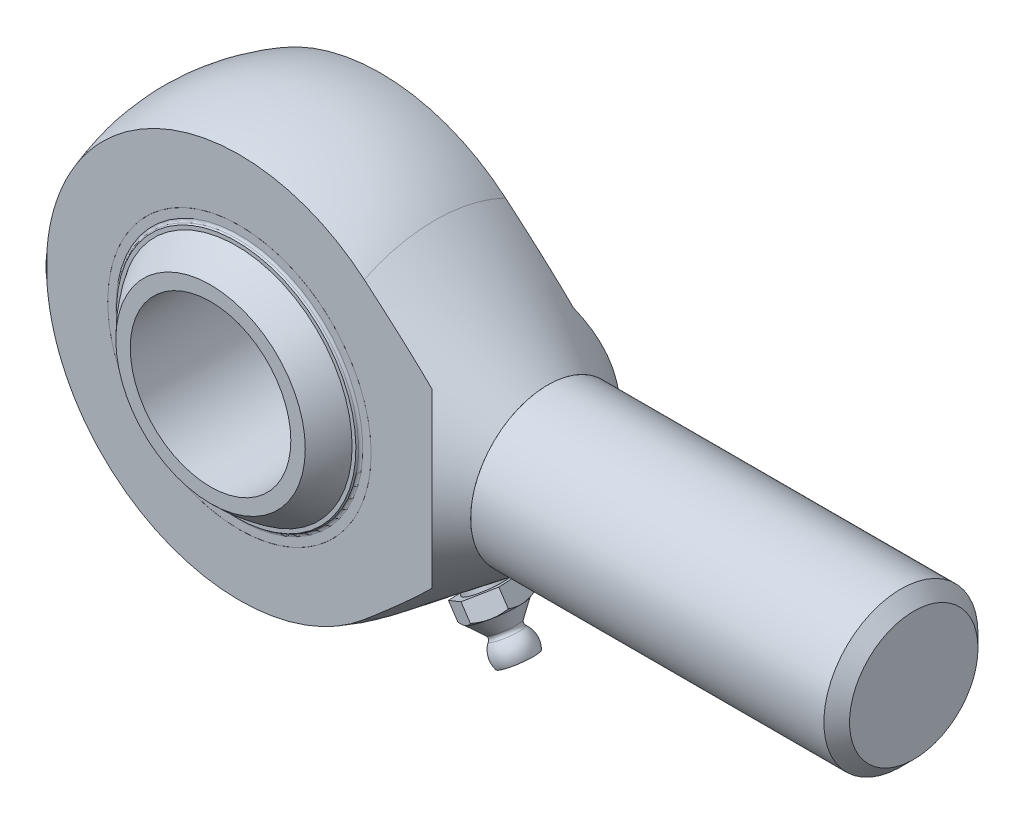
ISO-10303-21;
HEADER;
FILE_DESCRIPTION(('STEP AP214'),'2;1');
FILE_NAME('part.step','',(''),(''),'','','');
FILE_SCHEMA(('AUTOMOTIVE_DESIGN { 1 0 10303 214 1 1 1 1 }'));
ENDSEC;
DATA;
#1=APPLICATION_CONTEXT('core data for automotive mechanical design processes');
#2=APPLICATION_PROTOCOL_DEFINITION('international standard','automotive_design',2000,#1);
#3=PRODUCT_CONTEXT('',#1,'mechanical');
#4=PRODUCT('Part','Part','',(#3));
#5=PRODUCT_RELATED_PRODUCT_CATEGORY('part','',(#4));
#6=PRODUCT_DEFINITION_FORMATION('','',#4);
#7=PRODUCT_DEFINITION_CONTEXT('part definition',#1,'design');
#8=PRODUCT_DEFINITION('design','',#6,#7);
#9=PRODUCT_DEFINITION_SHAPE('','',#8);
#10=(LENGTH_UNIT() NAMED_UNIT(*) SI_UNIT(.MILLI.,.METRE.));
#11=(NAMED_UNIT(*) PLANE_ANGLE_UNIT() SI_UNIT($,.RADIAN.));
#12=(NAMED_UNIT(*) SI_UNIT($,.STERADIAN.) SOLID_ANGLE_UNIT());
#13=UNCERTAINTY_MEASURE_WITH_UNIT(LENGTH_MEASURE(1.E-05),#10,'distance_accuracy_value','');
#14=(GEOMETRIC_REPRESENTATION_CONTEXT(3) GLOBAL_UNCERTAINTY_ASSIGNED_CONTEXT((#13)) GLOBAL_UNIT_ASSIGNED_CONTEXT((#10,
#11,#12)) REPRESENTATION_CONTEXT('',''));
#15=CARTESIAN_POINT('',(0.,0.,0.));
#16=DIRECTION('',(0.,0.,1.));
#17=DIRECTION('',(1.,0.,0.));
#18=AXIS2_PLACEMENT_3D('',#15,#16,#17);
#19=CARTESIAN_POINT('',(-6.95318463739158,-21.3997018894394,2.56366263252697));
#20=DIRECTION('',(0.307030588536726,0.944942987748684,-0.113203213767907));
#21=DIRECTION('',(0.0349817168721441,0.107662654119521,0.993571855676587));
#22=AXIS2_PLACEMENT_3D('',#19,#20,#21);
#23=SPHERICAL_SURFACE('',#22,2.5);
#24=CARTESIAN_POINT('',(-6.18560816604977,-19.0373444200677,2.2806545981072));
#25=VERTEX_POINT('',#24);
#26=VERTEX_LOOP('',#25);
#27=FACE_BOUND('',#26,.T.);
#28=ADVANCED_FACE('P0_F12',(#27),#23,.T.);
#29=CLOSED_SHELL('',(#28));
#30=MANIFOLD_SOLID_BREP('P0_B1',#29);
#31=CARTESIAN_POINT('',(0.,22.5009781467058,2.56366263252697));
#32=DIRECTION('',(0.,-0.993571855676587,-0.113203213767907));
#33=DIRECTION('',(0.,-0.113203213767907,0.993571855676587));
#34=AXIS2_PLACEMENT_3D('',#31,#32,#33);
#35=SPHERICAL_SURFACE('',#34,2.5);
#36=CARTESIAN_POINT('',(0.,20.0170485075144,2.2806545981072));
#37=VERTEX_POINT('',#36);
#38=VERTEX_LOOP('',#37);
#39=FACE_BOUND('',#38,.T.);
#40=ADVANCED_FACE('P1_F12',(#39),#35,.T.);
#41=CLOSED_SHELL('',(#40));
#42=MANIFOLD_SOLID_BREP('P1_B1',#41);
#43=CARTESIAN_POINT('',(6.95318463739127,-21.3997018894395,-2.56366263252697));
#44=DIRECTION('',(-0.307030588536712,0.944942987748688,0.113203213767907));
#45=DIRECTION('',(-0.0349817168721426,0.107662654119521,-0.993571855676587));
#46=AXIS2_PLACEMENT_3D('',#43,#44,#45);
#47=SPHERICAL_SURFACE('',#46,2.5);
#48=CARTESIAN_POINT('',(6.18560816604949,-19.0373444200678,-2.2806545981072));
#49=VERTEX_POINT('',#48);
#50=VERTEX_LOOP('',#49);
#51=FACE_BOUND('',#50,.T.);
#52=ADVANCED_FACE('P2_F12',(#51),#47,.T.);
#53=CLOSED_SHELL('',(#52));
#54=MANIFOLD_SOLID_BREP('P2_B1',#53);
#55=CARTESIAN_POINT('',(0.,0.,0.));
#56=DIRECTION('',(0.,0.,1.));
#57=DIRECTION('',(0.999027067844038,0.044101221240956,0.));
#58=AXIS2_PLACEMENT_3D('',#55,#56,#57);
#59=CYLINDRICAL_SURFACE('',#58,20.51);
#60=CARTESIAN_POINT('',(0.,0.,-11.));
#61=DIRECTION('',(0.,0.,1.));
#62=DIRECTION('',(0.999027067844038,0.044101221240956,0.));
#63=AXIS2_PLACEMENT_3D('',#60,#61,#62);
#64=CIRCLE('',#63,20.51);
#65=CARTESIAN_POINT('',(20.4900451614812,0.904516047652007,-11.));
#66=VERTEX_POINT('',#65);
#67=EDGE_CURVE('P3_E34',#66,#66,#64,.T.);
#68=ORIENTED_EDGE('',*,*,#67,.T.);
#69=EDGE_LOOP('',(#68));
#70=FACE_BOUND('',#69,.T.);
#71=CARTESIAN_POINT('',(0.,0.,-10.5));
#72=DIRECTION('',(0.,0.,1.));
#73=DIRECTION('',(0.999027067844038,0.044101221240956,0.));
#74=AXIS2_PLACEMENT_3D('',#71,#72,#73);
#75=CIRCLE('',#74,20.51);
#76=CARTESIAN_POINT('',(20.4900451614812,0.904516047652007,-10.5));
#77=VERTEX_POINT('',#76);
#78=EDGE_CURVE('P3_E43',#77,#77,#75,.T.);
#79=ORIENTED_EDGE('',*,*,#78,.F.);
#80=EDGE_LOOP('',(#79));
#81=FACE_BOUND('',#80,.T.);
#82=ADVANCED_FACE('P3_F14',(#70,#81),#59,.T.);
#83=CARTESIAN_POINT('',(-0.904516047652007,20.4900451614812,-11.));
#84=DIRECTION('',(0.,0.,-1.));
#85=DIRECTION('',(-0.999027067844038,-0.044101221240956,0.));
#86=AXIS2_PLACEMENT_3D('',#83,#84,#85);
#87=PLANE('',#86);
#88=CARTESIAN_POINT('',(0.,0.,-11.));
#89=DIRECTION('',(0.,0.,-1.));
#90=DIRECTION('',(-0.999027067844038,-0.044101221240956,0.));
#91=AXIS2_PLACEMENT_3D('',#88,#89,#90);
#92=CIRCLE('',#91,19.2186265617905);
#93=CARTESIAN_POINT('',(-19.1999281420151,-0.847564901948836,-11.));
#94=VERTEX_POINT('',#93);
#95=EDGE_CURVE('P3_E21',#94,#94,#92,.F.);
#96=ORIENTED_EDGE('',*,*,#95,.T.);
#97=EDGE_LOOP('',(#96));
#98=FACE_BOUND('',#97,.T.);
#99=ORIENTED_EDGE('',*,*,#67,.F.);
#100=EDGE_LOOP('',(#99));
#101=FACE_BOUND('',#100,.T.);
#102=ADVANCED_FACE('P3_F50',(#98,#101),#87,.T.);
#103=CARTESIAN_POINT('',(0.,0.,0.));
#104=DIRECTION('',(0.,0.,1.));
#105=DIRECTION('',(-0.044101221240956,0.999027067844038,0.));
#106=AXIS2_PLACEMENT_3D('',#103,#104,#105);
#107=SPHERICAL_SURFACE('',#106,21.8965534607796);
#108=CARTESIAN_POINT('',(0.,0.,-11.2432640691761));
#109=DIRECTION('',(0.,0.,1.));
#110=DIRECTION('',(0.999027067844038,0.044101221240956,0.));
#111=AXIS2_PLACEMENT_3D('',#108,#109,#110);
#112=CIRCLE('',#111,18.789573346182);
#113=CARTESIAN_POINT('',(-0.828643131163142,18.7712923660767,-11.2432640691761));
#114=VERTEX_POINT('',#113);
#115=EDGE_CURVE('P3_E10',#114,#114,#112,.F.);
#116=CARTESIAN_POINT('',(0.,0.,-11.5));
#117=DIRECTION('',(0.,0.,1.));
#118=DIRECTION('',(0.999027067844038,0.044101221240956,0.));
#119=AXIS2_PLACEMENT_3D('',#116,#117,#118);
#120=CIRCLE('',#119,18.6335464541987);
#121=CARTESIAN_POINT('',(-0.821762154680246,18.6154172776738,-11.5));
#122=VERTEX_POINT('',#121);
#123=EDGE_CURVE('P3_E37',#122,#122,#120,.T.);
#124=CARTESIAN_POINT('',(-0.828643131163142,18.7712923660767,-11.2432640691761));
#125=CARTESIAN_POINT('',(-0.828572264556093,18.7696870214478,-11.2459495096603));
#126=CARTESIAN_POINT('',(-0.828501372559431,18.7680811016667,-11.2486346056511));
#127=CARTESIAN_POINT('',(-0.828359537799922,18.7648681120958,-11.2540041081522));
#128=CARTESIAN_POINT('',(-0.828288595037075,18.763261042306,-11.2566885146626));
#129=CARTESIAN_POINT('',(-0.828146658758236,18.7600457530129,-11.2620566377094));
#130=CARTESIAN_POINT('',(-0.828075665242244,18.7584375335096,-11.2647403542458));
#131=CARTESIAN_POINT('',(-0.827933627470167,18.7552199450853,-11.2701070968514));
#132=CARTESIAN_POINT('',(-0.827862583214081,18.7536105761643,-11.2727901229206));
#133=CARTESIAN_POINT('',(-0.827720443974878,18.7503906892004,-11.2781554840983));
#134=CARTESIAN_POINT('',(-0.82764934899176,18.7487801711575,-11.2808378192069));
#135=CARTESIAN_POINT('',(-0.827507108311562,18.7455579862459,-11.2862017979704));
#136=CARTESIAN_POINT('',(-0.827435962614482,18.7439463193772,-11.2888834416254));
#137=CARTESIAN_POINT('',(-0.827293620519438,18.7407218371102,-11.2942460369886));
#138=CARTESIAN_POINT('',(-0.827222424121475,18.739109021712,-11.2969269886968));
#139=CARTESIAN_POINT('',(-0.827079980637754,18.7358822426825,-11.3022881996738));
#140=CARTESIAN_POINT('',(-0.827008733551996,18.7342682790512,-11.3049684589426));
#141=CARTESIAN_POINT('',(-0.826866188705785,18.7310392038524,-11.3103282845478));
#142=CARTESIAN_POINT('',(-0.826794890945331,18.7294240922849,-11.3130078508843));
#143=CARTESIAN_POINT('',(-0.826652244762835,18.7261927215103,-11.3183662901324));
#144=CARTESIAN_POINT('',(-0.826580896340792,18.7245764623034,-11.321045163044));
#145=CARTESIAN_POINT('',(-0.826438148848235,18.7213427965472,-11.3264022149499));
#146=CARTESIAN_POINT('',(-0.82636674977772,18.719725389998,-11.3290803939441));
#147=CARTESIAN_POINT('',(-0.826223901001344,18.7164894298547,-11.3344360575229));
#148=CARTESIAN_POINT('',(-0.826152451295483,18.7148708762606,-11.3371135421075));
#149=CARTESIAN_POINT('',(-0.82600950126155,18.711632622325,-11.3424678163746));
#150=CARTESIAN_POINT('',(-0.825938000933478,18.7100129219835,-11.3451446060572));
#151=CARTESIAN_POINT('',(-0.825794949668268,18.7067723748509,-11.3504974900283));
#152=CARTESIAN_POINT('',(-0.82572339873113,18.7051515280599,-11.3531735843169));
#153=CARTESIAN_POINT('',(-0.825580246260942,18.7019086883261,-11.358525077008));
#154=CARTESIAN_POINT('',(-0.825508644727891,18.7002866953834,-11.3612004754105));
#155=CARTESIAN_POINT('',(-0.825365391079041,18.6970415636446,-11.3665505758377));
#156=CARTESIAN_POINT('',(-0.825293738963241,18.6954184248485,-11.3692252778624));
#157=CARTESIAN_POINT('',(-0.825150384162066,18.6921710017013,-11.3745739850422));
#158=CARTESIAN_POINT('',(-0.82507868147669,18.6905467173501,-11.3772479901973));
#159=CARTESIAN_POINT('',(-0.824935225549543,18.6872970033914,-11.3825953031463));
#160=CARTESIAN_POINT('',(-0.824863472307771,18.6856715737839,-11.3852686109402));
#161=CARTESIAN_POINT('',(-0.824719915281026,18.6824195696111,-11.3906145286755));
#162=CARTESIAN_POINT('',(-0.824648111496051,18.680792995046,-11.3932871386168));
#163=CARTESIAN_POINT('',(-0.824504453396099,18.6775387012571,-11.3986316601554));
#164=CARTESIAN_POINT('',(-0.824432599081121,18.6759109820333,-11.4013035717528));
#165=CARTESIAN_POINT('',(-0.824288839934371,18.6726543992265,-11.4066466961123));
#166=CARTESIAN_POINT('',(-0.8242169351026,18.6710255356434,-11.4093179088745));
#167=CARTESIAN_POINT('',(-0.824073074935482,18.6677666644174,-11.4146596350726));
#168=CARTESIAN_POINT('',(-0.824001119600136,18.6661366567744,-11.4173301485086));
#169=CARTESIAN_POINT('',(-0.823857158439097,18.6628754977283,-11.4226704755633));
#170=CARTESIAN_POINT('',(-0.823785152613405,18.6612443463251,-11.425340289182));
#171=CARTESIAN_POINT('',(-0.823641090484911,18.6579809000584,-11.4306792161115));
#172=CARTESIAN_POINT('',(-0.82356903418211,18.6563486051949,-11.4333483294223));
#173=CARTESIAN_POINT('',(-0.823424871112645,18.6530828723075,-11.4386858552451));
#174=CARTESIAN_POINT('',(-0.823352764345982,18.6514494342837,-11.4413542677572));
#175=CARTESIAN_POINT('',(-0.823208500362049,18.6481814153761,-11.446690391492));
#176=CARTESIAN_POINT('',(-0.82313634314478,18.6465468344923,-11.4493581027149));
#177=CARTESIAN_POINT('',(-0.822991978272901,18.6432765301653,-11.4546928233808));
#178=CARTESIAN_POINT('',(-0.822919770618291,18.641640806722,-11.4573598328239));
#179=CARTESIAN_POINT('',(-0.822775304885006,18.6383682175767,-11.4626931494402));
#180=CARTESIAN_POINT('',(-0.82270304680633,18.6367313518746,-11.4653594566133));
#181=CARTESIAN_POINT('',(-0.822558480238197,18.6334564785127,-11.4706913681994));
#182=CARTESIAN_POINT('',(-0.82248617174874,18.6318184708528,-11.4733569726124));
#183=CARTESIAN_POINT('',(-0.822341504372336,18.6285413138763,-11.4786874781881));
#184=CARTESIAN_POINT('',(-0.822269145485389,18.6269021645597,-11.4813523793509));
#185=CARTESIAN_POINT('',(-0.82212437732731,18.6236227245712,-11.4866814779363));
#186=CARTESIAN_POINT('',(-0.822051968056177,18.6219824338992,-11.4893456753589));
#187=CARTESIAN_POINT('',(-0.821907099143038,18.6187007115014,-11.4946733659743));
#188=CARTESIAN_POINT('',(-0.821834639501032,18.6170592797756,-11.4973368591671));
#189=CARTESIAN_POINT('',(-0.821762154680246,18.6154172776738,-11.5));
#190=B_SPLINE_CURVE_WITH_KNOTS('',3,(#124,#125,#126,#127,#128,#129,#130,#131,#132,#133,#134,
#135,#136,#137,#138,#139,#140,#141,#142,#143,#144,#145,#146,#147,#148,#149,#150,#151,#152,#153,
#154,#155,#156,#157,#158,#159,#160,#161,#162,#163,#164,#165,#166,#167,#168,#169,#170,#171,#172,
#173,#174,#175,#176,#177,#178,#179,#180,#181,#182,#183,#184,#185,#186,#187,#188,#189),
.UNSPECIFIED.,.F.,.F.,(4,2,2,2,2,2,2,2,2,2,2,2,2,2,2,2,2,2,2,2,2,2,2,2,2,2,2,2,2,2,2,2,4),(0.,
0.0093884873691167,0.0187769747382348,0.0281654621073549,0.0375539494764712,0.0469424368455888,
0.0563309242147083,0.0657194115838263,0.0751078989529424,0.0844963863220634,0.0938848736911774,
0.103273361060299,0.112661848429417,0.122050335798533,0.131438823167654,0.140827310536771,
0.150215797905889,0.159604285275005,0.168992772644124,0.178381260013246,0.187769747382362,
0.197158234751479,0.206546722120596,0.215935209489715,0.225323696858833,0.23471218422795,
0.244100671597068,0.253489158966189,0.262877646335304,0.272266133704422,0.281654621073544,
0.29104310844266,0.300431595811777),.UNSPECIFIED.);
#191=EDGE_CURVE('P3_BSEAM57',#114,#122,#190,.T.);
#192=ORIENTED_EDGE('',*,*,#115,.T.);
#193=ORIENTED_EDGE('',*,*,#123,.T.);
#194=ORIENTED_EDGE('',*,*,#191,.T.);
#195=ORIENTED_EDGE('',*,*,#191,.F.);
#196=EDGE_LOOP('',(#192,#194,#193,#195));
#197=FACE_BOUND('',#196,.T.);
#198=ADVANCED_FACE('P3_F57',(#197),#107,.T.);
#199=CARTESIAN_POINT('',(-0.795733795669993,18.0257956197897,-11.5));
#200=DIRECTION('',(0.,0.,-1.));
#201=DIRECTION('',(-0.999027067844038,-0.044101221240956,0.));
#202=AXIS2_PLACEMENT_3D('',#199,#200,#201);
#203=PLANE('',#202);
#204=CARTESIAN_POINT('',(0.,0.,-11.5));
#205=DIRECTION('',(0.,0.,1.));
#206=DIRECTION('',(0.999027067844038,0.044101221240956,0.));
#207=AXIS2_PLACEMENT_3D('',#204,#205,#206);
#208=CIRCLE('',#207,18.0433505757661);
#209=CARTESIAN_POINT('',(-0.795733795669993,18.0257956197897,-11.5));
#210=VERTEX_POINT('',#209);
#211=EDGE_CURVE('P3_E40',#210,#210,#208,.T.);
#212=ORIENTED_EDGE('',*,*,#211,.T.);
#213=EDGE_LOOP('',(#212));
#214=FACE_BOUND('',#213,.T.);
#215=ORIENTED_EDGE('',*,*,#123,.F.);
#216=EDGE_LOOP('',(#215));
#217=FACE_BOUND('',#216,.T.);
#218=ADVANCED_FACE('P3_F77',(#214,#217),#203,.T.);
#219=CARTESIAN_POINT('',(0.,0.,0.));
#220=DIRECTION('',(0.,0.,1.));
#221=DIRECTION('',(-0.044101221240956,0.999027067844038,0.));
#222=AXIS2_PLACEMENT_3D('',#219,#220,#221);
#223=SPHERICAL_SURFACE('',#222,21.3965534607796);
#224=CARTESIAN_POINT('',(0.,0.,-10.7488189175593));
#225=DIRECTION('',(0.,0.,1.));
#226=DIRECTION('',(0.999027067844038,0.044101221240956,0.));
#227=AXIS2_PLACEMENT_3D('',#224,#225,#226);
#228=CIRCLE('',#227,18.5006862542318);
#229=CARTESIAN_POINT('',(-0.815902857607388,18.4826863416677,-10.7488189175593));
#230=VERTEX_POINT('',#229);
#231=EDGE_CURVE('P3_E29',#230,#230,#228,.T.);
#232=CARTESIAN_POINT('',(-0.815902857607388,18.4826863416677,-10.7488189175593));
#233=CARTESIAN_POINT('',(-0.815699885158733,18.478088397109,-10.7567405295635));
#234=CARTESIAN_POINT('',(-0.815496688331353,18.4734853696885,-10.7646591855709));
#235=CARTESIAN_POINT('',(-0.815089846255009,18.4642691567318,-10.7804905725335));
#236=CARTESIAN_POINT('',(-0.814886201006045,18.4596559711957,-10.7884033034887));
#237=CARTESIAN_POINT('',(-0.814478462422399,18.4504194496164,-10.8042228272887));
#238=CARTESIAN_POINT('',(-0.814274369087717,18.4457961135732,-10.8121296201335));
#239=CARTESIAN_POINT('',(-0.813865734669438,18.4365392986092,-10.8279372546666));
#240=CARTESIAN_POINT('',(-0.813661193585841,18.4319058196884,-10.8358380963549));
#241=CARTESIAN_POINT('',(-0.813251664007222,18.4226287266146,-10.8516338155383));
#242=CARTESIAN_POINT('',(-0.813046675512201,18.4179851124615,-10.8595286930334));
#243=CARTESIAN_POINT('',(-0.812636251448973,18.4086877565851,-10.8753124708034));
#244=CARTESIAN_POINT('',(-0.812430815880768,18.4040340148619,-10.8832013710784));
#245=CARTESIAN_POINT('',(-0.812019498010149,18.3947164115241,-10.8989731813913));
#246=CARTESIAN_POINT('',(-0.811813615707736,18.3900525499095,-10.9068560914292));
#247=CARTESIAN_POINT('',(-0.811401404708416,18.3807147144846,-10.9226159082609));
#248=CARTESIAN_POINT('',(-0.811195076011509,18.3760407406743,-10.9304928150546));
#249=CARTESIAN_POINT('',(-0.810781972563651,18.3666826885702,-10.9462406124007));
#250=CARTESIAN_POINT('',(-0.8105751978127,18.3619986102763,-10.9541115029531));
#251=CARTESIAN_POINT('',(-0.81016120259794,18.352620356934,-10.9698472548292));
#252=CARTESIAN_POINT('',(-0.809953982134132,18.3479261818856,-10.977712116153));
#253=CARTESIAN_POINT('',(-0.809539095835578,18.3385277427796,-10.9934357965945));
#254=CARTESIAN_POINT('',(-0.809331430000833,18.3338234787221,-11.0012946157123));
#255=CARTESIAN_POINT('',(-0.808915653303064,18.3244048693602,-11.0170061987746));
#256=CARTESIAN_POINT('',(-0.80870754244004,18.3196905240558,-11.0248589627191));
#257=CARTESIAN_POINT('',(-0.808290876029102,18.3102517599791,-11.0405584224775));
#258=CARTESIAN_POINT('',(-0.808082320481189,18.3055273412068,-11.0484051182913));
#259=CARTESIAN_POINT('',(-0.807664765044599,18.2960684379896,-11.064092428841));
#260=CARTESIAN_POINT('',(-0.807455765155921,18.2913339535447,-11.0719330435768));
#261=CARTESIAN_POINT('',(-0.80703732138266,18.2818549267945,-11.0876081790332));
#262=CARTESIAN_POINT('',(-0.806827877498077,18.2771103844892,-11.0954426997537));
#263=CARTESIAN_POINT('',(-0.806408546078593,18.2676112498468,-11.1111056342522));
#264=CARTESIAN_POINT('',(-0.806198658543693,18.2628566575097,-11.1189340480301));
#265=CARTESIAN_POINT('',(-0.805778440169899,18.253337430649,-11.1345847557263));
#266=CARTESIAN_POINT('',(-0.805568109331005,18.2485727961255,-11.1424070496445));
#267=CARTESIAN_POINT('',(-0.805147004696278,18.2390334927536,-11.1580455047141));
#268=CARTESIAN_POINT('',(-0.804936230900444,18.2342588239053,-11.1658616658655));
#269=CARTESIAN_POINT('',(-0.804514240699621,18.2246994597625,-11.1814878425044));
#270=CARTESIAN_POINT('',(-0.804303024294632,18.2199147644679,-11.189297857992));
#271=CARTESIAN_POINT('',(-0.803880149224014,18.2103353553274,-11.2049117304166));
#272=CARTESIAN_POINT('',(-0.803668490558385,18.2055406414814,-11.2127155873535));
#273=CARTESIAN_POINT('',(-0.803244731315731,18.1959412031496,-11.2283171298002));
#274=CARTESIAN_POINT('',(-0.803032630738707,18.1911364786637,-11.2361148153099));
#275=CARTESIAN_POINT('',(-0.802607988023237,18.1815170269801,-11.2517040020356));
#276=CARTESIAN_POINT('',(-0.802395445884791,18.1767022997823,-11.2594955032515));
#277=CARTESIAN_POINT('',(-0.80196992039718,18.1670628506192,-11.2750723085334));
#278=CARTESIAN_POINT('',(-0.801756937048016,18.162238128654,-11.2828576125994));
#279=CARTESIAN_POINT('',(-0.801330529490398,18.152578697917,-11.2984220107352));
#280=CARTESIAN_POINT('',(-0.801117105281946,18.1477439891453,-11.306201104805));
#281=CARTESIAN_POINT('',(-0.80068981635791,18.1380645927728,-11.3217530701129));
#282=CARTESIAN_POINT('',(-0.800475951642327,18.1332199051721,-11.3295259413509));
#283=CARTESIAN_POINT('',(-0.800047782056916,18.1235205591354,-11.3450654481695));
#284=CARTESIAN_POINT('',(-0.799833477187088,18.1186659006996,-11.3528320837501));
#285=CARTESIAN_POINT('',(-0.799404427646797,18.1089466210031,-11.3683591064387));
#286=CARTESIAN_POINT('',(-0.799189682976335,18.1040819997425,-11.3761194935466));
#287=CARTESIAN_POINT('',(-0.798759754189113,18.0943428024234,-11.391634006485));
#288=CARTESIAN_POINT('',(-0.798544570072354,18.0894682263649,-11.3993881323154));
#289=CARTESIAN_POINT('',(-0.798113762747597,18.0797091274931,-11.414890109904));
#290=CARTESIAN_POINT('',(-0.797898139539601,18.0748246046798,-11.4226379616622));
#291=CARTESIAN_POINT('',(-0.797466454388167,18.0650456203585,-11.4381273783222));
#292=CARTESIAN_POINT('',(-0.797250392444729,18.0601511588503,-11.4458689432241));
#293=CARTESIAN_POINT('',(-0.796817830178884,18.0503523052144,-11.4613457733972));
#294=CARTESIAN_POINT('',(-0.796601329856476,18.0454479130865,-11.4690810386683));
#295=CARTESIAN_POINT('',(-0.796167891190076,18.035629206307,-11.4845452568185));
#296=CARTESIAN_POINT('',(-0.795950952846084,18.0307148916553,-11.4922742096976));
#297=CARTESIAN_POINT('',(-0.795733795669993,18.0257956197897,-11.5));
#298=B_SPLINE_CURVE_WITH_KNOTS('',3,(#232,#233,#234,#235,#236,#237,#238,#239,#240,#241,#242,
#243,#244,#245,#246,#247,#248,#249,#250,#251,#252,#253,#254,#255,#256,#257,#258,#259,#260,#261,
#262,#263,#264,#265,#266,#267,#268,#269,#270,#271,#272,#273,#274,#275,#276,#277,#278,#279,#280,
#281,#282,#283,#284,#285,#286,#287,#288,#289,#290,#291,#292,#293,#294,#295,#296,#297),
.UNSPECIFIED.,.F.,.F.,(4,2,2,2,2,2,2,2,2,2,2,2,2,2,2,2,2,2,2,2,2,2,2,2,2,2,2,2,2,2,2,2,4),(0.,
0.0274846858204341,0.0549693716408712,0.0824540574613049,0.10993874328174,0.137423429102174,
0.16490811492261,0.192392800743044,0.219877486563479,0.247362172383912,0.274846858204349,
0.302331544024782,0.329816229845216,0.357300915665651,0.384785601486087,0.41227028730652,
0.439754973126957,0.467239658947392,0.494724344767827,0.522209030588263,0.549693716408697,
0.577178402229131,0.604663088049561,0.63214777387,0.659632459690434,0.68711714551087,
0.714601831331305,0.74208651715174,0.769571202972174,0.797055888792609,0.824540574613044,
0.852025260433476,0.879509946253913),.UNSPECIFIED.);
#299=EDGE_CURVE('P3_BSEAM68',#230,#210,#298,.T.);
#300=ORIENTED_EDGE('',*,*,#231,.T.);
#301=ORIENTED_EDGE('',*,*,#211,.F.);
#302=ORIENTED_EDGE('',*,*,#299,.T.);
#303=ORIENTED_EDGE('',*,*,#299,.F.);
#304=EDGE_LOOP('',(#300,#302,#301,#303));
#305=FACE_BOUND('',#304,.T.);
#306=ADVANCED_FACE('P3_F68',(#305),#223,.F.);
#307=CARTESIAN_POINT('',(-0.904516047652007,20.4900451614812,-10.5));
#308=DIRECTION('',(0.,0.,1.));
#309=DIRECTION('',(0.999027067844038,0.044101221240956,0.));
#310=AXIS2_PLACEMENT_3D('',#307,#308,#309);
#311=PLANE('',#310);
#312=CARTESIAN_POINT('',(0.,0.,-10.5));
#313=DIRECTION('',(0.,0.,1.));
#314=DIRECTION('',(0.999027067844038,0.044101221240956,0.));
#315=AXIS2_PLACEMENT_3D('',#312,#313,#314);
#316=CIRCLE('',#315,18.9330149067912);
#317=CARTESIAN_POINT('',(18.9145943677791,0.834969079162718,-10.5));
#318=VERTEX_POINT('',#317);
#319=EDGE_CURVE('P3_E25',#318,#318,#316,.F.);
#320=ORIENTED_EDGE('',*,*,#319,.T.);
#321=EDGE_LOOP('',(#320));
#322=FACE_BOUND('',#321,.T.);
#323=ORIENTED_EDGE('',*,*,#78,.T.);
#324=EDGE_LOOP('',(#323));
#325=FACE_BOUND('',#324,.T.);
#326=ADVANCED_FACE('P3_F47',(#322,#325),#311,.T.);
#327=CARTESIAN_POINT('',(0.,0.,-11.));
#328=DIRECTION('',(0.,0.,1.));
#329=DIRECTION('',(0.999027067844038,0.044101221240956,0.));
#330=AXIS2_PLACEMENT_3D('',#327,#328,#329);
#331=TOROIDAL_SURFACE('',#330,18.9330149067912,0.5);
#332=ORIENTED_EDGE('',*,*,#319,.F.);
#333=EDGE_LOOP('',(#332));
#334=FACE_BOUND('',#333,.T.);
#335=ORIENTED_EDGE('',*,*,#231,.F.);
#336=EDGE_LOOP('',(#335));
#337=FACE_BOUND('',#336,.T.);
#338=ADVANCED_FACE('P3_F60',(#334,#337),#331,.T.);
#339=CARTESIAN_POINT('',(0.,0.,-11.5));
#340=DIRECTION('',(0.,0.,-1.));
#341=DIRECTION('',(-0.999027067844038,-0.044101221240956,0.));
#342=AXIS2_PLACEMENT_3D('',#339,#340,#341);
#343=TOROIDAL_SURFACE('',#342,19.2186265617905,0.5);
#344=ORIENTED_EDGE('',*,*,#115,.F.);
#345=EDGE_LOOP('',(#344));
#346=FACE_BOUND('',#345,.T.);
#347=ORIENTED_EDGE('',*,*,#95,.F.);
#348=EDGE_LOOP('',(#347));
#349=FACE_BOUND('',#348,.T.);
#350=ADVANCED_FACE('P3_F16',(#346,#349),#343,.F.);
#351=CLOSED_SHELL('',(#82,#102,#198,#218,#306,#326,#338,#350));
#352=MANIFOLD_SOLID_BREP('P3_B1',#351);
#353=CARTESIAN_POINT('',(-13.2257431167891,-18.2036737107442,2.56366263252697));
#354=DIRECTION('',(0.584006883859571,0.803816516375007,-0.113203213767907));
#355=DIRECTION('',(0.0665391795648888,0.0915833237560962,0.993571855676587));
#356=AXIS2_PLACEMENT_3D('',#353,#354,#355);
#357=SPHERICAL_SURFACE('',#356,2.5);
#358=CARTESIAN_POINT('',(-11.7657259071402,-16.1941324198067,2.2806545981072));
#359=VERTEX_POINT('',#358);
#360=VERTEX_LOOP('',#359);
#361=FACE_BOUND('',#360,.T.);
#362=ADVANCED_FACE('P4_F12',(#361),#357,.T.);
#363=CLOSED_SHELL('',(#362));
#364=MANIFOLD_SOLID_BREP('P4_B1',#363);
#365=CARTESIAN_POINT('',(6.95318463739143,21.3997018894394,2.56366263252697));
#366=DIRECTION('',(-0.307030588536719,-0.944942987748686,-0.113203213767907));
#367=DIRECTION('',(-0.0349817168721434,-0.107662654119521,0.993571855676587));
#368=AXIS2_PLACEMENT_3D('',#365,#366,#367);
#369=SPHERICAL_SURFACE('',#368,2.5);
#370=CARTESIAN_POINT('',(6.18560816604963,19.0373444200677,2.2806545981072));
#371=VERTEX_POINT('',#370);
#372=VERTEX_LOOP('',#371);
#373=FACE_BOUND('',#372,.T.);
#374=ADVANCED_FACE('P5_F12',(#373),#369,.T.);
#375=CLOSED_SHELL('',(#374));
#376=MANIFOLD_SOLID_BREP('P5_B1',#375);
#377=CARTESIAN_POINT('',(-1.57123581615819E-13,-22.5009781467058,-2.56366263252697));
#378=DIRECTION('',(0.,0.993571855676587,0.113203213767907));
#379=DIRECTION('',(0.,0.113203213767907,-0.993571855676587));
#380=AXIS2_PLACEMENT_3D('',#377,#378,#379);
#381=SPHERICAL_SURFACE('',#380,2.5);
#382=CARTESIAN_POINT('',(-1.39778383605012E-13,-20.0170485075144,-2.2806545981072));
#383=VERTEX_POINT('',#382);
#384=VERTEX_LOOP('',#383);
#385=FACE_BOUND('',#384,.T.);
#386=ADVANCED_FACE('P6_F12',(#385),#381,.T.);
#387=CLOSED_SHELL('',(#386));
#388=MANIFOLD_SOLID_BREP('P6_B1',#387);
#389=CARTESIAN_POINT('',(-18.2036737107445,-13.2257431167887,2.56366263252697));
#390=DIRECTION('',(0.803816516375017,0.584006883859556,-0.113203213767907));
#391=DIRECTION('',(0.0915833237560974,0.0665391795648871,0.993571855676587));
#392=AXIS2_PLACEMENT_3D('',#389,#390,#391);
#393=SPHERICAL_SURFACE('',#392,2.5);
#394=CARTESIAN_POINT('',(-16.1941324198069,-11.7657259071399,2.2806545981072));
#395=VERTEX_POINT('',#394);
#396=VERTEX_LOOP('',#395);
#397=FACE_BOUND('',#396,.T.);
#398=ADVANCED_FACE('P7_F12',(#397),#393,.T.);
#399=CLOSED_SHELL('',(#398));
#400=MANIFOLD_SOLID_BREP('P7_B1',#399);
#401=CARTESIAN_POINT('',(13.2257431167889,18.2036737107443,2.56366263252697));
#402=DIRECTION('',(-0.584006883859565,-0.803816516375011,-0.113203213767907));
#403=DIRECTION('',(-0.0665391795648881,-0.0915833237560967,0.993571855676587));
#404=AXIS2_PLACEMENT_3D('',#401,#402,#403);
#405=SPHERICAL_SURFACE('',#404,2.5);
#406=CARTESIAN_POINT('',(11.76572590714,16.1941324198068,2.2806545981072));
#407=VERTEX_POINT('',#406);
#408=VERTEX_LOOP('',#407);
#409=FACE_BOUND('',#408,.T.);
#410=ADVANCED_FACE('P8_F12',(#409),#405,.T.);
#411=CLOSED_SHELL('',(#410));
#412=MANIFOLD_SOLID_BREP('P8_B1',#411);
#413=CARTESIAN_POINT('',(-6.95318463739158,-21.3997018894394,-2.56366263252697));
#414=DIRECTION('',(0.307030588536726,0.944942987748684,0.113203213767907));
#415=DIRECTION('',(0.0349817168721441,0.107662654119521,-0.993571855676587));
#416=AXIS2_PLACEMENT_3D('',#413,#414,#415);
#417=SPHERICAL_SURFACE('',#416,2.5);
#418=CARTESIAN_POINT('',(-6.18560816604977,-19.0373444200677,-2.2806545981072));
#419=VERTEX_POINT('',#418);
#420=VERTEX_LOOP('',#419);
#421=FACE_BOUND('',#420,.T.);
#422=ADVANCED_FACE('P9_F12',(#421),#417,.T.);
#423=CLOSED_SHELL('',(#422));
#424=MANIFOLD_SOLID_BREP('P9_B1',#423);
#425=CARTESIAN_POINT('',(0.,0.,0.));
#426=DIRECTION('',(0.,1.,0.));
#427=DIRECTION('',(1.,0.,0.));
#428=AXIS2_PLACEMENT_3D('',#425,#426,#427);
#429=SPHERICAL_SURFACE('',#428,21.3965534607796);
#430=CARTESIAN_POINT('',(0.,0.,0.));
#431=DIRECTION('',(0.,0.,1.));
#432=DIRECTION('',(1.,0.,0.));
#433=AXIS2_PLACEMENT_3D('',#430,#431,#432);
#434=SPHERICAL_SURFACE('',#433,21.3965534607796);
#435=CARTESIAN_POINT('',(0.,0.,4.49884915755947));
#436=DIRECTION('',(0.,0.,1.));
#437=DIRECTION('',(1.,0.,0.));
#438=AXIS2_PLACEMENT_3D('',#435,#436,#437);
#439=CIRCLE('',#438,20.9182421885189);
#440=CARTESIAN_POINT('',(20.9182421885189,0.,4.49884915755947));
#441=VERTEX_POINT('',#440);
#442=EDGE_CURVE('P10_E18',#441,#441,#439,.F.);
#443=ORIENTED_EDGE('',*,*,#442,.F.);
#444=EDGE_LOOP('',(#443));
#445=FACE_BOUND('',#444,.T.);
#446=CARTESIAN_POINT('',(0.,0.,15.5));
#447=DIRECTION('',(0.,0.,-1.));
#448=DIRECTION('',(-1.,0.,0.));
#449=AXIS2_PLACEMENT_3D('',#446,#447,#448);
#450=CIRCLE('',#449,14.75);
#451=CARTESIAN_POINT('',(-14.75,0.,15.5));
#452=VERTEX_POINT('',#451);
#453=EDGE_CURVE('P10_E27',#452,#452,#450,.F.);
#454=ORIENTED_EDGE('',*,*,#453,.F.);
#455=EDGE_LOOP('',(#454));
#456=FACE_BOUND('',#455,.T.);
#457=ADVANCED_FACE('P10_F14',(#445,#456),#434,.T.);
#458=CARTESIAN_POINT('',(0.,0.,0.));
#459=DIRECTION('',(0.,0.,-1.));
#460=DIRECTION('',(-1.,0.,0.));
#461=AXIS2_PLACEMENT_3D('',#458,#459,#460);
#462=SPHERICAL_SURFACE('',#461,21.3965534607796);
#463=CARTESIAN_POINT('',(0.,0.,-4.49884915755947));
#464=DIRECTION('',(0.,0.,-1.));
#465=DIRECTION('',(-1.,0.,0.));
#466=AXIS2_PLACEMENT_3D('',#463,#464,#465);
#467=CIRCLE('',#466,20.9182421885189);
#468=CARTESIAN_POINT('',(-20.9182421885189,0.,-4.49884915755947));
#469=VERTEX_POINT('',#468);
#470=EDGE_CURVE('P10_E34',#469,#469,#467,.F.);
#471=ORIENTED_EDGE('',*,*,#470,.F.);
#472=EDGE_LOOP('',(#471));
#473=FACE_BOUND('',#472,.T.);
#474=CARTESIAN_POINT('',(0.,0.,-15.5));
#475=DIRECTION('',(0.,0.,1.));
#476=DIRECTION('',(1.,0.,0.));
#477=AXIS2_PLACEMENT_3D('',#474,#475,#476);
#478=CIRCLE('',#477,14.75);
#479=CARTESIAN_POINT('',(14.75,0.,-15.5));
#480=VERTEX_POINT('',#479);
#481=EDGE_CURVE('P10_E10',#480,#480,#478,.F.);
#482=ORIENTED_EDGE('',*,*,#481,.F.);
#483=EDGE_LOOP('',(#482));
#484=FACE_BOUND('',#483,.T.);
#485=ADVANCED_FACE('P10_F50',(#473,#484),#462,.T.);
#486=CARTESIAN_POINT('',(0.,0.,0.));
#487=DIRECTION('',(0.,0.,-1.));
#488=DIRECTION('',(-1.,0.,0.));
#489=AXIS2_PLACEMENT_3D('',#486,#487,#488);
#490=SPHERICAL_SURFACE('',#489,21.3965534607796);
#491=CARTESIAN_POINT('',(0.,0.,0.322036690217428));
#492=DIRECTION('',(0.,0.,-1.));
#493=DIRECTION('',(-1.,0.,0.));
#494=AXIS2_PLACEMENT_3D('',#491,#492,#493);
#495=CIRCLE('',#494,21.3941298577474);
#496=CARTESIAN_POINT('',(-21.3941298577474,0.,0.322036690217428));
#497=VERTEX_POINT('',#496);
#498=EDGE_CURVE('P10_E39',#497,#497,#495,.F.);
#499=ORIENTED_EDGE('',*,*,#498,.F.);
#500=EDGE_LOOP('',(#499));
#501=FACE_BOUND('',#500,.T.);
#502=CARTESIAN_POINT('',(0.,0.,-0.322036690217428));
#503=DIRECTION('',(0.,0.,1.));
#504=DIRECTION('',(1.,0.,0.));
#505=AXIS2_PLACEMENT_3D('',#502,#503,#504);
#506=CIRCLE('',#505,21.3941298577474);
#507=CARTESIAN_POINT('',(21.3941298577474,0.,-0.322036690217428));
#508=VERTEX_POINT('',#507);
#509=EDGE_CURVE('P10_E35',#508,#508,#506,.F.);
#510=ORIENTED_EDGE('',*,*,#509,.F.);
#511=EDGE_LOOP('',(#510));
#512=FACE_BOUND('',#511,.T.);
#513=ADVANCED_FACE('P10_F16',(#501,#512),#490,.T.);
#514=CARTESIAN_POINT('',(0.,0.,-21.3965534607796));
#515=DIRECTION('',(0.,0.,1.));
#516=DIRECTION('',(1.,0.,0.));
#517=AXIS2_PLACEMENT_3D('',#514,#515,#516);
#518=CYLINDRICAL_SURFACE('',#517,12.5);
#519=CARTESIAN_POINT('',(0.,0.,15.5));
#520=DIRECTION('',(0.,0.,-1.));
#521=DIRECTION('',(-1.,0.,0.));
#522=AXIS2_PLACEMENT_3D('',#519,#520,#521);
#523=CIRCLE('',#522,12.5);
#524=CARTESIAN_POINT('',(-12.5,0.,15.5));
#525=VERTEX_POINT('',#524);
#526=EDGE_CURVE('P10_E31',#525,#525,#523,.F.);
#527=ORIENTED_EDGE('',*,*,#526,.T.);
#528=EDGE_LOOP('',(#527));
#529=FACE_BOUND('',#528,.T.);
#530=CARTESIAN_POINT('',(0.,0.,-15.5));
#531=DIRECTION('',(0.,0.,1.));
#532=DIRECTION('',(1.,0.,0.));
#533=AXIS2_PLACEMENT_3D('',#530,#531,#532);
#534=CIRCLE('',#533,12.5);
#535=CARTESIAN_POINT('',(12.5,0.,-15.5));
#536=VERTEX_POINT('',#535);
#537=EDGE_CURVE('P10_E22',#536,#536,#534,.F.);
#538=ORIENTED_EDGE('',*,*,#537,.T.);
#539=EDGE_LOOP('',(#538));
#540=FACE_BOUND('',#539,.T.);
#541=ADVANCED_FACE('P10_F62',(#529,#540),#518,.F.);
#542=CARTESIAN_POINT('',(-21.3965534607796,-21.3965534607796,-15.5));
#543=DIRECTION('',(0.,0.,1.));
#544=DIRECTION('',(1.,0.,0.));
#545=AXIS2_PLACEMENT_3D('',#542,#543,#544);
#546=PLANE('',#545);
#547=ORIENTED_EDGE('',*,*,#481,.T.);
#548=EDGE_LOOP('',(#547));
#549=FACE_BOUND('',#548,.T.);
#550=ORIENTED_EDGE('',*,*,#537,.F.);
#551=EDGE_LOOP('',(#550));
#552=FACE_BOUND('',#551,.T.);
#553=ADVANCED_FACE('P10_F58',(#549,#552),#546,.F.);
#554=CARTESIAN_POINT('',(-21.3965534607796,-21.3965534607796,15.5));
#555=DIRECTION('',(0.,0.,-1.));
#556=DIRECTION('',(-1.,0.,0.));
#557=AXIS2_PLACEMENT_3D('',#554,#555,#556);
#558=PLANE('',#557);
#559=ORIENTED_EDGE('',*,*,#453,.T.);
#560=EDGE_LOOP('',(#559));
#561=FACE_BOUND('',#560,.T.);
#562=ORIENTED_EDGE('',*,*,#526,.F.);
#563=EDGE_LOOP('',(#562));
#564=FACE_BOUND('',#563,.T.);
#565=ADVANCED_FACE('P10_F54',(#561,#564),#558,.F.);
#566=CARTESIAN_POINT('',(0.,0.,-2.56366263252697));
#567=DIRECTION('',(0.,0.,-1.));
#568=DIRECTION('',(-1.,0.,0.));
#569=AXIS2_PLACEMENT_3D('',#566,#567,#568);
#570=TOROIDAL_SURFACE('',#569,22.5009781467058,2.5);
#571=ORIENTED_EDGE('',*,*,#470,.T.);
#572=EDGE_LOOP('',(#571));
#573=FACE_BOUND('',#572,.T.);
#574=ORIENTED_EDGE('',*,*,#509,.T.);
#575=EDGE_LOOP('',(#574));
#576=FACE_BOUND('',#575,.T.);
#577=ADVANCED_FACE('P10_F57',(#573,#576),#570,.F.);
#578=CARTESIAN_POINT('',(0.,0.,2.56366263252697));
#579=DIRECTION('',(0.,0.,-1.));
#580=DIRECTION('',(-1.,0.,0.));
#581=AXIS2_PLACEMENT_3D('',#578,#579,#580);
#582=TOROIDAL_SURFACE('',#581,22.5009781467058,2.5);
#583=ORIENTED_EDGE('',*,*,#442,.T.);
#584=EDGE_LOOP('',(#583));
#585=FACE_BOUND('',#584,.T.);
#586=ORIENTED_EDGE('',*,*,#498,.T.);
#587=EDGE_LOOP('',(#586));
#588=FACE_BOUND('',#587,.T.);
#589=ADVANCED_FACE('P10_F46',(#585,#588),#582,.F.);
#590=CLOSED_SHELL('',(#457,#485,#513,#541,#553,#565,#577,#589));
#591=MANIFOLD_SOLID_BREP('P10_B1',#590);
#592=CARTESIAN_POINT('',(-21.3997018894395,-6.95318463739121,2.56366263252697));
#593=DIRECTION('',(0.944942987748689,0.307030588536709,-0.113203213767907));
#594=DIRECTION('',(0.107662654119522,0.0349817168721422,0.993571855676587));
#595=AXIS2_PLACEMENT_3D('',#592,#593,#594);
#596=SPHERICAL_SURFACE('',#595,2.5);
#597=CARTESIAN_POINT('',(-19.0373444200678,-6.18560816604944,2.2806545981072));
#598=VERTEX_POINT('',#597);
#599=VERTEX_LOOP('',#598);
#600=FACE_BOUND('',#599,.T.);
#601=ADVANCED_FACE('P11_F12',(#600),#596,.T.);
#602=CLOSED_SHELL('',(#601));
#603=MANIFOLD_SOLID_BREP('P11_B1',#602);
#604=CARTESIAN_POINT('',(18.2036737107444,13.2257431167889,2.56366263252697));
#605=DIRECTION('',(-0.803816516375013,-0.584006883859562,-0.113203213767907));
#606=DIRECTION('',(-0.0915833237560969,-0.0665391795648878,0.993571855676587));
#607=AXIS2_PLACEMENT_3D('',#604,#605,#606);
#608=SPHERICAL_SURFACE('',#607,2.5);
#609=CARTESIAN_POINT('',(16.1941324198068,11.76572590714,2.2806545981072));
#610=VERTEX_POINT('',#609);
#611=VERTEX_LOOP('',#610);
#612=FACE_BOUND('',#611,.T.);
#613=ADVANCED_FACE('P12_F12',(#612),#608,.T.);
#614=CLOSED_SHELL('',(#613));
#615=MANIFOLD_SOLID_BREP('P12_B1',#614);
#616=CARTESIAN_POINT('',(-13.2257431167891,-18.2036737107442,-2.56366263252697));
#617=DIRECTION('',(0.584006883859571,0.803816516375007,0.113203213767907));
#618=DIRECTION('',(0.0665391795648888,0.0915833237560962,-0.993571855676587));
#619=AXIS2_PLACEMENT_3D('',#616,#617,#618);
#620=SPHERICAL_SURFACE('',#619,2.5);
#621=CARTESIAN_POINT('',(-11.7657259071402,-16.1941324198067,-2.2806545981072));
#622=VERTEX_POINT('',#621);
#623=VERTEX_LOOP('',#622);
#624=FACE_BOUND('',#623,.T.);
#625=ADVANCED_FACE('P13_F12',(#624),#620,.T.);
#626=CLOSED_SHELL('',(#625));
#627=MANIFOLD_SOLID_BREP('P13_B1',#626);
#628=CARTESIAN_POINT('',(0.,22.5009781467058,-2.56366263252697));
#629=DIRECTION('',(0.,-0.993571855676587,0.113203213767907));
#630=DIRECTION('',(0.,-0.113203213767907,-0.993571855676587));
#631=AXIS2_PLACEMENT_3D('',#628,#629,#630);
#632=SPHERICAL_SURFACE('',#631,2.5);
#633=CARTESIAN_POINT('',(0.,20.0170485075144,-2.2806545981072));
#634=VERTEX_POINT('',#633);
#635=VERTEX_LOOP('',#634);
#636=FACE_BOUND('',#635,.T.);
#637=ADVANCED_FACE('P14_F12',(#636),#632,.T.);
#638=CLOSED_SHELL('',(#637));
#639=MANIFOLD_SOLID_BREP('P14_B1',#638);
#640=CARTESIAN_POINT('',(-22.5009781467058,2.35685372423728E-13,2.56366263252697));
#641=DIRECTION('',(0.993571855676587,0.,-0.113203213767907));
#642=DIRECTION('',(0.113203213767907,0.,0.993571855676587));
#643=AXIS2_PLACEMENT_3D('',#640,#641,#642);
#644=SPHERICAL_SURFACE('',#643,2.5);
#645=CARTESIAN_POINT('',(-20.0170485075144,2.09667575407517E-13,2.2806545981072));
#646=VERTEX_POINT('',#645);
#647=VERTEX_LOOP('',#646);
#648=FACE_BOUND('',#647,.T.);
#649=ADVANCED_FACE('P15_F12',(#648),#644,.T.);
#650=CLOSED_SHELL('',(#649));
#651=MANIFOLD_SOLID_BREP('P15_B1',#650);
#652=CARTESIAN_POINT('',(21.3997018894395,6.95318463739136,2.56366263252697));
#653=DIRECTION('',(-0.944942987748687,-0.307030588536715,-0.113203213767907));
#654=DIRECTION('',(-0.107662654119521,-0.034981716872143,0.993571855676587));
#655=AXIS2_PLACEMENT_3D('',#652,#653,#654);
#656=SPHERICAL_SURFACE('',#655,2.5);
#657=CARTESIAN_POINT('',(19.0373444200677,6.18560816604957,2.2806545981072));
#658=VERTEX_POINT('',#657);
#659=VERTEX_LOOP('',#658);
#660=FACE_BOUND('',#659,.T.);
#661=ADVANCED_FACE('P16_F12',(#660),#656,.T.);
#662=CLOSED_SHELL('',(#661));
#663=MANIFOLD_SOLID_BREP('P16_B1',#662);
#664=CARTESIAN_POINT('',(-18.2036737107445,-13.2257431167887,-2.56366263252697));
#665=DIRECTION('',(0.803816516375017,0.584006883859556,0.113203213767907));
#666=DIRECTION('',(0.0915833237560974,0.0665391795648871,-0.993571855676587));
#667=AXIS2_PLACEMENT_3D('',#664,#665,#666);
#668=SPHERICAL_SURFACE('',#667,2.5);
#669=CARTESIAN_POINT('',(-16.1941324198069,-11.7657259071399,-2.2806545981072));
#670=VERTEX_POINT('',#669);
#671=VERTEX_LOOP('',#670);
#672=FACE_BOUND('',#671,.T.);
#673=ADVANCED_FACE('P17_F12',(#672),#668,.T.);
#674=CLOSED_SHELL('',(#673));
#675=MANIFOLD_SOLID_BREP('P17_B1',#674);
#676=CARTESIAN_POINT('',(6.95318463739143,21.3997018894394,-2.56366263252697));
#677=DIRECTION('',(-0.307030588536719,-0.944942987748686,0.113203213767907));
#678=DIRECTION('',(-0.0349817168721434,-0.107662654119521,-0.993571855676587));
#679=AXIS2_PLACEMENT_3D('',#676,#677,#678);
#680=SPHERICAL_SURFACE('',#679,2.5);
#681=CARTESIAN_POINT('',(6.18560816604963,19.0373444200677,-2.2806545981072));
#682=VERTEX_POINT('',#681);
#683=VERTEX_LOOP('',#682);
#684=FACE_BOUND('',#683,.T.);
#685=ADVANCED_FACE('P18_F12',(#684),#680,.T.);
#686=CLOSED_SHELL('',(#685));
#687=MANIFOLD_SOLID_BREP('P18_B1',#686);
#688=CARTESIAN_POINT('',(-21.3997018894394,6.95318463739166,2.56366263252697));
#689=DIRECTION('',(0.944942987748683,-0.307030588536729,-0.113203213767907));
#690=DIRECTION('',(0.107662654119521,-0.0349817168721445,0.993571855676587));
#691=AXIS2_PLACEMENT_3D('',#688,#689,#690);
#692=SPHERICAL_SURFACE('',#691,2.5);
#693=CARTESIAN_POINT('',(-19.0373444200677,6.18560816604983,2.2806545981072));
#694=VERTEX_POINT('',#693);
#695=VERTEX_LOOP('',#694);
#696=FACE_BOUND('',#695,.T.);
#697=ADVANCED_FACE('P19_F12',(#696),#692,.T.);
#698=CLOSED_SHELL('',(#697));
#699=MANIFOLD_SOLID_BREP('P19_B1',#698);
#700=CARTESIAN_POINT('',(22.5009781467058,0.,2.56366263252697));
#701=DIRECTION('',(-0.993571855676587,0.,-0.113203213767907));
#702=DIRECTION('',(-0.113203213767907,0.,0.993571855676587));
#703=AXIS2_PLACEMENT_3D('',#700,#701,#702);
#704=SPHERICAL_SURFACE('',#703,2.5);
#705=CARTESIAN_POINT('',(20.0170485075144,0.,2.2806545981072));
#706=VERTEX_POINT('',#705);
#707=VERTEX_LOOP('',#706);
#708=FACE_BOUND('',#707,.T.);
#709=ADVANCED_FACE('P20_F12',(#708),#704,.T.);
#710=CLOSED_SHELL('',(#709));
#711=MANIFOLD_SOLID_BREP('P20_B1',#710);
#712=CARTESIAN_POINT('',(-21.3997018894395,-6.95318463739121,-2.56366263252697));
#713=DIRECTION('',(0.944942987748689,0.307030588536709,0.113203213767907));
#714=DIRECTION('',(0.107662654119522,0.0349817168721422,-0.993571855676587));
#715=AXIS2_PLACEMENT_3D('',#712,#713,#714);
#716=SPHERICAL_SURFACE('',#715,2.5);
#717=CARTESIAN_POINT('',(-19.0373444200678,-6.18560816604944,-2.2806545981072));
#718=VERTEX_POINT('',#717);
#719=VERTEX_LOOP('',#718);
#720=FACE_BOUND('',#719,.T.);
#721=ADVANCED_FACE('P21_F12',(#720),#716,.T.);
#722=CLOSED_SHELL('',(#721));
#723=MANIFOLD_SOLID_BREP('P21_B1',#722);
#724=CARTESIAN_POINT('',(13.2257431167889,18.2036737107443,-2.56366263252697));
#725=DIRECTION('',(-0.584006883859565,-0.803816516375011,0.113203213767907));
#726=DIRECTION('',(-0.0665391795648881,-0.0915833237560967,-0.993571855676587));
#727=AXIS2_PLACEMENT_3D('',#724,#725,#726);
#728=SPHERICAL_SURFACE('',#727,2.5);
#729=CARTESIAN_POINT('',(11.76572590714,16.1941324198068,-2.2806545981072));
#730=VERTEX_POINT('',#729);
#731=VERTEX_LOOP('',#730);
#732=FACE_BOUND('',#731,.T.);
#733=ADVANCED_FACE('P22_F12',(#732),#728,.T.);
#734=CLOSED_SHELL('',(#733));
#735=MANIFOLD_SOLID_BREP('P22_B1',#734);
#736=CARTESIAN_POINT('',(-18.2036737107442,13.2257431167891,2.56366263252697));
#737=DIRECTION('',(0.803816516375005,-0.584006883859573,-0.113203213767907));
#738=DIRECTION('',(0.091583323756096,-0.0665391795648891,0.993571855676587));
#739=AXIS2_PLACEMENT_3D('',#736,#737,#738);
#740=SPHERICAL_SURFACE('',#739,2.5);
#741=CARTESIAN_POINT('',(-16.1941324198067,11.7657259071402,2.2806545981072));
#742=VERTEX_POINT('',#741);
#743=VERTEX_LOOP('',#742);
#744=FACE_BOUND('',#743,.T.);
#745=ADVANCED_FACE('P23_F12',(#744),#740,.T.);
#746=CLOSED_SHELL('',(#745));
#747=MANIFOLD_SOLID_BREP('P23_B1',#746);
#748=CARTESIAN_POINT('',(21.3997018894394,-6.95318463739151,2.56366263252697));
#749=DIRECTION('',(-0.944942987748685,0.307030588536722,-0.113203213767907));
#750=DIRECTION('',(-0.107662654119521,0.0349817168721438,0.993571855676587));
#751=AXIS2_PLACEMENT_3D('',#748,#749,#750);
#752=SPHERICAL_SURFACE('',#751,2.5);
#753=CARTESIAN_POINT('',(19.0373444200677,-6.1856081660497,2.2806545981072));
#754=VERTEX_POINT('',#753);
#755=VERTEX_LOOP('',#754);
#756=FACE_BOUND('',#755,.T.);
#757=ADVANCED_FACE('P24_F12',(#756),#752,.T.);
#758=CLOSED_SHELL('',(#757));
#759=MANIFOLD_SOLID_BREP('P24_B1',#758);
#760=CARTESIAN_POINT('',(-22.5009781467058,2.35685372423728E-13,-2.56366263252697));
#761=DIRECTION('',(0.993571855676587,0.,0.113203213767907));
#762=DIRECTION('',(0.113203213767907,0.,-0.993571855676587));
#763=AXIS2_PLACEMENT_3D('',#760,#761,#762);
#764=SPHERICAL_SURFACE('',#763,2.5);
#765=CARTESIAN_POINT('',(-20.0170485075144,2.09667575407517E-13,-2.2806545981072));
#766=VERTEX_POINT('',#765);
#767=VERTEX_LOOP('',#766);
#768=FACE_BOUND('',#767,.T.);
#769=ADVANCED_FACE('P25_F12',(#768),#764,.T.);
#770=CLOSED_SHELL('',(#769));
#771=MANIFOLD_SOLID_BREP('P25_B1',#770);
#772=CARTESIAN_POINT('',(18.2036737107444,13.2257431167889,-2.56366263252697));
#773=DIRECTION('',(-0.803816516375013,-0.584006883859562,0.113203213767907));
#774=DIRECTION('',(-0.0915833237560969,-0.0665391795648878,-0.993571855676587));
#775=AXIS2_PLACEMENT_3D('',#772,#773,#774);
#776=SPHERICAL_SURFACE('',#775,2.5);
#777=CARTESIAN_POINT('',(16.1941324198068,11.76572590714,-2.2806545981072));
#778=VERTEX_POINT('',#777);
#779=VERTEX_LOOP('',#778);
#780=FACE_BOUND('',#779,.T.);
#781=ADVANCED_FACE('P26_F12',(#780),#776,.T.);
#782=CLOSED_SHELL('',(#781));
#783=MANIFOLD_SOLID_BREP('P26_B1',#782);
#784=CARTESIAN_POINT('',(27.4288304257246,-19.8567510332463,0.));
#785=DIRECTION('',(-0.559192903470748,0.829037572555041,0.));
#786=DIRECTION('',(0.291751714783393,0.196789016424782,-0.936031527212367));
#787=AXIS2_PLACEMENT_3D('',#784,#785,#786);
#788=CYLINDRICAL_SURFACE('',#787,3.);
#789=CARTESIAN_POINT('',(24.9683816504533,-16.2089857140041,0.));
#790=DIRECTION('',(0.559192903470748,-0.829037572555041,0.));
#791=DIRECTION('',(-0.291751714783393,-0.196789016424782,0.936031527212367));
#792=AXIS2_PLACEMENT_3D('',#789,#790,#791);
#793=CIRCLE('',#792,3.);
#794=CARTESIAN_POINT('',(24.0931265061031,-16.7993527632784,2.8080945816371));
#795=VERTEX_POINT('',#794);
#796=EDGE_CURVE('P27_E207',#795,#795,#793,.T.);
#797=ORIENTED_EDGE('',*,*,#796,.T.);
#798=EDGE_LOOP('',(#797));
#799=FACE_BOUND('',#798,.T.);
#800=CARTESIAN_POINT('',(27.4288304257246,-19.8567510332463,0.));
#801=DIRECTION('',(0.559192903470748,-0.829037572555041,0.));
#802=DIRECTION('',(-0.291751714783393,-0.196789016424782,0.936031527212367));
#803=AXIS2_PLACEMENT_3D('',#800,#801,#802);
#804=CIRCLE('',#803,3.);
#805=CARTESIAN_POINT('',(26.5535752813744,-20.4471180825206,2.8080945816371));
#806=VERTEX_POINT('',#805);
#807=EDGE_CURVE('P27_E337',#806,#806,#804,.T.);
#808=ORIENTED_EDGE('',*,*,#807,.F.);
#809=EDGE_LOOP('',(#808));
#810=FACE_BOUND('',#809,.T.);
#811=ADVANCED_FACE('P27_F16',(#799,#810),#788,.T.);
#812=CARTESIAN_POINT('',(24.6328659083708,-15.7115631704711,0.));
#813=DIRECTION('',(0.559192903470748,-0.829037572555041,0.));
#814=DIRECTION('',(-0.291751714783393,-0.196789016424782,0.936031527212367));
#815=AXIS2_PLACEMENT_3D('',#812,#813,#814);
#816=PLANE('',#815);
#817=CARTESIAN_POINT('',(24.6328659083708,-15.7115631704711,0.));
#818=DIRECTION('',(0.559192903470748,-0.829037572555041,0.));
#819=DIRECTION('',(-0.291751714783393,-0.196789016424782,0.936031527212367));
#820=AXIS2_PLACEMENT_3D('',#817,#818,#819);
#821=CIRCLE('',#820,2.4);
#822=CARTESIAN_POINT('',(23.9326617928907,-16.1838568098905,2.24647566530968));
#823=VERTEX_POINT('',#822);
#824=EDGE_CURVE('P27_E205',#823,#823,#821,.F.);
#825=ORIENTED_EDGE('',*,*,#824,.T.);
#826=EDGE_LOOP('',(#825));
#827=FACE_BOUND('',#826,.T.);
#828=CARTESIAN_POINT('',(24.6328659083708,-15.7115631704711,0.));
#829=DIRECTION('',(0.559192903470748,-0.829037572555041,0.));
#830=DIRECTION('',(-0.291751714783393,-0.196789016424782,0.936031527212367));
#831=AXIS2_PLACEMENT_3D('',#828,#829,#830);
#832=CIRCLE('',#831,1.2);
#833=CARTESIAN_POINT('',(24.2827638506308,-15.9477099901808,1.12323783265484));
#834=VERTEX_POINT('',#833);
#835=EDGE_CURVE('P27_E280',#834,#834,#832,.T.);
#836=ORIENTED_EDGE('',*,*,#835,.T.);
#837=EDGE_LOOP('',(#836));
#838=FACE_BOUND('',#837,.T.);
#839=ADVANCED_FACE('P27_F180',(#827,#838),#816,.F.);
#840=CARTESIAN_POINT('',(24.4697160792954,-21.8526988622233,2.9314105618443));
#841=DIRECTION('',(0.559192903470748,-0.829037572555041,0.));
#842=DIRECTION('',(-0.291751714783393,-0.196789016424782,0.936031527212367));
#843=AXIS2_PLACEMENT_3D('',#840,#841,#842);
#844=PLANE('',#843);
#845=DIRECTION('',(-0.776005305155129,-0.523422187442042,-0.351916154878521));
#846=VECTOR('',#845,1.);
#847=CARTESIAN_POINT('',(28.0539310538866,-19.4351153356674,4.55684165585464));
#848=LINE('',#847,#846);
#849=CARTESIAN_POINT('',(28.0539310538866,-19.4351153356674,4.55684165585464));
#850=VERTEX_POINT('',#849);
#851=CARTESIAN_POINT('',(24.4697160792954,-21.8526988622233,2.9314105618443));
#852=VERTEX_POINT('',#851);
#853=EDGE_CURVE('P27_E314',#850,#852,#848,.T.);
#854=ORIENTED_EDGE('',*,*,#853,.F.);
#855=DIRECTION('',(-0.640667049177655,-0.432135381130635,0.634669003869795));
#856=VECTOR('',#855,1.);
#857=CARTESIAN_POINT('',(31.0130454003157,-17.4391675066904,1.62543109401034));
#858=LINE('',#857,#856);
#859=CARTESIAN_POINT('',(31.0130454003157,-17.4391675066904,1.62543109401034));
#860=VERTEX_POINT('',#859);
#861=EDGE_CURVE('P27_E347',#860,#850,#858,.T.);
#862=ORIENTED_EDGE('',*,*,#861,.F.);
#863=DIRECTION('',(0.135338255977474,0.0912868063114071,0.986585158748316));
#864=VECTOR('',#863,1.);
#865=CARTESIAN_POINT('',(30.3879447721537,-17.8608032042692,-2.9314105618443));
#866=LINE('',#865,#864);
#867=CARTESIAN_POINT('',(30.3879447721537,-17.8608032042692,-2.9314105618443));
#868=VERTEX_POINT('',#867);
#869=EDGE_CURVE('P27_E349',#868,#860,#866,.T.);
#870=ORIENTED_EDGE('',*,*,#869,.F.);
#871=DIRECTION('',(0.776005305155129,0.523422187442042,0.351916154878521));
#872=VECTOR('',#871,1.);
#873=CARTESIAN_POINT('',(26.8037297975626,-20.2783867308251,-4.55684165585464));
#874=LINE('',#873,#872);
#875=CARTESIAN_POINT('',(26.8037297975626,-20.2783867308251,-4.55684165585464));
#876=VERTEX_POINT('',#875);
#877=EDGE_CURVE('P27_E352',#876,#868,#874,.T.);
#878=ORIENTED_EDGE('',*,*,#877,.F.);
#879=DIRECTION('',(0.640667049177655,0.432135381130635,-0.634669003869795));
#880=VECTOR('',#879,1.);
#881=CARTESIAN_POINT('',(23.8446154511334,-22.2743345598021,-1.62543109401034));
#882=LINE('',#881,#880);
#883=CARTESIAN_POINT('',(23.8446154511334,-22.2743345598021,-1.62543109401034));
#884=VERTEX_POINT('',#883);
#885=EDGE_CURVE('P27_E354',#884,#876,#882,.T.);
#886=ORIENTED_EDGE('',*,*,#885,.F.);
#887=DIRECTION('',(-0.135338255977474,-0.0912868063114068,-0.986585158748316));
#888=VECTOR('',#887,1.);
#889=CARTESIAN_POINT('',(24.4697160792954,-21.8526988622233,2.9314105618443));
#890=LINE('',#889,#888);
#891=EDGE_CURVE('P27_E355',#852,#884,#890,.T.);
#892=ORIENTED_EDGE('',*,*,#891,.F.);
#893=EDGE_LOOP('',(#854,#862,#870,#878,#886,#892));
#894=FACE_BOUND('',#893,.T.);
#895=ORIENTED_EDGE('',*,*,#807,.T.);
#896=EDGE_LOOP('',(#895));
#897=FACE_BOUND('',#896,.T.);
#898=ADVANCED_FACE('P27_F147',(#894,#897),#844,.F.);
#899=CARTESIAN_POINT('',(29.7315097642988,-21.9222280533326,4.55684165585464));
#900=DIRECTION('',(0.291751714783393,0.196789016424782,-0.936031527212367));
#901=DIRECTION('',(0.776005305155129,0.523422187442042,0.351916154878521));
#902=AXIS2_PLACEMENT_3D('',#899,#900,#901);
#903=PLANE('',#902);
#904=DIRECTION('',(-0.559192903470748,0.829037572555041,0.));
#905=VECTOR('',#904,1.);
#906=CARTESIAN_POINT('',(26.1472947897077,-24.3398115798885,2.9314105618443));
#907=LINE('',#906,#905);
#908=CARTESIAN_POINT('',(25.9475144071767,-24.0436249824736,2.9314105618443));
#909=VERTEX_POINT('',#908);
#910=EDGE_CURVE('P27_E300',#909,#852,#907,.T.);
#911=ORIENTED_EDGE('',*,*,#910,.F.);
#912=CARTESIAN_POINT('',(31.6781829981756,-18.2352801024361,5.93873540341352));
#913=CARTESIAN_POINT('',(31.5899214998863,-18.3973736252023,5.87714702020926));
#914=CARTESIAN_POINT('',(31.500900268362,-18.559007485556,5.81541847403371));
#915=CARTESIAN_POINT('',(31.3209208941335,-18.8810914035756,5.69160654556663));
#916=CARTESIAN_POINT('',(31.2299624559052,-19.0415412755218,5.62952311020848));
#917=CARTESIAN_POINT('',(31.0452253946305,-19.3617968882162,5.50461263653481));
#918=CARTESIAN_POINT('',(30.9514342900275,-19.5215945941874,5.44178339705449));
#919=CARTESIAN_POINT('',(30.7609513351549,-19.8392477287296,5.31562912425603));
#920=CARTESIAN_POINT('',(30.6642596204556,-19.9971032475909,5.25230411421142));
#921=CARTESIAN_POINT('',(30.4640717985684,-20.3154110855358,5.12298728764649));
#922=CARTESIAN_POINT('',(30.3604566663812,-20.4757808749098,5.05697572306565));
#923=CARTESIAN_POINT('',(30.1484025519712,-20.7930216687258,4.92418462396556));
#924=CARTESIAN_POINT('',(30.0399630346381,-20.949892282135,4.85740500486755));
#925=CARTESIAN_POINT('',(29.8172878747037,-21.258622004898,4.72309277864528));
#926=CARTESIAN_POINT('',(29.703064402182,-21.4104906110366,4.65556196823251));
#927=CARTESIAN_POINT('',(29.4672451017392,-21.7079049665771,4.51953175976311));
#928=CARTESIAN_POINT('',(29.3456515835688,-21.8534526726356,4.45103267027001));
#929=CARTESIAN_POINT('',(29.0942744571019,-22.1354219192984,4.31340038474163));
#930=CARTESIAN_POINT('',(28.9645398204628,-22.2718894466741,4.24427278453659));
#931=CARTESIAN_POINT('',(28.6950818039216,-22.5341610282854,4.10514605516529));
#932=CARTESIAN_POINT('',(28.5553594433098,-22.6599661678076,4.0351470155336));
#933=CARTESIAN_POINT('',(28.2673664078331,-22.8970121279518,3.89554647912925));
#934=CARTESIAN_POINT('',(28.1192340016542,-23.0084242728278,3.82595206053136));
#935=CARTESIAN_POINT('',(27.8133355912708,-23.2171406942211,3.68672653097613));
#936=CARTESIAN_POINT('',(27.6555693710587,-23.3144446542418,3.61709541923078));
#937=CARTESIAN_POINT('',(27.3807535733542,-23.4675985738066,3.49923935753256));
#938=CARTESIAN_POINT('',(27.2657680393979,-23.5271021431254,3.45088962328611));
#939=CARTESIAN_POINT('',(27.0324701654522,-23.6395200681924,3.35453852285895));
#940=CARTESIAN_POINT('',(26.9141573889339,-23.6924335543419,3.30653720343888));
#941=CARTESIAN_POINT('',(26.5550331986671,-23.8421572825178,3.16312420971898));
#942=CARTESIAN_POINT('',(26.310155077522,-23.9298861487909,3.06835422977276));
#943=CARTESIAN_POINT('',(25.9351950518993,-24.0482424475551,2.92659997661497));
#944=CARTESIAN_POINT('',(25.8074596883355,-24.0858315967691,2.87888348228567));
#945=CARTESIAN_POINT('',(25.5506434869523,-24.1568103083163,2.78391403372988));
#946=CARTESIAN_POINT('',(25.421562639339,-24.1901998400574,2.73666108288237));
#947=CARTESIAN_POINT('',(25.162424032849,-24.2533974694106,2.64260363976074));
#948=CARTESIAN_POINT('',(25.0323665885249,-24.2832066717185,2.59579901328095));
#949=CARTESIAN_POINT('',(24.7714635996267,-24.339804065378,2.50257924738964));
#950=CARTESIAN_POINT('',(24.6406180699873,-24.3665923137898,2.45616410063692));
#951=CARTESIAN_POINT('',(24.3001186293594,-24.4328323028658,2.33610767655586));
#952=CARTESIAN_POINT('',(24.0899882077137,-24.4703121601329,2.26273243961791));
#953=CARTESIAN_POINT('',(23.6686470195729,-24.5402910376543,2.11669239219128));
#954=CARTESIAN_POINT('',(23.4574361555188,-24.5727895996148,2.04402764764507));
#955=CARTESIAN_POINT('',(23.0341991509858,-24.6339206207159,1.89925684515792));
#956=CARTESIAN_POINT('',(22.8221727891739,-24.6625519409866,1.82715095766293));
#957=CARTESIAN_POINT('',(22.3975695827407,-24.7167671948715,1.68340827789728));
#958=CARTESIAN_POINT('',(22.1849927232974,-24.7423510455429,1.61177149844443));
#959=CARTESIAN_POINT('',(21.7591390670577,-24.79112641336,1.46878273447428));
#960=CARTESIAN_POINT('',(21.5458617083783,-24.8143145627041,1.39743128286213));
#961=CARTESIAN_POINT('',(21.1189963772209,-24.8587269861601,1.25504444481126));
#962=CARTESIAN_POINT('',(20.9054084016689,-24.8799512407,1.18400906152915));
#963=CARTESIAN_POINT('',(20.2643695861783,-24.9412350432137,0.971319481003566));
#964=CARTESIAN_POINT('',(19.8365624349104,-24.9789146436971,0.830054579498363));
#965=CARTESIAN_POINT('',(19.0226138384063,-25.0464312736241,0.562160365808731));
#966=CARTESIAN_POINT('',(18.6365277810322,-25.076675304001,0.435462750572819));
#967=CARTESIAN_POINT('',(17.8639957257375,-25.1345542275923,0.182503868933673));
#968=CARTESIAN_POINT('',(17.4775497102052,-25.1621889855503,0.0562426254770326));
#969=CARTESIAN_POINT('',(16.7055861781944,-25.2154146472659,-0.19556076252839));
#970=CARTESIAN_POINT('',(16.3200693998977,-25.2410114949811,-0.321103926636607));
#971=CARTESIAN_POINT('',(15.548877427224,-25.2906691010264,-0.571916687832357));
#972=CARTESIAN_POINT('',(15.1632022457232,-25.3147299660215,-0.697186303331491));
#973=CARTESIAN_POINT('',(14.7774630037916,-25.3382321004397,-0.822358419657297));
#974=B_SPLINE_CURVE_WITH_KNOTS('',3,(#912,#913,#914,#915,#916,#917,#918,#919,#920,#921,#922,
#923,#924,#925,#926,#927,#928,#929,#930,#931,#932,#933,#934,#935,#936,#937,#938,#939,#940,#941,
#942,#943,#944,#945,#946,#947,#948,#949,#950,#951,#952,#953,#954,#955,#956,#957,#958,#959,#960,
#961,#962,#963,#964,#965,#966,#967,#968,#969,#970,#971,#972,#973),.UNSPECIFIED.,.F.,.F.,(4,2,2,
2,2,2,2,2,2,2,2,2,2,2,2,2,2,2,2,2,2,2,2,2,2,2,2,2,2,2,4),(0.,0.583717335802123,1.16752436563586,
1.75445382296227,2.34135589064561,2.94734688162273,3.55340525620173,4.15823750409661,
4.76288116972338,5.36418356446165,5.96542468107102,6.55867612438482,7.15194087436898,
7.56634931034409,7.98081237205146,8.81017074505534,9.23446303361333,9.65875841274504,
10.0829225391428,10.5070786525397,11.1841134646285,11.861210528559,12.5385065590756,
13.2158210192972,13.8940750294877,14.5723357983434,15.9285983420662,17.1509905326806,
18.3734460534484,19.5921944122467,20.8108580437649),.UNSPECIFIED.);
#975=CARTESIAN_POINT('',(27.9394022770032,-23.1310198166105,3.74412610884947));
#976=VERTEX_POINT('',#975);
#977=EDGE_CURVE('P27_E119',#909,#976,#974,.F.);
#978=ORIENTED_EDGE('',*,*,#977,.T.);
#979=CARTESIAN_POINT('',(29.5317293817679,-21.6260414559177,4.55684165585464));
#980=VERTEX_POINT('',#979);
#981=EDGE_CURVE('P27_E127',#976,#980,#974,.F.);
#982=ORIENTED_EDGE('',*,*,#981,.T.);
#983=DIRECTION('',(-0.559192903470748,0.829037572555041,0.));
#984=VECTOR('',#983,1.);
#985=CARTESIAN_POINT('',(29.7315097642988,-21.9222280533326,4.55684165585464));
#986=LINE('',#985,#984);
#987=EDGE_CURVE('P27_E292',#980,#850,#986,.T.);
#988=ORIENTED_EDGE('',*,*,#987,.T.);
#989=ORIENTED_EDGE('',*,*,#853,.T.);
#990=EDGE_LOOP('',(#911,#978,#982,#988,#989));
#991=FACE_BOUND('',#990,.T.);
#992=ADVANCED_FACE('P27_F298',(#991),#903,.F.);
#993=CARTESIAN_POINT('',(26.1472947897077,-24.3398115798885,2.9314105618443));
#994=DIRECTION('',(0.817916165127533,0.551691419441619,-0.163247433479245));
#995=DIRECTION('',(0.135338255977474,0.0912868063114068,0.986585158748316));
#996=AXIS2_PLACEMENT_3D('',#993,#994,#995);
#997=PLANE('',#996);
#998=DIRECTION('',(-0.559192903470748,0.829037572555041,0.));
#999=VECTOR('',#998,1.);
#1000=CARTESIAN_POINT('',(25.5221941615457,-24.7614472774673,-1.62543109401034));
#1001=LINE('',#1000,#999);
#1002=CARTESIAN_POINT('',(25.3224137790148,-24.4652606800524,-1.62543109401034));
#1003=VERTEX_POINT('',#1002);
#1004=EDGE_CURVE('P27_E308',#1003,#884,#1001,.T.);
#1005=ORIENTED_EDGE('',*,*,#1004,.F.);
#1006=CARTESIAN_POINT('',(25.3223452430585,-24.4652264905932,-1.62565893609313));
#1007=CARTESIAN_POINT('',(25.3825919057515,-24.4952913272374,-1.42540949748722));
#1008=CARTESIAN_POINT('',(25.4401081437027,-24.5207966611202,-1.22343151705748));
#1009=CARTESIAN_POINT('',(25.5480341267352,-24.5602366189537,-0.815978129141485));
#1010=CARTESIAN_POINT('',(25.5984264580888,-24.5741432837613,-0.610495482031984));
#1011=CARTESIAN_POINT('',(25.6890171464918,-24.5875969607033,-0.202076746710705));
#1012=CARTESIAN_POINT('',(25.7294369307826,-24.5874908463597,0.000796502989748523));
#1013=CARTESIAN_POINT('',(25.8002570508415,-24.5721417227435,0.407497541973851));
#1014=CARTESIAN_POINT('',(25.8306696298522,-24.556917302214,0.611323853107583));
#1015=CARTESIAN_POINT('',(25.8778128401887,-24.5141128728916,0.992181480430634));
#1016=CARTESIAN_POINT('',(25.8958040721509,-24.4883849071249,1.16926982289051));
#1017=CARTESIAN_POINT('',(25.9242596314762,-24.4261112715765,1.52229278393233));
#1018=CARTESIAN_POINT('',(25.9347169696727,-24.3895556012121,1.69822618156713));
#1019=CARTESIAN_POINT('',(25.949052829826,-24.3061332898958,2.05197695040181));
#1020=CARTESIAN_POINT('',(25.9527802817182,-24.2590559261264,2.2297495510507));
#1021=CARTESIAN_POINT('',(25.9543016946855,-24.1568889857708,2.58264338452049));
#1022=CARTESIAN_POINT('',(25.952107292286,-24.1018153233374,2.75776913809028));
#1023=CARTESIAN_POINT('',(25.9475083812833,-24.0435486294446,2.93163840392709));
#1024=B_SPLINE_CURVE_WITH_KNOTS('',3,(#1006,#1007,#1008,#1009,#1010,#1011,#1012,#1013,#1014,
#1015,#1016,#1017,#1018,#1019,#1020,#1021,#1022,#1023),.UNSPECIFIED.,.F.,.F.,(4,2,2,2,2,2,2,2,
4),(0.,0.634047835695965,1.26961969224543,1.88946157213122,2.50854226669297,3.04757825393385,
3.58711366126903,4.13861653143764,4.68903648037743),.UNSPECIFIED.);
#1025=CARTESIAN_POINT('',(25.8347444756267,-24.5506294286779,0.65298973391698));
#1026=VERTEX_POINT('',#1025);
#1027=EDGE_CURVE('P27_E105',#1003,#1026,#1024,.T.);
#1028=ORIENTED_EDGE('',*,*,#1027,.T.);
#1029=EDGE_CURVE('P27_E116',#1026,#909,#1024,.T.);
#1030=ORIENTED_EDGE('',*,*,#1029,.T.);
#1031=ORIENTED_EDGE('',*,*,#910,.T.);
#1032=ORIENTED_EDGE('',*,*,#891,.T.);
#1033=EDGE_LOOP('',(#1005,#1028,#1030,#1031,#1032));
#1034=FACE_BOUND('',#1033,.T.);
#1035=ADVANCED_FACE('P27_F305',(#1034),#997,.F.);
#1036=CARTESIAN_POINT('',(25.5221941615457,-24.7614472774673,-1.62543109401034));
#1037=DIRECTION('',(0.526164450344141,0.354902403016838,0.772784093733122));
#1038=DIRECTION('',(-0.640667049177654,-0.432135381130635,0.634669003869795));
#1039=AXIS2_PLACEMENT_3D('',#1036,#1037,#1038);
#1040=PLANE('',#1039);
#1041=DIRECTION('',(-0.559192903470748,0.829037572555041,0.));
#1042=VECTOR('',#1041,1.);
#1043=CARTESIAN_POINT('',(28.4813085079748,-22.7654994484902,-4.55684165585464));
#1044=LINE('',#1043,#1042);
#1045=CARTESIAN_POINT('',(28.2815281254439,-22.4693128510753,-4.55684165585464));
#1046=VERTEX_POINT('',#1045);
#1047=EDGE_CURVE('P27_E341',#1046,#876,#1044,.T.);
#1048=ORIENTED_EDGE('',*,*,#1047,.F.);
#1049=CARTESIAN_POINT('',(28.2816388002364,-22.4691577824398,-4.55698822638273));
#1050=CARTESIAN_POINT('',(28.184377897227,-22.6054628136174,-4.42816801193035));
#1051=CARTESIAN_POINT('',(28.0830269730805,-22.7381254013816,-4.29823582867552));
#1052=CARTESIAN_POINT('',(27.870467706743,-22.9937353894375,-4.03612157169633));
#1053=CARTESIAN_POINT('',(27.759236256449,-23.1166586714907,-3.90393484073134));
#1054=CARTESIAN_POINT('',(27.5285823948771,-23.34679453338,-3.64119957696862));
#1055=CARTESIAN_POINT('',(27.4094308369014,-23.4543206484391,-3.51069146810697));
#1056=CARTESIAN_POINT('',(27.160357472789,-23.6547424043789,-3.24906119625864));
#1057=CARTESIAN_POINT('',(27.0304490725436,-23.7476558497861,-3.11793998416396));
#1058=CARTESIAN_POINT('',(26.7780261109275,-23.9069113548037,-2.87293474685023));
#1059=CARTESIAN_POINT('',(26.65672729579,-23.9751357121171,-2.75901403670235));
#1060=CARTESIAN_POINT('',(26.4075102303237,-24.1001546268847,-2.53191480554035));
#1061=CARTESIAN_POINT('',(26.2795859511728,-24.1569385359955,-2.41873706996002));
#1062=CARTESIAN_POINT('',(26.0156767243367,-24.2611949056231,-2.19116964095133));
#1063=CARTESIAN_POINT('',(25.87957592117,-24.3084328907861,-2.07680874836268));
#1064=CARTESIAN_POINT('',(25.6035262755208,-24.3934899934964,-1.84979258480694));
#1065=CARTESIAN_POINT('',(25.4635855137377,-24.4313274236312,-1.73713440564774));
#1066=CARTESIAN_POINT('',(25.3222285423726,-24.4653052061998,-1.62528452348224));
#1067=B_SPLINE_CURVE_WITH_KNOTS('',3,(#1049,#1050,#1051,#1052,#1053,#1054,#1055,#1056,#1057,
#1058,#1059,#1060,#1061,#1062,#1063,#1064,#1065,#1066),.UNSPECIFIED.,.F.,.F.,(4,2,2,2,2,2,2,2,
4),(0.,0.634047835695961,1.26961969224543,1.88946157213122,2.50854226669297,3.04757825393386,
3.58711366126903,4.13861653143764,4.68903648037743),.UNSPECIFIED.);
#1068=CARTESIAN_POINT('',(27.0017513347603,-23.7634733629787,-3.09113637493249));
#1069=VERTEX_POINT('',#1068);
#1070=EDGE_CURVE('P27_E100',#1046,#1069,#1067,.T.);
#1071=ORIENTED_EDGE('',*,*,#1070,.T.);
#1072=EDGE_CURVE('P27_E104',#1069,#1003,#1067,.T.);
#1073=ORIENTED_EDGE('',*,*,#1072,.T.);
#1074=ORIENTED_EDGE('',*,*,#1004,.T.);
#1075=ORIENTED_EDGE('',*,*,#885,.T.);
#1076=EDGE_LOOP('',(#1048,#1071,#1073,#1074,#1075));
#1077=FACE_BOUND('',#1076,.T.);
#1078=ADVANCED_FACE('P27_F312',(#1077),#1040,.F.);
#1079=CARTESIAN_POINT('',(28.4813085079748,-22.7654994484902,-4.55684165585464));
#1080=DIRECTION('',(-0.291751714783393,-0.196789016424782,0.936031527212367));
#1081=DIRECTION('',(-0.559192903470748,0.829037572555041,0.));
#1082=AXIS2_PLACEMENT_3D('',#1079,#1080,#1081);
#1083=PLANE('',#1082);
#1084=DIRECTION('',(-0.559192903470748,0.829037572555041,0.));
#1085=VECTOR('',#1084,1.);
#1086=CARTESIAN_POINT('',(32.065523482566,-20.3479159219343,-2.9314105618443));
#1087=LINE('',#1086,#1085);
#1088=CARTESIAN_POINT('',(31.865743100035,-20.0517293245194,-2.9314105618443));
#1089=VERTEX_POINT('',#1088);
#1090=EDGE_CURVE('P27_E115',#1089,#868,#1087,.T.);
#1091=ORIENTED_EDGE('',*,*,#1090,.F.);
#1092=CARTESIAN_POINT('',(34.0121967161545,-16.6609679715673,-1.54951681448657));
#1093=CARTESIAN_POINT('',(33.9239352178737,-16.8230614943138,-1.61110519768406));
#1094=CARTESIAN_POINT('',(33.8349139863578,-16.9846953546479,-1.67283374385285));
#1095=CARTESIAN_POINT('',(33.6549346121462,-17.3067792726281,-1.79664567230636));
#1096=CARTESIAN_POINT('',(33.5639761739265,-17.4672291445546,-1.85872910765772));
#1097=CARTESIAN_POINT('',(33.379239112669,-17.7874847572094,-1.9836395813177));
#1098=CARTESIAN_POINT('',(33.2854480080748,-17.9472824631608,-2.04646882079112));
#1099=CARTESIAN_POINT('',(33.0949650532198,-18.2649355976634,-2.17262309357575));
#1100=CARTESIAN_POINT('',(32.9982733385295,-18.422791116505,-2.23594810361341));
#1101=CARTESIAN_POINT('',(32.7980855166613,-18.7410989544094,-2.36526493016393));
#1102=CARTESIAN_POINT('',(32.694470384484,-18.9014687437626,-2.4312764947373));
#1103=CARTESIAN_POINT('',(32.4824162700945,-19.2187095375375,-2.56406759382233));
#1104=CARTESIAN_POINT('',(32.373976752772,-19.3755801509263,-2.63084721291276));
#1105=CARTESIAN_POINT('',(32.1513015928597,-19.6843098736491,-2.7651594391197));
#1106=CARTESIAN_POINT('',(32.0370781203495,-19.836178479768,-2.83269024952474));
#1107=CARTESIAN_POINT('',(31.8012588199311,-20.13359283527,-2.96872045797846));
#1108=CARTESIAN_POINT('',(31.6796653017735,-20.2791405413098,-3.03721954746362));
#1109=CARTESIAN_POINT('',(31.4282881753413,-20.5611097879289,-3.17485183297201));
#1110=CARTESIAN_POINT('',(31.2985535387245,-20.6975773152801,-3.24397943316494));
#1111=CARTESIAN_POINT('',(31.0290955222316,-20.9598488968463,-3.38310616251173));
#1112=CARTESIAN_POINT('',(30.8893731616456,-21.085654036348,-3.45310520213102));
#1113=CARTESIAN_POINT('',(30.6013801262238,-21.3226999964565,-3.59270573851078));
#1114=CARTESIAN_POINT('',(30.4532477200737,-21.4341121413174,-3.66230015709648));
#1115=CARTESIAN_POINT('',(30.1473493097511,-21.6428285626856,-3.80152568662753));
#1116=CARTESIAN_POINT('',(29.9895830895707,-21.7401325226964,-3.87115679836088));
#1117=CARTESIAN_POINT('',(29.7147672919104,-21.8932864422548,-3.98901286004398));
#1118=CARTESIAN_POINT('',(29.5997817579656,-21.952790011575,-4.03736259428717));
#1119=CARTESIAN_POINT('',(29.3664838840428,-22.0652079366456,-4.13371369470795));
#1120=CARTESIAN_POINT('',(29.2481711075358,-22.1181214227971,-4.1817150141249));
#1121=CARTESIAN_POINT('',(28.8890469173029,-22.2678451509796,-4.32512800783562));
#1122=CARTESIAN_POINT('',(28.64416879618,-22.3555740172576,-4.41989798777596));
#1123=CARTESIAN_POINT('',(28.2692087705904,-22.473930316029,-4.56165224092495));
#1124=CARTESIAN_POINT('',(28.1414734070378,-22.5115194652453,-4.60936873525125));
#1125=CARTESIAN_POINT('',(27.8846572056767,-22.5824981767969,-4.70433818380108));
#1126=CARTESIAN_POINT('',(27.7555763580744,-22.6158877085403,-4.75159113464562));
#1127=CARTESIAN_POINT('',(27.4964377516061,-22.6790853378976,-4.84564857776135));
#1128=CARTESIAN_POINT('',(27.3663803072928,-22.7088945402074,-4.8924532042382));
#1129=CARTESIAN_POINT('',(27.105477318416,-22.7654919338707,-4.98567297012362));
#1130=CARTESIAN_POINT('',(26.9746317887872,-22.7922801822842,-5.0320881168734));
#1131=CARTESIAN_POINT('',(26.6341323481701,-22.8585201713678,-5.15214454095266));
#1132=CARTESIAN_POINT('',(26.4240019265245,-22.8960000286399,-5.22551977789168));
#1133=CARTESIAN_POINT('',(26.0026607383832,-22.9659789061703,-5.37155982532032));
#1134=CARTESIAN_POINT('',(25.7914498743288,-22.9984774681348,-5.44422456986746));
#1135=CARTESIAN_POINT('',(25.3682128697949,-23.0596084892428,-5.58899537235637));
#1136=CARTESIAN_POINT('',(25.1561865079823,-23.0882398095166,-5.6611012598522));
#1137=CARTESIAN_POINT('',(24.7315833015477,-23.142455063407,-5.80484393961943));
#1138=CARTESIAN_POINT('',(24.5190064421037,-23.1680389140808,-5.87648071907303));
#1139=CARTESIAN_POINT('',(24.0931527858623,-23.2168142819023,-6.01946948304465));
#1140=CARTESIAN_POINT('',(23.8798754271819,-23.2400024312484,-6.09082093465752));
#1141=CARTESIAN_POINT('',(23.4530100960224,-23.284414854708,-6.23320777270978));
#1142=CARTESIAN_POINT('',(23.2394221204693,-23.3056391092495,-6.30424315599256));
#1143=CARTESIAN_POINT('',(22.5983833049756,-23.3669229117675,-6.51693273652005));
#1144=CARTESIAN_POINT('',(22.1705761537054,-23.4046025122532,-6.65819763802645));
#1145=CARTESIAN_POINT('',(21.3566275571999,-23.4721191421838,-6.92609185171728));
#1146=CARTESIAN_POINT('',(20.9705414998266,-23.502363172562,-7.05278946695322));
#1147=CARTESIAN_POINT('',(20.1980094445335,-23.5602420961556,-7.30574834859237));
#1148=CARTESIAN_POINT('',(19.8115634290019,-23.5878768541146,-7.43200959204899));
#1149=CARTESIAN_POINT('',(19.039599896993,-23.6411025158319,-7.68381298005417));
#1150=CARTESIAN_POINT('',(18.6540831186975,-23.6666993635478,-7.80935614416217));
#1151=CARTESIAN_POINT('',(17.8828911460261,-23.7163569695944,-8.06016890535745));
#1152=CARTESIAN_POINT('',(17.4972159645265,-23.74041783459,-8.18543852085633));
#1153=CARTESIAN_POINT('',(17.111476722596,-23.7639199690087,-8.31061063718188));
#1154=B_SPLINE_CURVE_WITH_KNOTS('',3,(#1092,#1093,#1094,#1095,#1096,#1097,#1098,#1099,#1100,
#1101,#1102,#1103,#1104,#1105,#1106,#1107,#1108,#1109,#1110,#1111,#1112,#1113,#1114,#1115,#1116,
#1117,#1118,#1119,#1120,#1121,#1122,#1123,#1124,#1125,#1126,#1127,#1128,#1129,#1130,#1131,#1132,
#1133,#1134,#1135,#1136,#1137,#1138,#1139,#1140,#1141,#1142,#1143,#1144,#1145,#1146,#1147,#1148,
#1149,#1150,#1151,#1152,#1153),.UNSPECIFIED.,.F.,.F.,(4,2,2,2,2,2,2,2,2,2,2,2,2,2,2,2,2,2,2,2,2,
2,2,2,2,2,2,2,2,2,4),(0.,0.58371733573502,1.16752436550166,1.75445382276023,2.34135589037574,
2.94734688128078,3.55340525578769,4.15823750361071,4.76288116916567,5.36418356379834,
5.96542468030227,6.55867612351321,7.15194087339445,7.56634930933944,7.98081237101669,
8.81017074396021,9.23446303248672,9.65875841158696,10.0829225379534,10.5070786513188,
11.1841134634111,11.8612105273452,12.5385065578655,13.2158210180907,13.8940750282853,
14.5723357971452,15.9285983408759,17.1509905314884,18.3734460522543,19.5921944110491,
20.8108580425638),.UNSPECIFIED.);
#1155=CARTESIAN_POINT('',(30.2734159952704,-21.5567076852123,-3.74412610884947));
#1156=VERTEX_POINT('',#1155);
#1157=EDGE_CURVE('P27_E107',#1089,#1156,#1154,.T.);
#1158=ORIENTED_EDGE('',*,*,#1157,.T.);
#1159=EDGE_CURVE('P27_E98',#1156,#1046,#1154,.T.);
#1160=ORIENTED_EDGE('',*,*,#1159,.T.);
#1161=ORIENTED_EDGE('',*,*,#1047,.T.);
#1162=ORIENTED_EDGE('',*,*,#877,.T.);
#1163=EDGE_LOOP('',(#1091,#1158,#1160,#1161,#1162));
#1164=FACE_BOUND('',#1163,.T.);
#1165=ADVANCED_FACE('P27_F113',(#1164),#1083,.F.);
#1166=CARTESIAN_POINT('',(32.065523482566,-20.3479159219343,-2.9314105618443));
#1167=DIRECTION('',(-0.817916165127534,-0.551691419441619,0.163247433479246));
#1168=DIRECTION('',(-0.135338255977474,-0.0912868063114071,-0.986585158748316));
#1169=AXIS2_PLACEMENT_3D('',#1166,#1167,#1168);
#1170=PLANE('',#1169);
#1171=DIRECTION('',(-0.559192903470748,0.829037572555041,0.));
#1172=VECTOR('',#1171,1.);
#1173=CARTESIAN_POINT('',(32.6906241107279,-19.9262802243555,1.62543109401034));
#1174=LINE('',#1173,#1172);
#1175=CARTESIAN_POINT('',(32.490843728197,-19.6300936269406,1.62543109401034));
#1176=VERTEX_POINT('',#1175);
#1177=EDGE_CURVE('P27_E344',#1176,#860,#1174,.T.);
#1178=ORIENTED_EDGE('',*,*,#1177,.F.);
#1179=CARTESIAN_POINT('',(32.4908377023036,-19.6300172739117,1.62565893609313));
#1180=CARTESIAN_POINT('',(32.4961445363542,-19.697139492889,1.42540949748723));
#1181=CARTESIAN_POINT('',(32.4982467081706,-19.7600220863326,1.22343151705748));
#1182=CARTESIAN_POINT('',(32.4943850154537,-19.874863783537,0.815978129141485));
#1183=CARTESIAN_POINT('',(32.4884017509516,-19.9267962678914,0.610495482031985));
#1184=CARTESIAN_POINT('',(32.4669399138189,-20.015830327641,0.202076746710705));
#1185=CARTESIAN_POINT('',(32.451700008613,-20.0532671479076,-0.00079650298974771));
#1186=CARTESIAN_POINT('',(32.4109388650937,-20.113180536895,-0.407497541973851));
#1187=CARTESIAN_POINT('',(32.3854302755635,-20.1356754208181,-0.611323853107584));
#1188=CARTESIAN_POINT('',(32.328082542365,-20.163351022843,-0.992181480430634));
#1189=CARTESIAN_POINT('',(32.2974883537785,-20.1703943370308,-1.16926982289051));
#1190=CARTESIAN_POINT('',(32.2290896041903,-20.1734497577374,-1.52229278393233));
#1191=CARTESIAN_POINT('',(32.1912783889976,-20.1694516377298,-1.69822618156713));
#1192=CARTESIAN_POINT('',(32.1085602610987,-20.1514930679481,-2.05197695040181));
#1193=CARTESIAN_POINT('',(32.0635145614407,-20.1373136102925,-2.2297495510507));
#1194=CARTESIAN_POINT('',(31.9682170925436,-20.1004518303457,-2.58264338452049));
#1195=CARTESIAN_POINT('',(31.917975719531,-20.0777862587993,-2.75776913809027));
#1196=CARTESIAN_POINT('',(31.8656745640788,-20.0516951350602,-2.93163840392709));
#1197=B_SPLINE_CURVE_WITH_KNOTS('',3,(#1179,#1180,#1181,#1182,#1183,#1184,#1185,#1186,#1187,
#1188,#1189,#1190,#1191,#1192,#1193,#1194,#1195,#1196),.UNSPECIFIED.,.F.,.F.,(4,2,2,2,2,2,2,2,
4),(0.,0.634047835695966,1.26961969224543,1.88946157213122,2.50854226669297,3.04757825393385,
3.58711366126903,4.13861653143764,4.68903648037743),.UNSPECIFIED.);
#1198=CARTESIAN_POINT('',(32.378073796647,-20.1370980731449,-0.652989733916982));
#1199=VERTEX_POINT('',#1198);
#1200=EDGE_CURVE('P27_E37',#1176,#1199,#1197,.T.);
#1201=ORIENTED_EDGE('',*,*,#1200,.T.);
#1202=EDGE_CURVE('P27_E111',#1199,#1089,#1197,.T.);
#1203=ORIENTED_EDGE('',*,*,#1202,.T.);
#1204=ORIENTED_EDGE('',*,*,#1090,.T.);
#1205=ORIENTED_EDGE('',*,*,#869,.T.);
#1206=EDGE_LOOP('',(#1178,#1201,#1203,#1204,#1205));
#1207=FACE_BOUND('',#1206,.T.);
#1208=ADVANCED_FACE('P27_F164',(#1207),#1170,.F.);
#1209=CARTESIAN_POINT('',(32.6906241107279,-19.9262802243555,1.62543109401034));
#1210=DIRECTION('',(-0.52616445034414,-0.354902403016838,-0.772784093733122));
#1211=DIRECTION('',(0.640667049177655,0.432135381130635,-0.634669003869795));
#1212=AXIS2_PLACEMENT_3D('',#1209,#1210,#1211);
#1213=PLANE('',#1212);
#1214=ORIENTED_EDGE('',*,*,#987,.F.);
#1215=CARTESIAN_POINT('',(29.5315441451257,-21.6260859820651,4.55698822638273));
#1216=CARTESIAN_POINT('',(29.6943585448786,-21.5869680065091,4.42816801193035));
#1217=CARTESIAN_POINT('',(29.8553278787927,-21.5426933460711,4.29823582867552));
#1218=CARTESIAN_POINT('',(30.1719514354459,-21.4413650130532,4.03612157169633));
#1219=CARTESIAN_POINT('',(30.3275919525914,-21.384280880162,3.90393484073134));
#1220=CARTESIAN_POINT('',(30.6273746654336,-21.2566327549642,3.64119957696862));
#1221=CARTESIAN_POINT('',(30.7717061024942,-21.1864373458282,3.51069146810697));
#1222=CARTESIAN_POINT('',(31.0508384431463,-21.0305798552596,3.24906119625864));
#1223=CARTESIAN_POINT('',(31.185650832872,-20.944936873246,3.11793998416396));
#1224=CARTESIAN_POINT('',(31.4278692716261,-20.7705525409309,2.87293474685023));
#1225=CARTESIAN_POINT('',(31.5365651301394,-20.6836435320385,2.75901403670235));
#1226=CARTESIAN_POINT('',(31.7458390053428,-20.4994064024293,2.53191480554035));
#1227=CARTESIAN_POINT('',(31.8464094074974,-20.4020687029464,2.41873706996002));
#1228=CARTESIAN_POINT('',(32.0419363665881,-20.1964314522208,2.19116964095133));
#1229=CARTESIAN_POINT('',(32.1367189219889,-20.0879366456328,2.07680874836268));
#1230=CARTESIAN_POINT('',(32.3189925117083,-19.8638508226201,1.84979258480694));
#1231=CARTESIAN_POINT('',(32.4064974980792,-19.7482741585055,1.73713440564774));
#1232=CARTESIAN_POINT('',(32.4909544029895,-19.6299385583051,1.62528452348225));
#1233=B_SPLINE_CURVE_WITH_KNOTS('',3,(#1215,#1216,#1217,#1218,#1219,#1220,#1221,#1222,#1223,
#1224,#1225,#1226,#1227,#1228,#1229,#1230,#1231,#1232),.UNSPECIFIED.,.F.,.F.,(4,2,2,2,2,2,2,2,
4),(0.,0.634047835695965,1.26961969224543,1.88946157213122,2.50854226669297,3.04757825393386,
3.58711366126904,4.13861653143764,4.68903648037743),.UNSPECIFIED.);
#1234=CARTESIAN_POINT('',(31.2110669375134,-20.924254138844,3.09113637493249));
#1235=VERTEX_POINT('',#1234);
#1236=EDGE_CURVE('P27_E163',#980,#1235,#1233,.T.);
#1237=ORIENTED_EDGE('',*,*,#1236,.T.);
#1238=EDGE_CURVE('P27_E152',#1235,#1176,#1233,.T.);
#1239=ORIENTED_EDGE('',*,*,#1238,.T.);
#1240=ORIENTED_EDGE('',*,*,#1177,.T.);
#1241=ORIENTED_EDGE('',*,*,#861,.T.);
#1242=EDGE_LOOP('',(#1214,#1237,#1239,#1240,#1241));
#1243=FACE_BOUND('',#1242,.T.);
#1244=ADVANCED_FACE('P27_F167',(#1243),#1213,.F.);
#1245=CARTESIAN_POINT('',(27.8150084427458,-20.4292834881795,0.));
#1246=DIRECTION('',(-0.559192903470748,0.829037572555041,0.));
#1247=DIRECTION('',(0.291751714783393,0.196789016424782,-0.936031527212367));
#1248=AXIS2_PLACEMENT_3D('',#1245,#1246,#1247);
#1249=CONICAL_SURFACE('',#1248,8.,1.0471975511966);
#1250=CARTESIAN_POINT('',(29.1064091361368,-22.3438637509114,0.));
#1251=DIRECTION('',(0.559192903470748,-0.829037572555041,0.));
#1252=DIRECTION('',(-0.291751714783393,-0.196789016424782,0.936031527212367));
#1253=AXIS2_PLACEMENT_3D('',#1250,#1251,#1252);
#1254=CIRCLE('',#1253,4.);
#1255=EDGE_CURVE('P27_E279',#976,#1026,#1254,.T.);
#1256=ORIENTED_EDGE('',*,*,#1255,.F.);
#1257=ORIENTED_EDGE('',*,*,#977,.F.);
#1258=ORIENTED_EDGE('',*,*,#1029,.F.);
#1259=EDGE_LOOP('',(#1256,#1257,#1258));
#1260=FACE_BOUND('',#1259,.T.);
#1261=ADVANCED_FACE('P27_F171',(#1260),#1249,.T.);
#1262=CARTESIAN_POINT('',(29.1064091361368,-22.3438637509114,0.));
#1263=DIRECTION('',(0.559192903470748,-0.829037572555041,0.));
#1264=DIRECTION('',(-0.291751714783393,-0.196789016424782,0.936031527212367));
#1265=AXIS2_PLACEMENT_3D('',#1262,#1263,#1264);
#1266=CIRCLE('',#1265,4.);
#1267=EDGE_CURVE('P27_E92',#1069,#1026,#1266,.F.);
#1268=ORIENTED_EDGE('',*,*,#1267,.T.);
#1269=ORIENTED_EDGE('',*,*,#1027,.F.);
#1270=ORIENTED_EDGE('',*,*,#1072,.F.);
#1271=EDGE_LOOP('',(#1268,#1269,#1270));
#1272=FACE_BOUND('',#1271,.T.);
#1273=ADVANCED_FACE('P27_F144',(#1272),#1249,.T.);
#1274=ORIENTED_EDGE('',*,*,#1159,.F.);
#1275=EDGE_CURVE('P27_E85',#1156,#1069,#1266,.F.);
#1276=ORIENTED_EDGE('',*,*,#1275,.T.);
#1277=ORIENTED_EDGE('',*,*,#1070,.F.);
#1278=EDGE_LOOP('',(#1274,#1276,#1277));
#1279=FACE_BOUND('',#1278,.T.);
#1280=ADVANCED_FACE('P27_F99',(#1279),#1249,.T.);
#1281=ORIENTED_EDGE('',*,*,#1202,.F.);
#1282=EDGE_CURVE('P27_E89',#1199,#1156,#1266,.F.);
#1283=ORIENTED_EDGE('',*,*,#1282,.T.);
#1284=ORIENTED_EDGE('',*,*,#1157,.F.);
#1285=EDGE_LOOP('',(#1281,#1283,#1284));
#1286=FACE_BOUND('',#1285,.T.);
#1287=ADVANCED_FACE('P27_F109',(#1286),#1249,.T.);
#1288=ORIENTED_EDGE('',*,*,#1238,.F.);
#1289=EDGE_CURVE('P27_E31',#1235,#1199,#1266,.F.);
#1290=ORIENTED_EDGE('',*,*,#1289,.T.);
#1291=ORIENTED_EDGE('',*,*,#1200,.F.);
#1292=EDGE_LOOP('',(#1288,#1290,#1291));
#1293=FACE_BOUND('',#1292,.T.);
#1294=ADVANCED_FACE('P27_F145',(#1293),#1249,.T.);
#1295=EDGE_CURVE('P27_E208',#976,#1235,#1266,.F.);
#1296=ORIENTED_EDGE('',*,*,#1295,.T.);
#1297=ORIENTED_EDGE('',*,*,#1236,.F.);
#1298=ORIENTED_EDGE('',*,*,#981,.F.);
#1299=EDGE_LOOP('',(#1296,#1297,#1298));
#1300=FACE_BOUND('',#1299,.T.);
#1301=ADVANCED_FACE('P27_F219',(#1300),#1249,.T.);
#1302=CARTESIAN_POINT('',(29.1064091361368,-22.3438637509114,0.));
#1303=DIRECTION('',(-0.559192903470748,0.829037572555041,0.));
#1304=DIRECTION('',(0.291751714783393,0.196789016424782,-0.936031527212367));
#1305=AXIS2_PLACEMENT_3D('',#1302,#1303,#1304);
#1306=CONICAL_SURFACE('',#1305,4.,0.694738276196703);
#1307=CARTESIAN_POINT('',(30.2656635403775,-24.0625290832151,0.));
#1308=DIRECTION('',(-0.559192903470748,0.829037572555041,0.));
#1309=DIRECTION('',(0.291751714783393,0.196789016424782,-0.936031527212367));
#1310=AXIS2_PLACEMENT_3D('',#1307,#1308,#1309);
#1311=CIRCLE('',#1310,2.27242919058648);
#1312=CARTESIAN_POINT('',(30.928648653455,-23.6153399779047,-2.12706536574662));
#1313=VERTEX_POINT('',#1312);
#1314=EDGE_CURVE('P27_E24',#1313,#1313,#1311,.T.);
#1315=ORIENTED_EDGE('',*,*,#1314,.T.);
#1316=EDGE_LOOP('',(#1315));
#1317=FACE_BOUND('',#1316,.T.);
#1318=ORIENTED_EDGE('',*,*,#1275,.F.);
#1319=ORIENTED_EDGE('',*,*,#1282,.F.);
#1320=ORIENTED_EDGE('',*,*,#1289,.F.);
#1321=ORIENTED_EDGE('',*,*,#1295,.F.);
#1322=ORIENTED_EDGE('',*,*,#1255,.T.);
#1323=ORIENTED_EDGE('',*,*,#1267,.F.);
#1324=EDGE_LOOP('',(#1318,#1319,#1320,#1321,#1322,#1323));
#1325=FACE_BOUND('',#1324,.T.);
#1326=ADVANCED_FACE('P27_F87',(#1317,#1325),#1306,.T.);
#1327=CARTESIAN_POINT('',(31.7905350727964,-26.3232440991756,0.));
#1328=DIRECTION('',(-0.559192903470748,0.829037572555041,0.));
#1329=DIRECTION('',(0.291751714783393,0.196789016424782,-0.936031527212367));
#1330=AXIS2_PLACEMENT_3D('',#1327,#1328,#1329);
#1331=SPHERICAL_SURFACE('',#1330,3.);
#1332=CARTESIAN_POINT('',(30.6988020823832,-24.7046833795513,0.));
#1333=DIRECTION('',(0.559192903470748,-0.829037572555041,0.));
#1334=DIRECTION('',(-0.291751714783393,-0.196789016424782,0.936031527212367));
#1335=AXIS2_PLACEMENT_3D('',#1332,#1333,#1334);
#1336=CIRCLE('',#1335,2.27780163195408);
#1337=CARTESIAN_POINT('',(31.3633546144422,-24.2564370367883,-2.1320941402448));
#1338=VERTEX_POINT('',#1337);
#1339=EDGE_CURVE('P27_E11',#1338,#1338,#1336,.T.);
#1340=CARTESIAN_POINT('',(32.4615665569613,-27.3180891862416,0.));
#1341=DIRECTION('',(-0.559192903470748,0.829037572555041,0.));
#1342=DIRECTION('',(0.291751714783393,0.196789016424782,-0.936031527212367));
#1343=AXIS2_PLACEMENT_3D('',#1340,#1341,#1342);
#1344=CIRCLE('',#1343,2.7495454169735);
#1345=CARTESIAN_POINT('',(33.2637511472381,-26.7770088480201,-2.57366119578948));
#1346=VERTEX_POINT('',#1345);
#1347=EDGE_CURVE('P27_E277',#1346,#1346,#1344,.T.);
#1348=CARTESIAN_POINT('',(31.3633546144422,-24.2564370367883,-2.1320941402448));
#1349=CARTESIAN_POINT('',(31.3848625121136,-24.2739876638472,-2.1534169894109));
#1350=CARTESIAN_POINT('',(31.4064577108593,-24.2919607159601,-2.17430405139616));
#1351=CARTESIAN_POINT('',(31.4497961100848,-24.3287288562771,-2.215181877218));
#1352=CARTESIAN_POINT('',(31.4715393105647,-24.3475239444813,-2.23517264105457));
#1353=CARTESIAN_POINT('',(31.5151471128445,-24.3859133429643,-2.27423314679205));
#1354=CARTESIAN_POINT('',(31.5370117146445,-24.4055076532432,-2.29330288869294));
#1355=CARTESIAN_POINT('',(31.5808355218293,-24.4454714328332,-2.33049804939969));
#1356=CARTESIAN_POINT('',(31.6027947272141,-24.4658409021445,-2.34862346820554));
#1357=CARTESIAN_POINT('',(31.6467808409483,-24.5073300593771,-2.38390775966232));
#1358=CARTESIAN_POINT('',(31.6688077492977,-24.5284497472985,-2.40106663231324));
#1359=CARTESIAN_POINT('',(31.7129022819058,-24.5714134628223,-2.43439681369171));
#1360=CARTESIAN_POINT('',(31.7349699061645,-24.5932574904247,-2.45056812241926));
#1361=CARTESIAN_POINT('',(31.7791188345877,-24.6376431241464,-2.48190336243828));
#1362=CARTESIAN_POINT('',(31.8012001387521,-24.6601847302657,-2.49706729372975));
#1363=CARTESIAN_POINT('',(31.8453493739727,-24.7059379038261,-2.52636920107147));
#1364=CARTESIAN_POINT('',(31.8674173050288,-24.7291494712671,-2.54050717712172));
#1365=CARTESIAN_POINT('',(31.9115127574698,-24.776214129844,-2.56773985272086));
#1366=CARTESIAN_POINT('',(31.9335402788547,-24.8000672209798,-2.58083455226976));
#1367=CARTESIAN_POINT('',(31.9775279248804,-24.8483857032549,-2.60596463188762));
#1368=CARTESIAN_POINT('',(31.9994880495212,-24.8728510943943,-2.61800001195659));
#1369=CARTESIAN_POINT('',(32.0433139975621,-24.9223642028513,-2.64099670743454));
#1370=CARTESIAN_POINT('',(32.0651798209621,-24.947411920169,-2.65195802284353));
#1371=CARTESIAN_POINT('',(32.1087903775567,-24.9980589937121,-2.67279315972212));
#1372=CARTESIAN_POINT('',(32.1305351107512,-25.0236583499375,-2.68266698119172));
#1373=CARTESIAN_POINT('',(32.1738768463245,-25.0753773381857,-2.70131503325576));
#1374=CARTESIAN_POINT('',(32.1954738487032,-25.1014969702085,-2.71008926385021));
#1375=CARTESIAN_POINT('',(32.2384936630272,-25.1542245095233,-2.72652738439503));
#1376=CARTESIAN_POINT('',(32.2599164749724,-25.1808324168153,-2.73419127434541));
#1377=CARTESIAN_POINT('',(32.3025616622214,-25.2345039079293,-2.7483993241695));
#1378=CARTESIAN_POINT('',(32.3237840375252,-25.2615674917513,-2.7549434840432));
#1379=CARTESIAN_POINT('',(32.366002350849,-25.3161171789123,-2.76690405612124));
#1380=CARTESIAN_POINT('',(32.386998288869,-25.3436032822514,-2.77232046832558));
#1381=CARTESIAN_POINT('',(32.4287380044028,-25.3989643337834,-2.78201890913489));
#1382=CARTESIAN_POINT('',(32.4494817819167,-25.4268392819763,-2.78630093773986));
#1383=CARTESIAN_POINT('',(32.490691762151,-25.4829438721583,-2.79372536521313));
#1384=CARTESIAN_POINT('',(32.5111579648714,-25.5111735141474,-2.79686776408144));
#1385=CARTESIAN_POINT('',(32.5517877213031,-25.5679529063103,-2.80200908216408));
#1386=CARTESIAN_POINT('',(32.5719512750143,-25.596502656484,-2.80400800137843));
#1387=CARTESIAN_POINT('',(32.6119510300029,-25.6538872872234,-2.80685991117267));
#1388=CARTESIAN_POINT('',(32.6317872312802,-25.682722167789,-2.80771290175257));
#1389=CARTESIAN_POINT('',(32.6711079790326,-25.740641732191,-2.80827190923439));
#1390=CARTESIAN_POINT('',(32.6905925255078,-25.7697264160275,-2.80797792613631));
#1391=CARTESIAN_POINT('',(32.7291860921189,-25.8281099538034,-2.80624334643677));
#1392=CARTESIAN_POINT('',(32.7482951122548,-25.8574088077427,-2.80480274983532));
#1393=CARTESIAN_POINT('',(32.7861142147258,-25.9161847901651,-2.80077670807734));
#1394=CARTESIAN_POINT('',(32.8048242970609,-25.9456619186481,-2.79819126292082));
#1395=CARTESIAN_POINT('',(32.8418226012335,-26.0047583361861,-2.7918786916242));
#1396=CARTESIAN_POINT('',(32.8601108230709,-26.0343776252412,-2.7881515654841));
#1397=CARTESIAN_POINT('',(32.8962430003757,-26.0937220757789,-2.77956019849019));
#1398=CARTESIAN_POINT('',(32.914086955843,-26.1234472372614,-2.77469595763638));
#1399=CARTESIAN_POINT('',(32.9493087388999,-26.1829670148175,-2.76383632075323));
#1400=CARTESIAN_POINT('',(32.9666865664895,-26.212761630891,-2.75784092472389));
#1401=CARTESIAN_POINT('',(33.0009548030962,-26.2723838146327,-2.74472632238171));
#1402=CARTESIAN_POINT('',(33.0178452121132,-26.3022113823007,-2.73760711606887));
#1403=CARTESIAN_POINT('',(33.0511179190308,-26.3618629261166,-2.72225361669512));
#1404=CARTESIAN_POINT('',(33.0675002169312,-26.3916869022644,-2.71401932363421));
#1405=CARTESIAN_POINT('',(33.0997366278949,-26.4512947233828,-2.69644573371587));
#1406=CARTESIAN_POINT('',(33.1155907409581,-26.4810785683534,-2.68710643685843));
#1407=CARTESIAN_POINT('',(33.1467513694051,-26.5405696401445,-2.66733430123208));
#1408=CARTESIAN_POINT('',(33.1620578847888,-26.5702768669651,-2.65690146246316));
#1409=CARTESIAN_POINT('',(33.1921045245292,-26.6295782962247,-2.63495495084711));
#1410=CARTESIAN_POINT('',(33.2068446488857,-26.6591724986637,-2.62344127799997));
#1411=CARTESIAN_POINT('',(33.235740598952,-26.7182116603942,-2.59934748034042));
#1412=CARTESIAN_POINT('',(33.2498964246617,-26.7476566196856,-2.58676735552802));
#1413=CARTESIAN_POINT('',(33.2637511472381,-26.7770088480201,-2.57366119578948));
#1414=B_SPLINE_CURVE_WITH_KNOTS('',3,(#1348,#1349,#1350,#1351,#1352,#1353,#1354,#1355,#1356,
#1357,#1358,#1359,#1360,#1361,#1362,#1363,#1364,#1365,#1366,#1367,#1368,#1369,#1370,#1371,#1372,
#1373,#1374,#1375,#1376,#1377,#1378,#1379,#1380,#1381,#1382,#1383,#1384,#1385,#1386,#1387,#1388,
#1389,#1390,#1391,#1392,#1393,#1394,#1395,#1396,#1397,#1398,#1399,#1400,#1401,#1402,#1403,#1404,
#1405,#1406,#1407,#1408,#1409,#1410,#1411,#1412,#1413),.UNSPECIFIED.,.F.,.F.,(4,2,2,2,2,2,2,2,2,
2,2,2,2,2,2,2,2,2,2,2,2,2,2,2,2,2,2,2,2,2,2,2,4),(0.,0.105006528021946,0.210013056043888,
0.31501958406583,0.420026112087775,0.525032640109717,0.630039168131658,0.735045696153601,
0.840052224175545,0.945058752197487,1.05006528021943,1.15507180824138,1.26007833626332,
1.36508486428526,1.47009139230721,1.57509792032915,1.68010444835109,1.78511097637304,
1.89011750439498,1.99512403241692,2.10013056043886,2.20513708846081,2.31014361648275,
2.41515014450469,2.52015667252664,2.62516320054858,2.73016972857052,2.83517625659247,
2.94018278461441,3.04518931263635,3.1501958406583,3.25520236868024,3.36020889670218),.UNSPECIFIED.);
#1415=EDGE_CURVE('P27_BSEAM218',#1338,#1346,#1414,.T.);
#1416=ORIENTED_EDGE('',*,*,#1339,.T.);
#1417=ORIENTED_EDGE('',*,*,#1347,.T.);
#1418=ORIENTED_EDGE('',*,*,#1415,.T.);
#1419=ORIENTED_EDGE('',*,*,#1415,.F.);
#1420=EDGE_LOOP('',(#1416,#1418,#1417,#1419));
#1421=FACE_BOUND('',#1420,.T.);
#1422=ADVANCED_FACE('P27_F218',(#1421),#1331,.T.);
#1423=CARTESIAN_POINT('',(33.2637511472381,-26.7770088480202,-2.57366119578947));
#1424=DIRECTION('',(0.559192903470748,-0.829037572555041,0.));
#1425=DIRECTION('',(-0.291751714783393,-0.196789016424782,0.936031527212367));
#1426=AXIS2_PLACEMENT_3D('',#1423,#1424,#1425);
#1427=PLANE('',#1426);
#1428=CARTESIAN_POINT('',(32.4615665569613,-27.3180891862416,0.));
#1429=DIRECTION('',(0.559192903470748,-0.829037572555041,0.));
#1430=DIRECTION('',(-0.291751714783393,-0.196789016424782,0.936031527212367));
#1431=AXIS2_PLACEMENT_3D('',#1428,#1429,#1430);
#1432=CIRCLE('',#1431,1.2);
#1433=CARTESIAN_POINT('',(32.1114644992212,-27.5542360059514,1.12323783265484));
#1434=VERTEX_POINT('',#1433);
#1435=EDGE_CURVE('P27_E274',#1434,#1434,#1432,.T.);
#1436=ORIENTED_EDGE('',*,*,#1435,.F.);
#1437=EDGE_LOOP('',(#1436));
#1438=FACE_BOUND('',#1437,.T.);
#1439=ORIENTED_EDGE('',*,*,#1347,.F.);
#1440=EDGE_LOOP('',(#1439));
#1441=FACE_BOUND('',#1440,.T.);
#1442=ADVANCED_FACE('P27_F199',(#1438,#1441),#1427,.T.);
#1443=CARTESIAN_POINT('',(24.6328659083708,-15.7115631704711,0.));
#1444=DIRECTION('',(0.559192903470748,-0.829037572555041,0.));
#1445=DIRECTION('',(-0.291751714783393,-0.196789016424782,0.936031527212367));
#1446=AXIS2_PLACEMENT_3D('',#1443,#1444,#1445);
#1447=CYLINDRICAL_SURFACE('',#1446,1.2);
#1448=ORIENTED_EDGE('',*,*,#835,.F.);
#1449=EDGE_LOOP('',(#1448));
#1450=FACE_BOUND('',#1449,.T.);
#1451=ORIENTED_EDGE('',*,*,#1435,.T.);
#1452=EDGE_LOOP('',(#1451));
#1453=FACE_BOUND('',#1452,.T.);
#1454=ADVANCED_FACE('P27_F192',(#1450,#1453),#1447,.F.);
#1455=CARTESIAN_POINT('',(24.9683816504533,-16.2089857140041,0.));
#1456=DIRECTION('',(0.559192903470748,-0.829037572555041,0.));
#1457=DIRECTION('',(-0.291751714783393,-0.196789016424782,0.936031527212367));
#1458=AXIS2_PLACEMENT_3D('',#1455,#1456,#1457);
#1459=TOROIDAL_SURFACE('',#1458,2.4,0.6);
#1460=ORIENTED_EDGE('',*,*,#824,.F.);
#1461=EDGE_LOOP('',(#1460));
#1462=FACE_BOUND('',#1461,.T.);
#1463=ORIENTED_EDGE('',*,*,#796,.F.);
#1464=EDGE_LOOP('',(#1463));
#1465=FACE_BOUND('',#1464,.T.);
#1466=ADVANCED_FACE('P27_F190',(#1462,#1465),#1459,.T.);
#1467=CARTESIAN_POINT('',(30.4804554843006,-24.3809712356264,0.));
#1468=DIRECTION('',(0.559192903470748,-0.829037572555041,0.));
#1469=DIRECTION('',(-0.291751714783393,-0.196789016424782,0.936031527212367));
#1470=AXIS2_PLACEMENT_3D('',#1467,#1468,#1469);
#1471=TOROIDAL_SURFACE('',#1470,2.7333619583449,0.6);
#1472=ORIENTED_EDGE('',*,*,#1339,.F.);
#1473=EDGE_LOOP('',(#1472));
#1474=FACE_BOUND('',#1473,.T.);
#1475=ORIENTED_EDGE('',*,*,#1314,.F.);
#1476=EDGE_LOOP('',(#1475));
#1477=FACE_BOUND('',#1476,.T.);
#1478=ADVANCED_FACE('P27_F18',(#1474,#1477),#1471,.F.);
#1479=CLOSED_SHELL('',(#811,#839,#898,#992,#1035,#1078,#1165,#1208,#1244,#1261,#1273,#1280,
#1287,#1294,#1301,#1326,#1422,#1442,#1454,#1466,#1478));
#1480=MANIFOLD_SOLID_BREP('P27_B1',#1479);
#1481=CARTESIAN_POINT('',(18.2036737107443,-13.225743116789,2.56366263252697));
#1482=DIRECTION('',(-0.803816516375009,0.584006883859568,-0.113203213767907));
#1483=DIRECTION('',(-0.0915833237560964,0.0665391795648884,0.993571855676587));
#1484=AXIS2_PLACEMENT_3D('',#1481,#1482,#1483);
#1485=SPHERICAL_SURFACE('',#1484,2.5);
#1486=CARTESIAN_POINT('',(16.1941324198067,-11.7657259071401,2.2806545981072));
#1487=VERTEX_POINT('',#1486);
#1488=VERTEX_LOOP('',#1487);
#1489=FACE_BOUND('',#1488,.T.);
#1490=ADVANCED_FACE('P28_F12',(#1489),#1485,.T.);
#1491=CLOSED_SHELL('',(#1490));
#1492=MANIFOLD_SOLID_BREP('P28_B1',#1491);
#1493=CARTESIAN_POINT('',(-21.3997018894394,6.95318463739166,-2.56366263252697));
#1494=DIRECTION('',(0.944942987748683,-0.307030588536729,0.113203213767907));
#1495=DIRECTION('',(0.107662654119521,-0.0349817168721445,-0.993571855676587));
#1496=AXIS2_PLACEMENT_3D('',#1493,#1494,#1495);
#1497=SPHERICAL_SURFACE('',#1496,2.5);
#1498=CARTESIAN_POINT('',(-19.0373444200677,6.18560816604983,-2.2806545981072));
#1499=VERTEX_POINT('',#1498);
#1500=VERTEX_LOOP('',#1499);
#1501=FACE_BOUND('',#1500,.T.);
#1502=ADVANCED_FACE('P29_F12',(#1501),#1497,.T.);
#1503=CLOSED_SHELL('',(#1502));
#1504=MANIFOLD_SOLID_BREP('P29_B1',#1503);
#1505=CARTESIAN_POINT('',(21.3997018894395,6.95318463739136,-2.56366263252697));
#1506=DIRECTION('',(-0.944942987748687,-0.307030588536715,0.113203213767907));
#1507=DIRECTION('',(-0.107662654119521,-0.034981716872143,-0.993571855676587));
#1508=AXIS2_PLACEMENT_3D('',#1505,#1506,#1507);
#1509=SPHERICAL_SURFACE('',#1508,2.5);
#1510=CARTESIAN_POINT('',(19.0373444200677,6.18560816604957,-2.2806545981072));
#1511=VERTEX_POINT('',#1510);
#1512=VERTEX_LOOP('',#1511);
#1513=FACE_BOUND('',#1512,.T.);
#1514=ADVANCED_FACE('P30_F12',(#1513),#1509,.T.);
#1515=CLOSED_SHELL('',(#1514));
#1516=MANIFOLD_SOLID_BREP('P30_B1',#1515);
#1517=CARTESIAN_POINT('',(-18.2036737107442,13.2257431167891,-2.56366263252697));
#1518=DIRECTION('',(0.803816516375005,-0.584006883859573,0.113203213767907));
#1519=DIRECTION('',(0.091583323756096,-0.0665391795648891,-0.993571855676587));
#1520=AXIS2_PLACEMENT_3D('',#1517,#1518,#1519);
#1521=SPHERICAL_SURFACE('',#1520,2.5);
#1522=CARTESIAN_POINT('',(-16.1941324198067,11.7657259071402,-2.2806545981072));
#1523=VERTEX_POINT('',#1522);
#1524=VERTEX_LOOP('',#1523);
#1525=FACE_BOUND('',#1524,.T.);
#1526=ADVANCED_FACE('P31_F12',(#1525),#1521,.T.);
#1527=CLOSED_SHELL('',(#1526));
#1528=MANIFOLD_SOLID_BREP('P31_B1',#1527);
#1529=CARTESIAN_POINT('',(22.5009781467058,0.,-2.56366263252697));
#1530=DIRECTION('',(-0.993571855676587,0.,0.113203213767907));
#1531=DIRECTION('',(-0.113203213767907,0.,-0.993571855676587));
#1532=AXIS2_PLACEMENT_3D('',#1529,#1530,#1531);
#1533=SPHERICAL_SURFACE('',#1532,2.5);
#1534=CARTESIAN_POINT('',(20.0170485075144,0.,-2.2806545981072));
#1535=VERTEX_POINT('',#1534);
#1536=VERTEX_LOOP('',#1535);
#1537=FACE_BOUND('',#1536,.T.);
#1538=ADVANCED_FACE('P32_F12',(#1537),#1533,.T.);
#1539=CLOSED_SHELL('',(#1538));
#1540=MANIFOLD_SOLID_BREP('P32_B1',#1539);
#1541=CARTESIAN_POINT('',(21.3997018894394,-6.95318463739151,-2.56366263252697));
#1542=DIRECTION('',(-0.944942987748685,0.307030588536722,0.113203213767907));
#1543=DIRECTION('',(-0.107662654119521,0.0349817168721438,-0.993571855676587));
#1544=AXIS2_PLACEMENT_3D('',#1541,#1542,#1543);
#1545=SPHERICAL_SURFACE('',#1544,2.5);
#1546=CARTESIAN_POINT('',(19.0373444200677,-6.1856081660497,-2.2806545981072));
#1547=VERTEX_POINT('',#1546);
#1548=VERTEX_LOOP('',#1547);
#1549=FACE_BOUND('',#1548,.T.);
#1550=ADVANCED_FACE('P33_F12',(#1549),#1545,.T.);
#1551=CLOSED_SHELL('',(#1550));
#1552=MANIFOLD_SOLID_BREP('P33_B1',#1551);
#1553=CARTESIAN_POINT('',(18.2036737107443,-13.225743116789,-2.56366263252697));
#1554=DIRECTION('',(-0.803816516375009,0.584006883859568,0.113203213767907));
#1555=DIRECTION('',(-0.0915833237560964,0.0665391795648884,-0.993571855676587));
#1556=AXIS2_PLACEMENT_3D('',#1553,#1554,#1555);
#1557=SPHERICAL_SURFACE('',#1556,2.5);
#1558=CARTESIAN_POINT('',(16.1941324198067,-11.7657259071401,-2.2806545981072));
#1559=VERTEX_POINT('',#1558);
#1560=VERTEX_LOOP('',#1559);
#1561=FACE_BOUND('',#1560,.T.);
#1562=ADVANCED_FACE('P34_F12',(#1561),#1557,.T.);
#1563=CLOSED_SHELL('',(#1562));
#1564=MANIFOLD_SOLID_BREP('P34_B1',#1563);
#1565=CARTESIAN_POINT('',(0.,0.,0.));
#1566=DIRECTION('',(0.,0.,-1.));
#1567=DIRECTION('',(-0.999027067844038,-0.044101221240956,0.));
#1568=AXIS2_PLACEMENT_3D('',#1565,#1566,#1567);
#1569=CYLINDRICAL_SURFACE('',#1568,20.51);
#1570=CARTESIAN_POINT('',(0.,0.,11.));
#1571=DIRECTION('',(0.,0.,-1.));
#1572=DIRECTION('',(-0.999027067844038,-0.044101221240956,0.));
#1573=AXIS2_PLACEMENT_3D('',#1570,#1571,#1572);
#1574=CIRCLE('',#1573,20.51);
#1575=CARTESIAN_POINT('',(-20.4900451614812,-0.904516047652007,11.));
#1576=VERTEX_POINT('',#1575);
#1577=EDGE_CURVE('P35_E34',#1576,#1576,#1574,.T.);
#1578=CARTESIAN_POINT('',(0.,0.,10.5));
#1579=DIRECTION('',(0.,0.,-1.));
#1580=DIRECTION('',(-0.999027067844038,-0.044101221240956,0.));
#1581=AXIS2_PLACEMENT_3D('',#1578,#1579,#1580);
#1582=CIRCLE('',#1581,20.51);
#1583=CARTESIAN_POINT('',(-20.4900451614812,-0.904516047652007,10.5));
#1584=VERTEX_POINT('',#1583);
#1585=EDGE_CURVE('P35_E43',#1584,#1584,#1582,.T.);
#1586=CARTESIAN_POINT('',(-20.4900451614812,-0.904516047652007,11.));
#1587=CARTESIAN_POINT('',(-20.4900451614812,-0.904516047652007,10.9947916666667));
#1588=CARTESIAN_POINT('',(-20.4900451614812,-0.904516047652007,10.9895833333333));
#1589=CARTESIAN_POINT('',(-20.4900451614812,-0.904516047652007,10.9791666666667));
#1590=CARTESIAN_POINT('',(-20.4900451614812,-0.904516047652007,10.9739583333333));
#1591=CARTESIAN_POINT('',(-20.4900451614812,-0.904516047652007,10.9635416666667));
#1592=CARTESIAN_POINT('',(-20.4900451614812,-0.904516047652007,10.9583333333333));
#1593=CARTESIAN_POINT('',(-20.4900451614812,-0.904516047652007,10.9479166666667));
#1594=CARTESIAN_POINT('',(-20.4900451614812,-0.904516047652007,10.9427083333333));
#1595=CARTESIAN_POINT('',(-20.4900451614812,-0.904516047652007,10.9322916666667));
#1596=CARTESIAN_POINT('',(-20.4900451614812,-0.904516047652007,10.9270833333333));
#1597=CARTESIAN_POINT('',(-20.4900451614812,-0.904516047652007,10.9166666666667));
#1598=CARTESIAN_POINT('',(-20.4900451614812,-0.904516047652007,10.9114583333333));
#1599=CARTESIAN_POINT('',(-20.4900451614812,-0.904516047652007,10.9010416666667));
#1600=CARTESIAN_POINT('',(-20.4900451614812,-0.904516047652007,10.8958333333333));
#1601=CARTESIAN_POINT('',(-20.4900451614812,-0.904516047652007,10.8854166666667));
#1602=CARTESIAN_POINT('',(-20.4900451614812,-0.904516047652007,10.8802083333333));
#1603=CARTESIAN_POINT('',(-20.4900451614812,-0.904516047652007,10.8697916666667));
#1604=CARTESIAN_POINT('',(-20.4900451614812,-0.904516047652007,10.8645833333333));
#1605=CARTESIAN_POINT('',(-20.4900451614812,-0.904516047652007,10.8541666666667));
#1606=CARTESIAN_POINT('',(-20.4900451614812,-0.904516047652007,10.8489583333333));
#1607=CARTESIAN_POINT('',(-20.4900451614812,-0.904516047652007,10.8385416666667));
#1608=CARTESIAN_POINT('',(-20.4900451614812,-0.904516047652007,10.8333333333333));
#1609=CARTESIAN_POINT('',(-20.4900451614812,-0.904516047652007,10.8229166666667));
#1610=CARTESIAN_POINT('',(-20.4900451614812,-0.904516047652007,10.8177083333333));
#1611=CARTESIAN_POINT('',(-20.4900451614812,-0.904516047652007,10.8072916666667));
#1612=CARTESIAN_POINT('',(-20.4900451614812,-0.904516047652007,10.8020833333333));
#1613=CARTESIAN_POINT('',(-20.4900451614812,-0.904516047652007,10.7916666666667));
#1614=CARTESIAN_POINT('',(-20.4900451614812,-0.904516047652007,10.7864583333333));
#1615=CARTESIAN_POINT('',(-20.4900451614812,-0.904516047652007,10.7760416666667));
#1616=CARTESIAN_POINT('',(-20.4900451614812,-0.904516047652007,10.7708333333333));
#1617=CARTESIAN_POINT('',(-20.4900451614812,-0.904516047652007,10.7604166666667));
#1618=CARTESIAN_POINT('',(-20.4900451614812,-0.904516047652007,10.7552083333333));
#1619=CARTESIAN_POINT('',(-20.4900451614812,-0.904516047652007,10.7447916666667));
#1620=CARTESIAN_POINT('',(-20.4900451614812,-0.904516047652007,10.7395833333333));
#1621=CARTESIAN_POINT('',(-20.4900451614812,-0.904516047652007,10.7291666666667));
#1622=CARTESIAN_POINT('',(-20.4900451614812,-0.904516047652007,10.7239583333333));
#1623=CARTESIAN_POINT('',(-20.4900451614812,-0.904516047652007,10.7135416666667));
#1624=CARTESIAN_POINT('',(-20.4900451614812,-0.904516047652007,10.7083333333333));
#1625=CARTESIAN_POINT('',(-20.4900451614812,-0.904516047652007,10.6979166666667));
#1626=CARTESIAN_POINT('',(-20.4900451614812,-0.904516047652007,10.6927083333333));
#1627=CARTESIAN_POINT('',(-20.4900451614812,-0.904516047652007,10.6822916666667));
#1628=CARTESIAN_POINT('',(-20.4900451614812,-0.904516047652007,10.6770833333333));
#1629=CARTESIAN_POINT('',(-20.4900451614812,-0.904516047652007,10.6666666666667));
#1630=CARTESIAN_POINT('',(-20.4900451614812,-0.904516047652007,10.6614583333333));
#1631=CARTESIAN_POINT('',(-20.4900451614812,-0.904516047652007,10.6510416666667));
#1632=CARTESIAN_POINT('',(-20.4900451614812,-0.904516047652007,10.6458333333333));
#1633=CARTESIAN_POINT('',(-20.4900451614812,-0.904516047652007,10.6354166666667));
#1634=CARTESIAN_POINT('',(-20.4900451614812,-0.904516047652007,10.6302083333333));
#1635=CARTESIAN_POINT('',(-20.4900451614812,-0.904516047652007,10.6197916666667));
#1636=CARTESIAN_POINT('',(-20.4900451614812,-0.904516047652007,10.6145833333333));
#1637=CARTESIAN_POINT('',(-20.4900451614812,-0.904516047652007,10.6041666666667));
#1638=CARTESIAN_POINT('',(-20.4900451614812,-0.904516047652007,10.5989583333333));
#1639=CARTESIAN_POINT('',(-20.4900451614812,-0.904516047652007,10.5885416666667));
#1640=CARTESIAN_POINT('',(-20.4900451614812,-0.904516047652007,10.5833333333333));
#1641=CARTESIAN_POINT('',(-20.4900451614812,-0.904516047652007,10.5729166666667));
#1642=CARTESIAN_POINT('',(-20.4900451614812,-0.904516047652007,10.5677083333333));
#1643=CARTESIAN_POINT('',(-20.4900451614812,-0.904516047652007,10.5572916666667));
#1644=CARTESIAN_POINT('',(-20.4900451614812,-0.904516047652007,10.5520833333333));
#1645=CARTESIAN_POINT('',(-20.4900451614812,-0.904516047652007,10.5416666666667));
#1646=CARTESIAN_POINT('',(-20.4900451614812,-0.904516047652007,10.5364583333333));
#1647=CARTESIAN_POINT('',(-20.4900451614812,-0.904516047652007,10.5260416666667));
#1648=CARTESIAN_POINT('',(-20.4900451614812,-0.904516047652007,10.5208333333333));
#1649=CARTESIAN_POINT('',(-20.4900451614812,-0.904516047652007,10.5104166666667));
#1650=CARTESIAN_POINT('',(-20.4900451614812,-0.904516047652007,10.5052083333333));
#1651=CARTESIAN_POINT('',(-20.4900451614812,-0.904516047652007,10.5));
#1652=B_SPLINE_CURVE_WITH_KNOTS('',3,(#1586,#1587,#1588,#1589,#1590,#1591,#1592,#1593,#1594,
#1595,#1596,#1597,#1598,#1599,#1600,#1601,#1602,#1603,#1604,#1605,#1606,#1607,#1608,#1609,#1610,
#1611,#1612,#1613,#1614,#1615,#1616,#1617,#1618,#1619,#1620,#1621,#1622,#1623,#1624,#1625,#1626,
#1627,#1628,#1629,#1630,#1631,#1632,#1633,#1634,#1635,#1636,#1637,#1638,#1639,#1640,#1641,#1642,
#1643,#1644,#1645,#1646,#1647,#1648,#1649,#1650,#1651),.UNSPECIFIED.,.F.,.F.,(4,2,2,2,2,2,2,2,2,
2,2,2,2,2,2,2,2,2,2,2,2,2,2,2,2,2,2,2,2,2,2,2,4),(0.,0.015625,0.03125,0.046875,
0.0625000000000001,0.0781250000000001,0.0937500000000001,0.109375,0.125,0.140625,0.15625,
0.171875,0.1875,0.203125,0.21875,0.234375,0.25,0.265625,0.28125,0.296875,0.3125,0.328125,
0.34375,0.359375,0.375,0.390625,0.40625,0.421875,0.4375,0.453125,0.46875,0.484375,0.5),.UNSPECIFIED.);
#1653=EDGE_CURVE('P35_BSEAM14',#1576,#1584,#1652,.T.);
#1654=ORIENTED_EDGE('',*,*,#1577,.T.);
#1655=ORIENTED_EDGE('',*,*,#1585,.F.);
#1656=ORIENTED_EDGE('',*,*,#1653,.T.);
#1657=ORIENTED_EDGE('',*,*,#1653,.F.);
#1658=EDGE_LOOP('',(#1654,#1656,#1655,#1657));
#1659=FACE_BOUND('',#1658,.T.);
#1660=ADVANCED_FACE('P35_F14',(#1659),#1569,.T.);
#1661=CARTESIAN_POINT('',(-0.904516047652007,20.4900451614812,11.));
#1662=DIRECTION('',(0.,0.,1.));
#1663=DIRECTION('',(0.999027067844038,0.044101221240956,0.));
#1664=AXIS2_PLACEMENT_3D('',#1661,#1662,#1663);
#1665=PLANE('',#1664);
#1666=CARTESIAN_POINT('',(0.,0.,11.));
#1667=DIRECTION('',(0.,0.,1.));
#1668=DIRECTION('',(0.999027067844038,0.044101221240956,0.));
#1669=AXIS2_PLACEMENT_3D('',#1666,#1667,#1668);
#1670=CIRCLE('',#1669,19.2186265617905);
#1671=CARTESIAN_POINT('',(19.1999281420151,0.847564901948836,11.));
#1672=VERTEX_POINT('',#1671);
#1673=EDGE_CURVE('P35_E21',#1672,#1672,#1670,.F.);
#1674=ORIENTED_EDGE('',*,*,#1673,.T.);
#1675=EDGE_LOOP('',(#1674));
#1676=FACE_BOUND('',#1675,.T.);
#1677=ORIENTED_EDGE('',*,*,#1577,.F.);
#1678=EDGE_LOOP('',(#1677));
#1679=FACE_BOUND('',#1678,.T.);
#1680=ADVANCED_FACE('P35_F50',(#1676,#1679),#1665,.T.);
#1681=CARTESIAN_POINT('',(0.,0.,0.));
#1682=DIRECTION('',(0.,0.,-1.));
#1683=DIRECTION('',(-0.044101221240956,0.999027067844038,0.));
#1684=AXIS2_PLACEMENT_3D('',#1681,#1682,#1683);
#1685=SPHERICAL_SURFACE('',#1684,21.8965534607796);
#1686=CARTESIAN_POINT('',(0.,0.,11.2432640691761));
#1687=DIRECTION('',(0.,0.,-1.));
#1688=DIRECTION('',(-0.999027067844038,-0.044101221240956,0.));
#1689=AXIS2_PLACEMENT_3D('',#1686,#1687,#1688);
#1690=CIRCLE('',#1689,18.789573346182);
#1691=CARTESIAN_POINT('',(-0.828643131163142,18.7712923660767,11.2432640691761));
#1692=VERTEX_POINT('',#1691);
#1693=EDGE_CURVE('P35_E10',#1692,#1692,#1690,.F.);
#1694=CARTESIAN_POINT('',(0.,0.,11.5));
#1695=DIRECTION('',(0.,0.,-1.));
#1696=DIRECTION('',(-0.999027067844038,-0.044101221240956,0.));
#1697=AXIS2_PLACEMENT_3D('',#1694,#1695,#1696);
#1698=CIRCLE('',#1697,18.6335464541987);
#1699=CARTESIAN_POINT('',(-0.821762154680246,18.6154172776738,11.5));
#1700=VERTEX_POINT('',#1699);
#1701=EDGE_CURVE('P35_E37',#1700,#1700,#1698,.T.);
#1702=CARTESIAN_POINT('',(-0.828643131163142,18.7712923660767,11.2432640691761));
#1703=CARTESIAN_POINT('',(-0.828572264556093,18.7696870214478,11.2459495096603));
#1704=CARTESIAN_POINT('',(-0.828501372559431,18.7680811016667,11.2486346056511));
#1705=CARTESIAN_POINT('',(-0.828359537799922,18.7648681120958,11.2540041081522));
#1706=CARTESIAN_POINT('',(-0.828288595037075,18.763261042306,11.2566885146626));
#1707=CARTESIAN_POINT('',(-0.828146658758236,18.7600457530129,11.2620566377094));
#1708=CARTESIAN_POINT('',(-0.828075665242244,18.7584375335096,11.2647403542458));
#1709=CARTESIAN_POINT('',(-0.827933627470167,18.7552199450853,11.2701070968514));
#1710=CARTESIAN_POINT('',(-0.827862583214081,18.7536105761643,11.2727901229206));
#1711=CARTESIAN_POINT('',(-0.827720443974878,18.7503906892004,11.2781554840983));
#1712=CARTESIAN_POINT('',(-0.82764934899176,18.7487801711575,11.2808378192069));
#1713=CARTESIAN_POINT('',(-0.827507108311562,18.7455579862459,11.2862017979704));
#1714=CARTESIAN_POINT('',(-0.827435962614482,18.7439463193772,11.2888834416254));
#1715=CARTESIAN_POINT('',(-0.827293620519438,18.7407218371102,11.2942460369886));
#1716=CARTESIAN_POINT('',(-0.827222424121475,18.739109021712,11.2969269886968));
#1717=CARTESIAN_POINT('',(-0.827079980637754,18.7358822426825,11.3022881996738));
#1718=CARTESIAN_POINT('',(-0.827008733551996,18.7342682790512,11.3049684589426));
#1719=CARTESIAN_POINT('',(-0.826866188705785,18.7310392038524,11.3103282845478));
#1720=CARTESIAN_POINT('',(-0.826794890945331,18.7294240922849,11.3130078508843));
#1721=CARTESIAN_POINT('',(-0.826652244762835,18.7261927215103,11.3183662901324));
#1722=CARTESIAN_POINT('',(-0.826580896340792,18.7245764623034,11.321045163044));
#1723=CARTESIAN_POINT('',(-0.826438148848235,18.7213427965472,11.3264022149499));
#1724=CARTESIAN_POINT('',(-0.82636674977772,18.719725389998,11.3290803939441));
#1725=CARTESIAN_POINT('',(-0.826223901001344,18.7164894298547,11.3344360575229));
#1726=CARTESIAN_POINT('',(-0.826152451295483,18.7148708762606,11.3371135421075));
#1727=CARTESIAN_POINT('',(-0.82600950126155,18.711632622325,11.3424678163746));
#1728=CARTESIAN_POINT('',(-0.825938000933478,18.7100129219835,11.3451446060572));
#1729=CARTESIAN_POINT('',(-0.825794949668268,18.7067723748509,11.3504974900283));
#1730=CARTESIAN_POINT('',(-0.82572339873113,18.7051515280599,11.3531735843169));
#1731=CARTESIAN_POINT('',(-0.825580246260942,18.7019086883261,11.358525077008));
#1732=CARTESIAN_POINT('',(-0.825508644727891,18.7002866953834,11.3612004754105));
#1733=CARTESIAN_POINT('',(-0.825365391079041,18.6970415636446,11.3665505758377));
#1734=CARTESIAN_POINT('',(-0.825293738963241,18.6954184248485,11.3692252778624));
#1735=CARTESIAN_POINT('',(-0.825150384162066,18.6921710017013,11.3745739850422));
#1736=CARTESIAN_POINT('',(-0.82507868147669,18.6905467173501,11.3772479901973));
#1737=CARTESIAN_POINT('',(-0.824935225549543,18.6872970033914,11.3825953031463));
#1738=CARTESIAN_POINT('',(-0.824863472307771,18.6856715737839,11.3852686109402));
#1739=CARTESIAN_POINT('',(-0.824719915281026,18.6824195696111,11.3906145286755));
#1740=CARTESIAN_POINT('',(-0.824648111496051,18.680792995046,11.3932871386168));
#1741=CARTESIAN_POINT('',(-0.824504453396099,18.6775387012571,11.3986316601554));
#1742=CARTESIAN_POINT('',(-0.824432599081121,18.6759109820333,11.4013035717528));
#1743=CARTESIAN_POINT('',(-0.824288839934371,18.6726543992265,11.4066466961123));
#1744=CARTESIAN_POINT('',(-0.8242169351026,18.6710255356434,11.4093179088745));
#1745=CARTESIAN_POINT('',(-0.824073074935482,18.6677666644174,11.4146596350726));
#1746=CARTESIAN_POINT('',(-0.824001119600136,18.6661366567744,11.4173301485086));
#1747=CARTESIAN_POINT('',(-0.823857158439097,18.6628754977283,11.4226704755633));
#1748=CARTESIAN_POINT('',(-0.823785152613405,18.6612443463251,11.425340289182));
#1749=CARTESIAN_POINT('',(-0.823641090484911,18.6579809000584,11.4306792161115));
#1750=CARTESIAN_POINT('',(-0.82356903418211,18.6563486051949,11.4333483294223));
#1751=CARTESIAN_POINT('',(-0.823424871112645,18.6530828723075,11.4386858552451));
#1752=CARTESIAN_POINT('',(-0.823352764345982,18.6514494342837,11.4413542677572));
#1753=CARTESIAN_POINT('',(-0.823208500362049,18.6481814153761,11.446690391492));
#1754=CARTESIAN_POINT('',(-0.82313634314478,18.6465468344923,11.4493581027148));
#1755=CARTESIAN_POINT('',(-0.822991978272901,18.6432765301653,11.4546928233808));
#1756=CARTESIAN_POINT('',(-0.822919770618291,18.641640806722,11.4573598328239));
#1757=CARTESIAN_POINT('',(-0.822775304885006,18.6383682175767,11.4626931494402));
#1758=CARTESIAN_POINT('',(-0.82270304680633,18.6367313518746,11.4653594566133));
#1759=CARTESIAN_POINT('',(-0.822558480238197,18.6334564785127,11.4706913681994));
#1760=CARTESIAN_POINT('',(-0.82248617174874,18.6318184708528,11.4733569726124));
#1761=CARTESIAN_POINT('',(-0.822341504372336,18.6285413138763,11.4786874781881));
#1762=CARTESIAN_POINT('',(-0.822269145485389,18.6269021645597,11.4813523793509));
#1763=CARTESIAN_POINT('',(-0.82212437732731,18.6236227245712,11.4866814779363));
#1764=CARTESIAN_POINT('',(-0.822051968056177,18.6219824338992,11.4893456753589));
#1765=CARTESIAN_POINT('',(-0.821907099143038,18.6187007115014,11.4946733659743));
#1766=CARTESIAN_POINT('',(-0.821834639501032,18.6170592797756,11.4973368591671));
#1767=CARTESIAN_POINT('',(-0.821762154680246,18.6154172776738,11.5));
#1768=B_SPLINE_CURVE_WITH_KNOTS('',3,(#1702,#1703,#1704,#1705,#1706,#1707,#1708,#1709,#1710,
#1711,#1712,#1713,#1714,#1715,#1716,#1717,#1718,#1719,#1720,#1721,#1722,#1723,#1724,#1725,#1726,
#1727,#1728,#1729,#1730,#1731,#1732,#1733,#1734,#1735,#1736,#1737,#1738,#1739,#1740,#1741,#1742,
#1743,#1744,#1745,#1746,#1747,#1748,#1749,#1750,#1751,#1752,#1753,#1754,#1755,#1756,#1757,#1758,
#1759,#1760,#1761,#1762,#1763,#1764,#1765,#1766,#1767),.UNSPECIFIED.,.F.,.F.,(4,2,2,2,2,2,2,2,2,
2,2,2,2,2,2,2,2,2,2,2,2,2,2,2,2,2,2,2,2,2,2,2,4),(0.,0.0093884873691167,0.0187769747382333,
0.0281654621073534,0.0375539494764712,0.0469424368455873,0.0563309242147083,0.0657194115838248,
0.0751078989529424,0.0844963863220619,0.0938848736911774,0.103273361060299,0.112661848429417,
0.122050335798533,0.131438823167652,0.14082731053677,0.150215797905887,0.159604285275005,
0.168992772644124,0.178381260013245,0.187769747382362,0.197158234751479,0.206546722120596,
0.215935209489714,0.225323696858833,0.234712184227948,0.244100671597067,0.253489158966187,
0.262877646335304,0.27226613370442,0.281654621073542,0.29104310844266,0.300431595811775),.UNSPECIFIED.);
#1769=EDGE_CURVE('P35_BSEAM57',#1692,#1700,#1768,.T.);
#1770=ORIENTED_EDGE('',*,*,#1693,.T.);
#1771=ORIENTED_EDGE('',*,*,#1701,.T.);
#1772=ORIENTED_EDGE('',*,*,#1769,.T.);
#1773=ORIENTED_EDGE('',*,*,#1769,.F.);
#1774=EDGE_LOOP('',(#1770,#1772,#1771,#1773));
#1775=FACE_BOUND('',#1774,.T.);
#1776=ADVANCED_FACE('P35_F57',(#1775),#1685,.T.);
#1777=CARTESIAN_POINT('',(-0.795733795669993,18.0257956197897,11.5));
#1778=DIRECTION('',(0.,0.,1.));
#1779=DIRECTION('',(0.999027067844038,0.044101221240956,0.));
#1780=AXIS2_PLACEMENT_3D('',#1777,#1778,#1779);
#1781=PLANE('',#1780);
#1782=CARTESIAN_POINT('',(0.,0.,11.5));
#1783=DIRECTION('',(0.,0.,-1.));
#1784=DIRECTION('',(-0.999027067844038,-0.044101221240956,0.));
#1785=AXIS2_PLACEMENT_3D('',#1782,#1783,#1784);
#1786=CIRCLE('',#1785,18.0433505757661);
#1787=CARTESIAN_POINT('',(-0.795733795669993,18.0257956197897,11.5));
#1788=VERTEX_POINT('',#1787);
#1789=EDGE_CURVE('P35_E40',#1788,#1788,#1786,.T.);
#1790=ORIENTED_EDGE('',*,*,#1789,.T.);
#1791=EDGE_LOOP('',(#1790));
#1792=FACE_BOUND('',#1791,.T.);
#1793=ORIENTED_EDGE('',*,*,#1701,.F.);
#1794=EDGE_LOOP('',(#1793));
#1795=FACE_BOUND('',#1794,.T.);
#1796=ADVANCED_FACE('P35_F77',(#1792,#1795),#1781,.T.);
#1797=CARTESIAN_POINT('',(0.,0.,0.));
#1798=DIRECTION('',(0.,0.,-1.));
#1799=DIRECTION('',(-0.044101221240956,0.999027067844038,0.));
#1800=AXIS2_PLACEMENT_3D('',#1797,#1798,#1799);
#1801=SPHERICAL_SURFACE('',#1800,21.3965534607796);
#1802=CARTESIAN_POINT('',(0.,0.,10.7488189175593));
#1803=DIRECTION('',(0.,0.,-1.));
#1804=DIRECTION('',(-0.999027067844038,-0.044101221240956,0.));
#1805=AXIS2_PLACEMENT_3D('',#1802,#1803,#1804);
#1806=CIRCLE('',#1805,18.5006862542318);
#1807=CARTESIAN_POINT('',(-0.815902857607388,18.4826863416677,10.7488189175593));
#1808=VERTEX_POINT('',#1807);
#1809=EDGE_CURVE('P35_E29',#1808,#1808,#1806,.T.);
#1810=CARTESIAN_POINT('',(-0.815902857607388,18.4826863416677,10.7488189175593));
#1811=CARTESIAN_POINT('',(-0.815699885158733,18.478088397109,10.7567405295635));
#1812=CARTESIAN_POINT('',(-0.815496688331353,18.4734853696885,10.7646591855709));
#1813=CARTESIAN_POINT('',(-0.815089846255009,18.4642691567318,10.7804905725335));
#1814=CARTESIAN_POINT('',(-0.814886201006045,18.4596559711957,10.7884033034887));
#1815=CARTESIAN_POINT('',(-0.814478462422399,18.4504194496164,10.8042228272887));
#1816=CARTESIAN_POINT('',(-0.814274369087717,18.4457961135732,10.8121296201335));
#1817=CARTESIAN_POINT('',(-0.813865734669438,18.4365392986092,10.8279372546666));
#1818=CARTESIAN_POINT('',(-0.813661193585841,18.4319058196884,10.8358380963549));
#1819=CARTESIAN_POINT('',(-0.813251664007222,18.4226287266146,10.8516338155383));
#1820=CARTESIAN_POINT('',(-0.813046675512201,18.4179851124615,10.8595286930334));
#1821=CARTESIAN_POINT('',(-0.812636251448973,18.4086877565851,10.8753124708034));
#1822=CARTESIAN_POINT('',(-0.812430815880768,18.4040340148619,10.8832013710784));
#1823=CARTESIAN_POINT('',(-0.812019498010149,18.3947164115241,10.8989731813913));
#1824=CARTESIAN_POINT('',(-0.811813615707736,18.3900525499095,10.9068560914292));
#1825=CARTESIAN_POINT('',(-0.811401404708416,18.3807147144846,10.9226159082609));
#1826=CARTESIAN_POINT('',(-0.811195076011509,18.3760407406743,10.9304928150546));
#1827=CARTESIAN_POINT('',(-0.810781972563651,18.3666826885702,10.9462406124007));
#1828=CARTESIAN_POINT('',(-0.8105751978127,18.3619986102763,10.9541115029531));
#1829=CARTESIAN_POINT('',(-0.81016120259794,18.352620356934,10.9698472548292));
#1830=CARTESIAN_POINT('',(-0.809953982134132,18.3479261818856,10.977712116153));
#1831=CARTESIAN_POINT('',(-0.809539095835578,18.3385277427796,10.9934357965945));
#1832=CARTESIAN_POINT('',(-0.809331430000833,18.3338234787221,11.0012946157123));
#1833=CARTESIAN_POINT('',(-0.808915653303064,18.3244048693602,11.0170061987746));
#1834=CARTESIAN_POINT('',(-0.80870754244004,18.3196905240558,11.0248589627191));
#1835=CARTESIAN_POINT('',(-0.808290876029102,18.3102517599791,11.0405584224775));
#1836=CARTESIAN_POINT('',(-0.808082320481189,18.3055273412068,11.0484051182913));
#1837=CARTESIAN_POINT('',(-0.807664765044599,18.2960684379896,11.064092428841));
#1838=CARTESIAN_POINT('',(-0.807455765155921,18.2913339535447,11.0719330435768));
#1839=CARTESIAN_POINT('',(-0.80703732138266,18.2818549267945,11.0876081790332));
#1840=CARTESIAN_POINT('',(-0.806827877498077,18.2771103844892,11.0954426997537));
#1841=CARTESIAN_POINT('',(-0.806408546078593,18.2676112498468,11.1111056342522));
#1842=CARTESIAN_POINT('',(-0.806198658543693,18.2628566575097,11.1189340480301));
#1843=CARTESIAN_POINT('',(-0.805778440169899,18.253337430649,11.1345847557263));
#1844=CARTESIAN_POINT('',(-0.805568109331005,18.2485727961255,11.1424070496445));
#1845=CARTESIAN_POINT('',(-0.805147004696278,18.2390334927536,11.1580455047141));
#1846=CARTESIAN_POINT('',(-0.804936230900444,18.2342588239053,11.1658616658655));
#1847=CARTESIAN_POINT('',(-0.804514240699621,18.2246994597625,11.1814878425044));
#1848=CARTESIAN_POINT('',(-0.804303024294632,18.2199147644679,11.189297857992));
#1849=CARTESIAN_POINT('',(-0.803880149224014,18.2103353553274,11.2049117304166));
#1850=CARTESIAN_POINT('',(-0.803668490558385,18.2055406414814,11.2127155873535));
#1851=CARTESIAN_POINT('',(-0.803244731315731,18.1959412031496,11.2283171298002));
#1852=CARTESIAN_POINT('',(-0.803032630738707,18.1911364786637,11.2361148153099));
#1853=CARTESIAN_POINT('',(-0.802607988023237,18.1815170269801,11.2517040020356));
#1854=CARTESIAN_POINT('',(-0.802395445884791,18.1767022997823,11.2594955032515));
#1855=CARTESIAN_POINT('',(-0.801969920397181,18.1670628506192,11.2750723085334));
#1856=CARTESIAN_POINT('',(-0.801756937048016,18.162238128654,11.2828576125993));
#1857=CARTESIAN_POINT('',(-0.801330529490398,18.152578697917,11.2984220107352));
#1858=CARTESIAN_POINT('',(-0.801117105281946,18.1477439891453,11.306201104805));
#1859=CARTESIAN_POINT('',(-0.80068981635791,18.1380645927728,11.3217530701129));
#1860=CARTESIAN_POINT('',(-0.800475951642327,18.1332199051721,11.3295259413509));
#1861=CARTESIAN_POINT('',(-0.800047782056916,18.1235205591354,11.3450654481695));
#1862=CARTESIAN_POINT('',(-0.799833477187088,18.1186659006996,11.3528320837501));
#1863=CARTESIAN_POINT('',(-0.799404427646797,18.1089466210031,11.3683591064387));
#1864=CARTESIAN_POINT('',(-0.799189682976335,18.1040819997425,11.3761194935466));
#1865=CARTESIAN_POINT('',(-0.798759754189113,18.0943428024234,11.391634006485));
#1866=CARTESIAN_POINT('',(-0.798544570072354,18.0894682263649,11.3993881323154));
#1867=CARTESIAN_POINT('',(-0.798113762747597,18.0797091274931,11.414890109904));
#1868=CARTESIAN_POINT('',(-0.797898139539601,18.0748246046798,11.4226379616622));
#1869=CARTESIAN_POINT('',(-0.797466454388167,18.0650456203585,11.4381273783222));
#1870=CARTESIAN_POINT('',(-0.797250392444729,18.0601511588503,11.4458689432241));
#1871=CARTESIAN_POINT('',(-0.796817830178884,18.0503523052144,11.4613457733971));
#1872=CARTESIAN_POINT('',(-0.796601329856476,18.0454479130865,11.4690810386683));
#1873=CARTESIAN_POINT('',(-0.796167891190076,18.035629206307,11.4845452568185));
#1874=CARTESIAN_POINT('',(-0.795950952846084,18.0307148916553,11.4922742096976));
#1875=CARTESIAN_POINT('',(-0.795733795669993,18.0257956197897,11.5));
#1876=B_SPLINE_CURVE_WITH_KNOTS('',3,(#1810,#1811,#1812,#1813,#1814,#1815,#1816,#1817,#1818,
#1819,#1820,#1821,#1822,#1823,#1824,#1825,#1826,#1827,#1828,#1829,#1830,#1831,#1832,#1833,#1834,
#1835,#1836,#1837,#1838,#1839,#1840,#1841,#1842,#1843,#1844,#1845,#1846,#1847,#1848,#1849,#1850,
#1851,#1852,#1853,#1854,#1855,#1856,#1857,#1858,#1859,#1860,#1861,#1862,#1863,#1864,#1865,#1866,
#1867,#1868,#1869,#1870,#1871,#1872,#1873,#1874,#1875),.UNSPECIFIED.,.F.,.F.,(4,2,2,2,2,2,2,2,2,
2,2,2,2,2,2,2,2,2,2,2,2,2,2,2,2,2,2,2,2,2,2,2,4),(0.,0.0274846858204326,0.0549693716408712,
0.0824540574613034,0.10993874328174,0.137423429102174,0.16490811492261,0.192392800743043,
0.219877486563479,0.247362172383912,0.274846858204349,0.302331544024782,0.329816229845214,
0.357300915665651,0.384785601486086,0.41227028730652,0.439754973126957,0.467239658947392,
0.494724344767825,0.522209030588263,0.549693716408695,0.577178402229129,0.604663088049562,
0.632147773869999,0.659632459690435,0.68711714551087,0.714601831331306,0.742086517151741,
0.769571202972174,0.797055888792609,0.824540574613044,0.852025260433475,0.879509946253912),.UNSPECIFIED.);
#1877=EDGE_CURVE('P35_BSEAM68',#1808,#1788,#1876,.T.);
#1878=ORIENTED_EDGE('',*,*,#1809,.T.);
#1879=ORIENTED_EDGE('',*,*,#1789,.F.);
#1880=ORIENTED_EDGE('',*,*,#1877,.T.);
#1881=ORIENTED_EDGE('',*,*,#1877,.F.);
#1882=EDGE_LOOP('',(#1878,#1880,#1879,#1881));
#1883=FACE_BOUND('',#1882,.T.);
#1884=ADVANCED_FACE('P35_F68',(#1883),#1801,.F.);
#1885=CARTESIAN_POINT('',(-0.904516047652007,20.4900451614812,10.5));
#1886=DIRECTION('',(0.,0.,-1.));
#1887=DIRECTION('',(-0.999027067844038,-0.044101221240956,0.));
#1888=AXIS2_PLACEMENT_3D('',#1885,#1886,#1887);
#1889=PLANE('',#1888);
#1890=CARTESIAN_POINT('',(0.,0.,10.5));
#1891=DIRECTION('',(0.,0.,-1.));
#1892=DIRECTION('',(-0.999027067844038,-0.044101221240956,0.));
#1893=AXIS2_PLACEMENT_3D('',#1890,#1891,#1892);
#1894=CIRCLE('',#1893,18.9330149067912);
#1895=CARTESIAN_POINT('',(-18.9145943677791,-0.834969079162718,10.5));
#1896=VERTEX_POINT('',#1895);
#1897=EDGE_CURVE('P35_E25',#1896,#1896,#1894,.F.);
#1898=ORIENTED_EDGE('',*,*,#1897,.T.);
#1899=EDGE_LOOP('',(#1898));
#1900=FACE_BOUND('',#1899,.T.);
#1901=ORIENTED_EDGE('',*,*,#1585,.T.);
#1902=EDGE_LOOP('',(#1901));
#1903=FACE_BOUND('',#1902,.T.);
#1904=ADVANCED_FACE('P35_F47',(#1900,#1903),#1889,.T.);
#1905=CARTESIAN_POINT('',(0.,0.,11.));
#1906=DIRECTION('',(0.,0.,-1.));
#1907=DIRECTION('',(-0.999027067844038,-0.044101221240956,0.));
#1908=AXIS2_PLACEMENT_3D('',#1905,#1906,#1907);
#1909=TOROIDAL_SURFACE('',#1908,18.9330149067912,0.5);
#1910=ORIENTED_EDGE('',*,*,#1897,.F.);
#1911=EDGE_LOOP('',(#1910));
#1912=FACE_BOUND('',#1911,.T.);
#1913=ORIENTED_EDGE('',*,*,#1809,.F.);
#1914=EDGE_LOOP('',(#1913));
#1915=FACE_BOUND('',#1914,.T.);
#1916=ADVANCED_FACE('P35_F60',(#1912,#1915),#1909,.T.);
#1917=CARTESIAN_POINT('',(0.,0.,11.5));
#1918=DIRECTION('',(0.,0.,1.));
#1919=DIRECTION('',(0.999027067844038,0.044101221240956,0.));
#1920=AXIS2_PLACEMENT_3D('',#1917,#1918,#1919);
#1921=TOROIDAL_SURFACE('',#1920,19.2186265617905,0.5);
#1922=ORIENTED_EDGE('',*,*,#1693,.F.);
#1923=EDGE_LOOP('',(#1922));
#1924=FACE_BOUND('',#1923,.T.);
#1925=ORIENTED_EDGE('',*,*,#1673,.F.);
#1926=EDGE_LOOP('',(#1925));
#1927=FACE_BOUND('',#1926,.T.);
#1928=ADVANCED_FACE('P35_F16',(#1924,#1927),#1921,.F.);
#1929=CLOSED_SHELL('',(#1660,#1680,#1776,#1796,#1884,#1904,#1916,#1928));
#1930=MANIFOLD_SOLID_BREP('P35_B1',#1929);
#1931=CARTESIAN_POINT('',(-13.2257431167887,18.2036737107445,2.56366263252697));
#1932=DIRECTION('',(0.584006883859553,-0.803816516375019,-0.113203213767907));
#1933=DIRECTION('',(0.0665391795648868,-0.0915833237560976,0.993571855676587));
#1934=AXIS2_PLACEMENT_3D('',#1931,#1932,#1933);
#1935=SPHERICAL_SURFACE('',#1934,2.5);
#1936=CARTESIAN_POINT('',(-11.7657259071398,16.194132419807,2.2806545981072));
#1937=VERTEX_POINT('',#1936);
#1938=VERTEX_LOOP('',#1937);
#1939=FACE_BOUND('',#1938,.T.);
#1940=ADVANCED_FACE('P36_F12',(#1939),#1935,.T.);
#1941=CLOSED_SHELL('',(#1940));
#1942=MANIFOLD_SOLID_BREP('P36_B1',#1941);
#1943=CARTESIAN_POINT('',(-6.95318463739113,21.3997018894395,2.56366263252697));
#1944=DIRECTION('',(0.307030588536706,-0.94494298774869,-0.113203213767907));
#1945=DIRECTION('',(0.0349817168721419,-0.107662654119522,0.993571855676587));
#1946=AXIS2_PLACEMENT_3D('',#1943,#1944,#1945);
#1947=SPHERICAL_SURFACE('',#1946,2.5);
#1948=CARTESIAN_POINT('',(-6.18560816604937,19.0373444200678,2.2806545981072));
#1949=VERTEX_POINT('',#1948);
#1950=VERTEX_LOOP('',#1949);
#1951=FACE_BOUND('',#1950,.T.);
#1952=ADVANCED_FACE('P37_F12',(#1951),#1947,.T.);
#1953=CLOSED_SHELL('',(#1952));
#1954=MANIFOLD_SOLID_BREP('P37_B1',#1953);
#1955=CARTESIAN_POINT('',(13.2257431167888,-18.2036737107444,2.56366263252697));
#1956=DIRECTION('',(-0.584006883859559,0.803816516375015,-0.113203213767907));
#1957=DIRECTION('',(-0.0665391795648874,0.0915833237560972,0.993571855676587));
#1958=AXIS2_PLACEMENT_3D('',#1955,#1956,#1957);
#1959=SPHERICAL_SURFACE('',#1958,2.5);
#1960=CARTESIAN_POINT('',(11.7657259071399,-16.1941324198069,2.2806545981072));
#1961=VERTEX_POINT('',#1960);
#1962=VERTEX_LOOP('',#1961);
#1963=FACE_BOUND('',#1962,.T.);
#1964=ADVANCED_FACE('P38_F12',(#1963),#1959,.T.);
#1965=CLOSED_SHELL('',(#1964));
#1966=MANIFOLD_SOLID_BREP('P38_B1',#1965);
#1967=CARTESIAN_POINT('',(37.,0.,0.));
#1968=DIRECTION('',(1.,0.,0.));
#1969=DIRECTION('',(0.,0.,-1.));
#1970=AXIS2_PLACEMENT_3D('',#1967,#1968,#1969);
#1971=CYLINDRICAL_SURFACE('',#1970,12.);
#1972=CARTESIAN_POINT('',(92.,0.,0.));
#1973=DIRECTION('',(1.,0.,0.));
#1974=DIRECTION('',(0.,0.,-1.));
#1975=AXIS2_PLACEMENT_3D('',#1972,#1973,#1974);
#1976=CIRCLE('',#1975,12.);
#1977=CARTESIAN_POINT('',(92.,0.,-12.));
#1978=VERTEX_POINT('',#1977);
#1979=EDGE_CURVE('P39_E10',#1978,#1978,#1976,.F.);
#1980=CARTESIAN_POINT('',(37.,0.,0.));
#1981=DIRECTION('',(1.,0.,0.));
#1982=DIRECTION('',(0.,0.,-1.));
#1983=AXIS2_PLACEMENT_3D('',#1980,#1981,#1982);
#1984=CIRCLE('',#1983,12.);
#1985=CARTESIAN_POINT('',(37.,0.,-12.));
#1986=VERTEX_POINT('',#1985);
#1987=EDGE_CURVE('P39_E25',#1986,#1986,#1984,.T.);
#1988=CARTESIAN_POINT('',(92.,0.,-12.));
#1989=CARTESIAN_POINT('',(91.4270833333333,0.,-12.));
#1990=CARTESIAN_POINT('',(90.8541666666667,0.,-12.));
#1991=CARTESIAN_POINT('',(89.7083333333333,0.,-12.));
#1992=CARTESIAN_POINT('',(89.1354166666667,0.,-12.));
#1993=CARTESIAN_POINT('',(87.9895833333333,0.,-12.));
#1994=CARTESIAN_POINT('',(87.4166666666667,0.,-12.));
#1995=CARTESIAN_POINT('',(86.2708333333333,0.,-12.));
#1996=CARTESIAN_POINT('',(85.6979166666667,0.,-12.));
#1997=CARTESIAN_POINT('',(84.5520833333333,0.,-12.));
#1998=CARTESIAN_POINT('',(83.9791666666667,0.,-12.));
#1999=CARTESIAN_POINT('',(82.8333333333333,0.,-12.));
#2000=CARTESIAN_POINT('',(82.2604166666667,0.,-12.));
#2001=CARTESIAN_POINT('',(81.1145833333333,0.,-12.));
#2002=CARTESIAN_POINT('',(80.5416666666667,0.,-12.));
#2003=CARTESIAN_POINT('',(79.3958333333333,0.,-12.));
#2004=CARTESIAN_POINT('',(78.8229166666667,0.,-12.));
#2005=CARTESIAN_POINT('',(77.6770833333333,0.,-12.));
#2006=CARTESIAN_POINT('',(77.1041666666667,0.,-12.));
#2007=CARTESIAN_POINT('',(75.9583333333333,0.,-12.));
#2008=CARTESIAN_POINT('',(75.3854166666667,0.,-12.));
#2009=CARTESIAN_POINT('',(74.2395833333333,0.,-12.));
#2010=CARTESIAN_POINT('',(73.6666666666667,0.,-12.));
#2011=CARTESIAN_POINT('',(72.5208333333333,0.,-12.));
#2012=CARTESIAN_POINT('',(71.9479166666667,0.,-12.));
#2013=CARTESIAN_POINT('',(70.8020833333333,0.,-12.));
#2014=CARTESIAN_POINT('',(70.2291666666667,0.,-12.));
#2015=CARTESIAN_POINT('',(69.0833333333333,0.,-12.));
#2016=CARTESIAN_POINT('',(68.5104166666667,0.,-12.));
#2017=CARTESIAN_POINT('',(67.3645833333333,0.,-12.));
#2018=CARTESIAN_POINT('',(66.7916666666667,0.,-12.));
#2019=CARTESIAN_POINT('',(65.6458333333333,0.,-12.));
#2020=CARTESIAN_POINT('',(65.0729166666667,0.,-12.));
#2021=CARTESIAN_POINT('',(63.9270833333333,0.,-12.));
#2022=CARTESIAN_POINT('',(63.3541666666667,0.,-12.));
#2023=CARTESIAN_POINT('',(62.2083333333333,0.,-12.));
#2024=CARTESIAN_POINT('',(61.6354166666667,0.,-12.));
#2025=CARTESIAN_POINT('',(60.4895833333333,0.,-12.));
#2026=CARTESIAN_POINT('',(59.9166666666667,0.,-12.));
#2027=CARTESIAN_POINT('',(58.7708333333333,0.,-12.));
#2028=CARTESIAN_POINT('',(58.1979166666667,0.,-12.));
#2029=CARTESIAN_POINT('',(57.0520833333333,0.,-12.));
#2030=CARTESIAN_POINT('',(56.4791666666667,0.,-12.));
#2031=CARTESIAN_POINT('',(55.3333333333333,0.,-12.));
#2032=CARTESIAN_POINT('',(54.7604166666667,0.,-12.));
#2033=CARTESIAN_POINT('',(53.6145833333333,0.,-12.));
#2034=CARTESIAN_POINT('',(53.0416666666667,0.,-12.));
#2035=CARTESIAN_POINT('',(51.8958333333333,0.,-12.));
#2036=CARTESIAN_POINT('',(51.3229166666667,0.,-12.));
#2037=CARTESIAN_POINT('',(50.1770833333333,0.,-12.));
#2038=CARTESIAN_POINT('',(49.6041666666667,0.,-12.));
#2039=CARTESIAN_POINT('',(48.4583333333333,0.,-12.));
#2040=CARTESIAN_POINT('',(47.8854166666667,0.,-12.));
#2041=CARTESIAN_POINT('',(46.7395833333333,0.,-12.));
#2042=CARTESIAN_POINT('',(46.1666666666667,0.,-12.));
#2043=CARTESIAN_POINT('',(45.0208333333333,0.,-12.));
#2044=CARTESIAN_POINT('',(44.4479166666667,0.,-12.));
#2045=CARTESIAN_POINT('',(43.3020833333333,0.,-12.));
#2046=CARTESIAN_POINT('',(42.7291666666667,0.,-12.));
#2047=CARTESIAN_POINT('',(41.5833333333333,0.,-12.));
#2048=CARTESIAN_POINT('',(41.0104166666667,0.,-12.));
#2049=CARTESIAN_POINT('',(39.8645833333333,0.,-12.));
#2050=CARTESIAN_POINT('',(39.2916666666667,0.,-12.));
#2051=CARTESIAN_POINT('',(38.1458333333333,0.,-12.));
#2052=CARTESIAN_POINT('',(37.5729166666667,0.,-12.));
#2053=CARTESIAN_POINT('',(37.,0.,-12.));
#2054=B_SPLINE_CURVE_WITH_KNOTS('',3,(#1988,#1989,#1990,#1991,#1992,#1993,#1994,#1995,#1996,
#1997,#1998,#1999,#2000,#2001,#2002,#2003,#2004,#2005,#2006,#2007,#2008,#2009,#2010,#2011,#2012,
#2013,#2014,#2015,#2016,#2017,#2018,#2019,#2020,#2021,#2022,#2023,#2024,#2025,#2026,#2027,#2028,
#2029,#2030,#2031,#2032,#2033,#2034,#2035,#2036,#2037,#2038,#2039,#2040,#2041,#2042,#2043,#2044,
#2045,#2046,#2047,#2048,#2049,#2050,#2051,#2052,#2053),.UNSPECIFIED.,.F.,.F.,(4,2,2,2,2,2,2,2,2,
2,2,2,2,2,2,2,2,2,2,2,2,2,2,2,2,2,2,2,2,2,2,2,4),(0.,1.71875,3.4375,5.15625,6.87500000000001,
8.59375,10.3125,12.03125,13.75,15.46875,17.1875,18.90625,20.625,22.34375,24.0625,25.78125,27.5,
29.21875,30.9375,32.65625,34.375,36.09375,37.8125,39.53125,41.25,42.96875,44.6875,46.40625,
48.125,49.84375,51.5625,53.28125,55.),.UNSPECIFIED.);
#2055=EDGE_CURVE('P39_BSEAM14',#1978,#1986,#2054,.T.);
#2056=ORIENTED_EDGE('',*,*,#1979,.T.);
#2057=ORIENTED_EDGE('',*,*,#1987,.T.);
#2058=ORIENTED_EDGE('',*,*,#2055,.T.);
#2059=ORIENTED_EDGE('',*,*,#2055,.F.);
#2060=EDGE_LOOP('',(#2056,#2058,#2057,#2059));
#2061=FACE_BOUND('',#2060,.T.);
#2062=ADVANCED_FACE('P39_F14',(#2061),#1971,.T.);
#2063=CARTESIAN_POINT('',(37.,0.,0.));
#2064=DIRECTION('',(1.,0.,0.));
#2065=DIRECTION('',(0.,0.,-1.));
#2066=AXIS2_PLACEMENT_3D('',#2063,#2064,#2065);
#2067=PLANE('',#2066);
#2068=ORIENTED_EDGE('',*,*,#1987,.F.);
#2069=EDGE_LOOP('',(#2068));
#2070=FACE_BOUND('',#2069,.T.);
#2071=ADVANCED_FACE('P39_F33',(#2070),#2067,.F.);
#2072=CARTESIAN_POINT('',(94.,0.,0.));
#2073=DIRECTION('',(1.,0.,0.));
#2074=DIRECTION('',(0.,0.,-1.));
#2075=AXIS2_PLACEMENT_3D('',#2072,#2073,#2074);
#2076=PLANE('',#2075);
#2077=CARTESIAN_POINT('',(94.,0.,0.));
#2078=DIRECTION('',(1.,0.,0.));
#2079=DIRECTION('',(0.,0.,-1.));
#2080=AXIS2_PLACEMENT_3D('',#2077,#2078,#2079);
#2081=CIRCLE('',#2080,10.);
#2082=CARTESIAN_POINT('',(94.,0.,-10.));
#2083=VERTEX_POINT('',#2082);
#2084=EDGE_CURVE('P39_E21',#2083,#2083,#2081,.T.);
#2085=ORIENTED_EDGE('',*,*,#2084,.T.);
#2086=EDGE_LOOP('',(#2085));
#2087=FACE_BOUND('',#2086,.T.);
#2088=ADVANCED_FACE('P39_F35',(#2087),#2076,.T.);
#2089=CARTESIAN_POINT('',(94.,0.,0.));
#2090=DIRECTION('',(-1.,0.,0.));
#2091=DIRECTION('',(0.,0.,1.));
#2092=AXIS2_PLACEMENT_3D('',#2089,#2090,#2091);
#2093=CONICAL_SURFACE('',#2092,10.,0.785398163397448);
#2094=ORIENTED_EDGE('',*,*,#1979,.F.);
#2095=EDGE_LOOP('',(#2094));
#2096=FACE_BOUND('',#2095,.T.);
#2097=ORIENTED_EDGE('',*,*,#2084,.F.);
#2098=EDGE_LOOP('',(#2097));
#2099=FACE_BOUND('',#2098,.T.);
#2100=ADVANCED_FACE('P39_F16',(#2096,#2099),#2093,.T.);
#2101=CLOSED_SHELL('',(#2062,#2071,#2088,#2100));
#2102=MANIFOLD_SOLID_BREP('P39_B1',#2101);
#2103=CARTESIAN_POINT('',(6.95318463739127,-21.3997018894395,2.56366263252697));
#2104=DIRECTION('',(-0.307030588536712,0.944942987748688,-0.113203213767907));
#2105=DIRECTION('',(-0.0349817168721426,0.107662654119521,0.993571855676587));
#2106=AXIS2_PLACEMENT_3D('',#2103,#2104,#2105);
#2107=SPHERICAL_SURFACE('',#2106,2.5);
#2108=CARTESIAN_POINT('',(6.18560816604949,-19.0373444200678,2.2806545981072));
#2109=VERTEX_POINT('',#2108);
#2110=VERTEX_LOOP('',#2109);
#2111=FACE_BOUND('',#2110,.T.);
#2112=ADVANCED_FACE('P40_F12',(#2111),#2107,.T.);
#2113=CLOSED_SHELL('',(#2112));
#2114=MANIFOLD_SOLID_BREP('P40_B1',#2113);
#2115=CARTESIAN_POINT('',(-13.2257431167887,18.2036737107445,-2.56366263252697));
#2116=DIRECTION('',(0.584006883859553,-0.803816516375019,0.113203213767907));
#2117=DIRECTION('',(0.0665391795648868,-0.0915833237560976,-0.993571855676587));
#2118=AXIS2_PLACEMENT_3D('',#2115,#2116,#2117);
#2119=SPHERICAL_SURFACE('',#2118,2.5);
#2120=CARTESIAN_POINT('',(-11.7657259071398,16.194132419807,-2.2806545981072));
#2121=VERTEX_POINT('',#2120);
#2122=VERTEX_LOOP('',#2121);
#2123=FACE_BOUND('',#2122,.T.);
#2124=ADVANCED_FACE('P41_F12',(#2123),#2119,.T.);
#2125=CLOSED_SHELL('',(#2124));
#2126=MANIFOLD_SOLID_BREP('P41_B1',#2125);
#2127=CARTESIAN_POINT('',(37.,0.,0.));
#2128=DIRECTION('',(-1.,0.,0.));
#2129=DIRECTION('',(0.,0.,1.));
#2130=AXIS2_PLACEMENT_3D('',#2127,#2128,#2129);
#2131=PLANE('',#2130);
#2132=CARTESIAN_POINT('',(37.,0.,0.));
#2133=DIRECTION('',(-1.,0.,0.));
#2134=DIRECTION('',(0.,0.,1.));
#2135=AXIS2_PLACEMENT_3D('',#2132,#2133,#2134);
#2136=CIRCLE('',#2135,12.);
#2137=CARTESIAN_POINT('',(37.,0.,12.));
#2138=VERTEX_POINT('',#2137);
#2139=EDGE_CURVE('P42_E136',#2138,#2138,#2136,.T.);
#2140=ORIENTED_EDGE('',*,*,#2139,.F.);
#2141=EDGE_LOOP('',(#2140));
#2142=FACE_BOUND('',#2141,.T.);
#2143=ADVANCED_FACE('P42_F16',(#2142),#2131,.F.);
#2144=CARTESIAN_POINT('',(37.,0.,0.));
#2145=DIRECTION('',(-1.,0.,0.));
#2146=DIRECTION('',(0.,0.,1.));
#2147=AXIS2_PLACEMENT_3D('',#2144,#2145,#2146);
#2148=CONICAL_SURFACE('',#2147,12.,0.652487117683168);
#2149=CARTESIAN_POINT('',(24.9649082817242,-21.1657324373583,-1.14073560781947));
#2150=CARTESIAN_POINT('',(24.918314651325,-21.2096716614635,-0.986998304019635));
#2151=CARTESIAN_POINT('',(24.8812036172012,-21.2449158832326,-0.827796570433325));
#2152=CARTESIAN_POINT('',(24.8269121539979,-21.296585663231,-0.502957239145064));
#2153=CARTESIAN_POINT('',(24.8097495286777,-21.3129944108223,-0.337314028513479));
#2154=CARTESIAN_POINT('',(24.7958248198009,-21.3263021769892,-0.00441423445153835));
#2155=CARTESIAN_POINT('',(24.7990586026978,-21.3232051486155,0.162842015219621));
#2156=CARTESIAN_POINT('',(24.8258388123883,-21.2976314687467,0.494180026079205));
#2157=CARTESIAN_POINT('',(24.8493815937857,-21.2751582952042,0.658262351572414));
#2158=CARTESIAN_POINT('',(24.9161367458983,-21.211776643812,0.978407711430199));
#2159=CARTESIAN_POINT('',(24.9593196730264,-21.1708957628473,1.13448236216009));
#2160=CARTESIAN_POINT('',(25.0643050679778,-21.0722748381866,1.43457772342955));
#2161=CARTESIAN_POINT('',(25.1261089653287,-21.0145335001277,1.57859750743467));
#2162=CARTESIAN_POINT('',(25.2675680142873,-20.8837015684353,1.85200308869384));
#2163=CARTESIAN_POINT('',(25.3473885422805,-20.8104691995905,1.98123543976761));
#2164=CARTESIAN_POINT('',(25.5226887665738,-20.6516402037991,2.21997995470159));
#2165=CARTESIAN_POINT('',(25.6181696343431,-20.5660426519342,2.32949064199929));
#2166=CARTESIAN_POINT('',(25.8238240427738,-20.3843751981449,2.52702252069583));
#2167=CARTESIAN_POINT('',(25.9341590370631,-20.2881927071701,2.61477222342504));
#2168=CARTESIAN_POINT('',(26.1660025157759,-20.0895061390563,2.76461206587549));
#2169=CARTESIAN_POINT('',(26.2875111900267,-19.9870019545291,2.82670176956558));
#2170=CARTESIAN_POINT('',(26.5389382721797,-19.7788839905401,2.92349802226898));
#2171=CARTESIAN_POINT('',(26.6688718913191,-19.6732647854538,2.95815346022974));
#2172=CARTESIAN_POINT('',(26.9335330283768,-19.4625155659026,2.99877992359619));
#2173=CARTESIAN_POINT('',(27.0682602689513,-19.3573855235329,3.00475260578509));
#2174=CARTESIAN_POINT('',(27.3375417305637,-19.1517796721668,2.98780041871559));
#2175=CARTESIAN_POINT('',(27.4720868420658,-19.0512707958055,2.96513197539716));
#2176=CARTESIAN_POINT('',(27.7382647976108,-18.8567759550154,2.89189948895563));
#2177=CARTESIAN_POINT('',(27.8698977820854,-18.7627896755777,2.84133679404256));
#2178=CARTESIAN_POINT('',(28.1252280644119,-18.5844413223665,2.71423020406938));
#2179=CARTESIAN_POINT('',(28.2489786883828,-18.5000106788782,2.63788947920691));
#2180=CARTESIAN_POINT('',(28.485760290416,-18.3417921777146,2.46130091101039));
#2181=CARTESIAN_POINT('',(28.5987910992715,-18.2680044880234,2.36105269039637));
#2182=CARTESIAN_POINT('',(28.8106593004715,-18.1322934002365,2.13928003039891));
#2183=CARTESIAN_POINT('',(28.9094704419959,-18.0703918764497,2.01771713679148));
#2184=CARTESIAN_POINT('',(29.0893417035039,-17.9595199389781,1.75685358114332));
#2185=CARTESIAN_POINT('',(29.1704013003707,-17.9105499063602,1.61755239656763));
#2186=CARTESIAN_POINT('',(29.3123157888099,-17.8258806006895,1.32436216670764));
#2187=CARTESIAN_POINT('',(29.3730668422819,-17.7902494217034,1.17040317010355));
#2188=CARTESIAN_POINT('',(29.4715995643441,-17.7329199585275,0.852842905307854));
#2189=CARTESIAN_POINT('',(29.5093815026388,-17.7112215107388,0.689241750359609));
#2190=CARTESIAN_POINT('',(29.5605592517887,-17.6819146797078,0.357119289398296));
#2191=CARTESIAN_POINT('',(29.5739668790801,-17.6742994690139,0.188600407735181));
#2192=CARTESIAN_POINT('',(29.5759247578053,-17.6731846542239,-0.148626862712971));
#2193=CARTESIAN_POINT('',(29.5644753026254,-17.6796848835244,-0.317335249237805));
#2194=CARTESIAN_POINT('',(29.5172077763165,-17.7067301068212,-0.649748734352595));
#2195=CARTESIAN_POINT('',(29.4814456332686,-17.7272428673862,-0.813464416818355));
#2196=CARTESIAN_POINT('',(29.3869357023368,-17.7821402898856,-1.13167704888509));
#2197=CARTESIAN_POINT('',(29.3281873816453,-17.8165252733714,-1.28617378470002));
#2198=CARTESIAN_POINT('',(29.1896841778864,-17.8989575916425,-1.58190496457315));
#2199=CARTESIAN_POINT('',(29.1098874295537,-17.9470321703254,-1.72311220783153));
#2200=CARTESIAN_POINT('',(28.9321378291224,-18.0562819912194,-1.98793900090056));
#2201=CARTESIAN_POINT('',(28.8341848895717,-18.1174572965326,-2.11155846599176));
#2202=CARTESIAN_POINT('',(28.6233329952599,-18.2520994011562,-2.33782834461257));
#2203=CARTESIAN_POINT('',(28.510418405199,-18.3255790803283,-2.44045653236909));
#2204=CARTESIAN_POINT('',(28.273448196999,-18.4834462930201,-2.6216353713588));
#2205=CARTESIAN_POINT('',(28.1493930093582,-18.5678334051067,-2.7001869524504));
#2206=CARTESIAN_POINT('',(27.8947066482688,-18.7452367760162,-2.83065006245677));
#2207=CARTESIAN_POINT('',(27.7641094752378,-18.8382101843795,-2.88268624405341));
#2208=CARTESIAN_POINT('',(27.4997737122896,-19.0307799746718,-2.95923100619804));
#2209=CARTESIAN_POINT('',(27.3660351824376,-19.1303762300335,-2.98374011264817));
#2210=CARTESIAN_POINT('',(27.0996402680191,-19.3331436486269,-3.00459156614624));
#2211=CARTESIAN_POINT('',(26.9669819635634,-19.4363047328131,-3.00100774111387));
#2212=CARTESIAN_POINT('',(26.7059928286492,-19.6433817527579,-2.96606545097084));
#2213=CARTESIAN_POINT('',(26.5776620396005,-19.7472976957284,-2.93470672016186));
#2214=CARTESIAN_POINT('',(26.3277555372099,-19.9533488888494,-2.84488944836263));
#2215=CARTESIAN_POINT('',(26.2062313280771,-20.0554673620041,-2.78624922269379));
#2216=CARTESIAN_POINT('',(25.9738191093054,-20.2538954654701,-2.64348216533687));
#2217=CARTESIAN_POINT('',(25.8629340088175,-20.3502035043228,-2.55934838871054));
#2218=CARTESIAN_POINT('',(25.6534060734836,-20.5346527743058,-2.36698269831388));
#2219=CARTESIAN_POINT('',(25.5548953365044,-20.6227036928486,-2.25852040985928));
#2220=CARTESIAN_POINT('',(25.3738049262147,-20.7863586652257,-2.02103570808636));
#2221=CARTESIAN_POINT('',(25.2912091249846,-20.8619753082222,-1.8920343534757));
#2222=CARTESIAN_POINT('',(25.1665705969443,-20.9770447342,-1.65951040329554));
#2223=CARTESIAN_POINT('',(25.1198734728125,-21.0204621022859,-1.56038097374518));
#2224=CARTESIAN_POINT('',(25.0355080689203,-21.0992782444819,-1.35532275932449));
#2225=CARTESIAN_POINT('',(24.997839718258,-21.1346770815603,-1.24939402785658));
#2226=CARTESIAN_POINT('',(24.9649082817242,-21.1657324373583,-1.14073560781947));
#2227=B_SPLINE_CURVE_WITH_KNOTS('',3,(#2149,#2150,#2151,#2152,#2153,#2154,#2155,#2156,#2157,
#2158,#2159,#2160,#2161,#2162,#2163,#2164,#2165,#2166,#2167,#2168,#2169,#2170,#2171,#2172,#2173,
#2174,#2175,#2176,#2177,#2178,#2179,#2180,#2181,#2182,#2183,#2184,#2185,#2186,#2187,#2188,#2189,
#2190,#2191,#2192,#2193,#2194,#2195,#2196,#2197,#2198,#2199,#2200,#2201,#2202,#2203,#2204,#2205,
#2206,#2207,#2208,#2209,#2210,#2211,#2212,#2213,#2214,#2215,#2216,#2217,#2218,#2219,#2220,#2221,
#2222,#2223,#2224,#2225,#2226),.UNSPECIFIED.,.T.,.F.,(4,2,2,2,2,2,2,2,2,2,2,2,2,2,2,2,2,2,2,2,2,
2,2,2,2,2,2,2,2,2,2,2,2,2,2,2,2,2,4),(0.,0.499208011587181,0.998861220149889,1.49841317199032,
1.99787547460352,2.49659146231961,2.9953457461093,3.49887909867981,4.00245013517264,
4.51201901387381,5.02159655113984,5.5321212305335,6.04261642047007,6.54857333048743,
7.05450578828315,7.55654035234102,8.05858283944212,8.56154057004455,9.06451312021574,
9.57001939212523,10.0755197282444,10.5807749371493,11.0860241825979,11.5901150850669,
12.0942176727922,12.5993305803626,13.1044459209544,13.6100933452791,14.1157212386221,
14.6189496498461,15.1221684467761,15.624065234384,16.1259668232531,16.6312598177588,
17.1366905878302,17.6471262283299,18.1570418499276,18.5098747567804,18.8627048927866),.UNSPECIFIED.);
#2228=CARTESIAN_POINT('',(24.9649082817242,-21.1657324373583,-1.14073560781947));
#2229=VERTEX_POINT('',#2228);
#2230=EDGE_CURVE('P42_E153',#2229,#2229,#2227,.T.);
#2231=ORIENTED_EDGE('',*,*,#2230,.T.);
#2232=EDGE_LOOP('',(#2231));
#2233=FACE_BOUND('',#2232,.T.);
#2234=CARTESIAN_POINT('',(19.4292635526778,0.,0.));
#2235=DIRECTION('',(-1.,0.,0.));
#2236=DIRECTION('',(0.,0.,1.));
#2237=AXIS2_PLACEMENT_3D('',#2234,#2235,#2236);
#2238=CIRCLE('',#2237,25.4264373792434);
#2239=CARTESIAN_POINT('',(19.4292635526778,22.9238678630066,11.));
#2240=VERTEX_POINT('',#2239);
#2241=CARTESIAN_POINT('',(19.4292635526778,22.9238678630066,-11.));
#2242=VERTEX_POINT('',#2241);
#2243=EDGE_CURVE('P42_E94',#2240,#2242,#2238,.T.);
#2244=ORIENTED_EDGE('',*,*,#2243,.F.);
#2245=CARTESIAN_POINT('',(-11.7348887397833,47.9956994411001,11.));
#2246=CARTESIAN_POINT('',(-10.9007939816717,47.3418084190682,11.));
#2247=CARTESIAN_POINT('',(-10.0670189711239,46.6875094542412,11.));
#2248=CARTESIAN_POINT('',(-8.40020195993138,45.3779755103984,11.));
#2249=CARTESIAN_POINT('',(-7.56715996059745,44.7227405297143,11.));
#2250=CARTESIAN_POINT('',(-5.06810386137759,42.7545299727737,11.));
#2251=CARTESIAN_POINT('',(-3.40333635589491,41.4399707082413,11.));
#2252=CARTESIAN_POINT('',(-0.0524909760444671,38.7849952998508,11.));
#2253=CARTESIAN_POINT('',(1.63351897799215,37.4444933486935,11.));
#2254=CARTESIAN_POINT('',(4.15731994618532,35.4284110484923,11.));
#2255=CARTESIAN_POINT('',(4.99742696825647,34.7557300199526,11.));
#2256=CARTESIAN_POINT('',(6.67580309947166,33.4080793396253,11.));
#2257=CARTESIAN_POINT('',(7.51407220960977,32.733109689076,11.));
#2258=CARTESIAN_POINT('',(9.51663464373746,31.1153018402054,11.));
#2259=CARTESIAN_POINT('',(10.679900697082,30.1711911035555,11.));
#2260=CARTESIAN_POINT('',(13.0009619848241,28.2761125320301,11.));
#2261=CARTESIAN_POINT('',(14.1587568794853,27.3251442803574,11.));
#2262=CARTESIAN_POINT('',(15.8912287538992,25.8907208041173,11.));
#2263=CARTESIAN_POINT('',(16.4687172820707,25.4106611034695,11.));
#2264=CARTESIAN_POINT('',(17.6214620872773,24.4478700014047,11.));
#2265=CARTESIAN_POINT('',(18.1967183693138,23.9651386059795,11.));
#2266=CARTESIAN_POINT('',(19.3444589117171,22.9966408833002,11.));
#2267=CARTESIAN_POINT('',(19.9169437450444,22.5108752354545,11.));
#2268=CARTESIAN_POINT('',(21.0587308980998,21.5356188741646,11.));
#2269=CARTESIAN_POINT('',(21.6280332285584,21.0461281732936,11.));
#2270=CARTESIAN_POINT('',(22.7563936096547,20.0682011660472,11.));
#2271=CARTESIAN_POINT('',(23.3154948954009,19.5798147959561,11.));
#2272=CARTESIAN_POINT('',(24.4290449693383,18.5977431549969,11.));
#2273=CARTESIAN_POINT('',(24.9834936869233,18.1040578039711,11.));
#2274=CARTESIAN_POINT('',(26.0870562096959,17.1097480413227,11.));
#2275=CARTESIAN_POINT('',(26.6361647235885,16.6091177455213,11.));
#2276=CARTESIAN_POINT('',(27.7268857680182,15.5997921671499,11.));
#2277=CARTESIAN_POINT('',(28.2684986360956,15.0910972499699,11.));
#2278=CARTESIAN_POINT('',(29.3395875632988,14.0657812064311,11.));
#2279=CARTESIAN_POINT('',(29.8691070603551,13.549205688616,11.));
#2280=CARTESIAN_POINT('',(30.653671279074,12.7645059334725,11.));
#2281=CARTESIAN_POINT('',(30.9136045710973,12.5012672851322,11.));
#2282=CARTESIAN_POINT('',(31.4296258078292,11.9710515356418,11.));
#2283=CARTESIAN_POINT('',(31.6857138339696,11.704074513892,11.));
#2284=CARTESIAN_POINT('',(32.1929475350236,11.1662549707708,11.));
#2285=CARTESIAN_POINT('',(32.4441003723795,10.8954192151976,11.));
#2286=CARTESIAN_POINT('',(32.9410043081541,10.3488055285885,11.));
#2287=CARTESIAN_POINT('',(33.186755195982,10.0730274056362,11.));
#2288=CARTESIAN_POINT('',(33.6716081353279,9.51588973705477,11.));
#2289=CARTESIAN_POINT('',(33.910713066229,9.23453270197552,11.));
#2290=CARTESIAN_POINT('',(34.3809195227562,8.665226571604,11.));
#2291=CARTESIAN_POINT('',(34.6120220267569,8.37727828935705,11.));
#2292=CARTESIAN_POINT('',(34.9037851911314,8.00083928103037,11.));
#2293=CARTESIAN_POINT('',(34.968986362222,7.91585446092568,11.));
#2294=CARTESIAN_POINT('',(35.0985002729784,7.74520355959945,11.));
#2295=CARTESIAN_POINT('',(35.1628129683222,7.65953744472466,11.));
#2296=CARTESIAN_POINT('',(35.3543437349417,7.40145578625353,11.));
#2297=CARTESIAN_POINT('',(35.4801374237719,7.22797888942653,11.));
#2298=CARTESIAN_POINT('',(35.7274218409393,6.87789860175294,11.));
#2299=CARTESIAN_POINT('',(35.8489112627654,6.70129428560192,11.));
#2300=CARTESIAN_POINT('',(36.0868941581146,6.34476277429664,11.));
#2301=CARTESIAN_POINT('',(36.2033877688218,6.16483567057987,11.));
#2302=CARTESIAN_POINT('',(36.5420834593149,5.62320823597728,11.));
#2303=CARTESIAN_POINT('',(36.7559652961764,5.25621962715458,11.));
#2304=CARTESIAN_POINT('',(37.1539703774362,4.50637043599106,11.));
#2305=CARTESIAN_POINT('',(37.3381083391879,4.12351782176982,11.));
#2306=CARTESIAN_POINT('',(37.6044715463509,3.49003981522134,11.));
#2307=CARTESIAN_POINT('',(37.6988190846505,3.24451461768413,11.));
#2308=CARTESIAN_POINT('',(37.8697897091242,2.74734924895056,11.));
#2309=CARTESIAN_POINT('',(37.9464161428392,2.49571024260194,11.));
#2310=CARTESIAN_POINT('',(38.0791861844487,1.98755391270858,11.));
#2311=CARTESIAN_POINT('',(38.1353694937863,1.731047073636,11.));
#2312=CARTESIAN_POINT('',(38.2251343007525,1.21406147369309,11.));
#2313=CARTESIAN_POINT('',(38.2587160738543,0.953582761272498,11.));
#2314=CARTESIAN_POINT('',(38.3018587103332,0.428534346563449,11.));
#2315=CARTESIAN_POINT('',(38.3112270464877,0.163948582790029,11.));
#2316=CARTESIAN_POINT('',(38.3049059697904,-0.364908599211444,11.));
#2317=CARTESIAN_POINT('',(38.289217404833,-0.629180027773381,11.));
#2318=CARTESIAN_POINT('',(38.233549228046,-1.15541245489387,11.));
#2319=CARTESIAN_POINT('',(38.1935430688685,-1.41737061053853,11.));
#2320=CARTESIAN_POINT('',(38.0910895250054,-1.93683910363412,11.));
#2321=CARTESIAN_POINT('',(38.0286380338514,-2.19434861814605,11.));
#2322=CARTESIAN_POINT('',(37.8579828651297,-2.79440247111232,11.));
#2323=CARTESIAN_POINT('',(37.7414059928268,-3.13456273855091,11.));
#2324=CARTESIAN_POINT('',(37.47832958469,-3.80305818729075,11.));
#2325=CARTESIAN_POINT('',(37.3318142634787,-4.13138702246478,11.));
#2326=CARTESIAN_POINT('',(37.0144200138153,-4.77763260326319,11.));
#2327=CARTESIAN_POINT('',(36.8434424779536,-5.09550047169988,11.));
#2328=CARTESIAN_POINT('',(36.5729319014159,-5.56401001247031,11.));
#2329=CARTESIAN_POINT('',(36.4804295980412,-5.71878479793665,11.));
#2330=CARTESIAN_POINT('',(36.2912414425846,-6.02575884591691,11.));
#2331=CARTESIAN_POINT('',(36.1945556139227,-6.1779581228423,11.));
#2332=CARTESIAN_POINT('',(35.9272839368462,-6.58748860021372,11.));
#2333=CARTESIAN_POINT('',(35.7531150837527,-6.8424830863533,11.));
#2334=CARTESIAN_POINT('',(35.395855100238,-7.34616756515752,11.));
#2335=CARTESIAN_POINT('',(35.2127624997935,-7.59485650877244,11.));
#2336=CARTESIAN_POINT('',(34.839096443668,-8.08678405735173,11.));
#2337=CARTESIAN_POINT('',(34.6485182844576,-8.33001907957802,11.));
#2338=CARTESIAN_POINT('',(34.2612290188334,-8.81152109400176,11.));
#2339=CARTESIAN_POINT('',(34.0645182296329,-9.04978834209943,11.));
#2340=CARTESIAN_POINT('',(33.665436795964,-9.52254073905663,11.));
#2341=CARTESIAN_POINT('',(33.4630533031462,-9.75701501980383,11.));
#2342=CARTESIAN_POINT('',(33.0538765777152,-10.2220891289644,11.));
#2343=CARTESIAN_POINT('',(32.8470831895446,-10.4526888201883,11.));
#2344=CARTESIAN_POINT('',(32.2212278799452,-11.1391981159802,11.));
#2345=CARTESIAN_POINT('',(31.7965459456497,-11.5899876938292,11.));
#2346=CARTESIAN_POINT('',(30.9317237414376,-12.4852441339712,11.));
#2347=CARTESIAN_POINT('',(30.4914707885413,-12.9296014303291,11.));
#2348=CARTESIAN_POINT('',(29.6022330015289,-13.8095279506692,11.));
#2349=CARTESIAN_POINT('',(29.1532476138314,-14.2450966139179,11.));
#2350=CARTESIAN_POINT('',(28.2491994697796,-15.1083915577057,11.));
#2351=CARTESIAN_POINT('',(27.7941476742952,-15.5361293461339,11.));
#2352=CARTESIAN_POINT('',(26.8786407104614,-16.3857470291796,11.));
#2353=CARTESIAN_POINT('',(26.4181856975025,-16.8076270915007,11.));
#2354=CARTESIAN_POINT('',(25.5680340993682,-17.5783953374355,11.));
#2355=CARTESIAN_POINT('',(25.1789934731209,-17.928008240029,11.));
#2356=CARTESIAN_POINT('',(24.3982870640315,-18.6242922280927,11.));
#2357=CARTESIAN_POINT('',(24.0066212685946,-18.9709632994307,11.));
#2358=CARTESIAN_POINT('',(22.8282516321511,-20.0071790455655,11.));
#2359=CARTESIAN_POINT('',(22.0381935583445,-20.6929099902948,11.));
#2360=CARTESIAN_POINT('',(20.4512997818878,-22.0566516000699,11.));
#2361=CARTESIAN_POINT('',(19.6544632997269,-22.7346613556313,11.));
#2362=CARTESIAN_POINT('',(18.0556297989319,-24.084542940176,11.));
#2363=CARTESIAN_POINT('',(17.2536328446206,-24.756414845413,11.));
#2364=CARTESIAN_POINT('',(15.6446650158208,-26.0960102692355,11.));
#2365=CARTESIAN_POINT('',(14.8376895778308,-26.7637283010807,11.));
#2366=CARTESIAN_POINT('',(13.2204578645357,-28.0951811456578,11.));
#2367=CARTESIAN_POINT('',(12.4102015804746,-28.7589159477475,11.));
#2368=CARTESIAN_POINT('',(10.7870701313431,-30.0830637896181,11.));
#2369=CARTESIAN_POINT('',(9.97419514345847,-30.7434770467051,11.));
#2370=CARTESIAN_POINT('',(8.34623274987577,-32.061571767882,11.));
#2371=CARTESIAN_POINT('',(7.53114534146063,-32.7192532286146,11.));
#2372=CARTESIAN_POINT('',(5.18546759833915,-34.6065239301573,11.));
#2373=CARTESIAN_POINT('',(3.65256453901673,-35.8332386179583,11.));
#2374=CARTESIAN_POINT('',(0.581996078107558,-38.2807487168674,11.));
#2375=CARTESIAN_POINT('',(-0.955669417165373,-39.5015440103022,11.));
#2376=CARTESIAN_POINT('',(-4.03204532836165,-41.9365764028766,11.));
#2377=CARTESIAN_POINT('',(-5.57074980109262,-43.1508210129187,11.));
#2378=CARTESIAN_POINT('',(-7.88087277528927,-44.9695206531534,11.));
#2379=CARTESIAN_POINT('',(-8.65124820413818,-45.5753015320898,11.));
#2380=CARTESIAN_POINT('',(-10.1926205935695,-46.7860713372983,11.));
#2381=CARTESIAN_POINT('',(-10.9636175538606,-47.3910602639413,11.));
#2382=CARTESIAN_POINT('',(-11.7348887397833,-47.9956994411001,11.));
#2383=B_SPLINE_CURVE_WITH_KNOTS('',3,(#2245,#2246,#2247,#2248,#2249,#2250,#2251,#2252,#2253,
#2254,#2255,#2256,#2257,#2258,#2259,#2260,#2261,#2262,#2263,#2264,#2265,#2266,#2267,#2268,#2269,
#2270,#2271,#2272,#2273,#2274,#2275,#2276,#2277,#2278,#2279,#2280,#2281,#2282,#2283,#2284,#2285,
#2286,#2287,#2288,#2289,#2290,#2291,#2292,#2293,#2294,#2295,#2296,#2297,#2298,#2299,#2300,#2301,
#2302,#2303,#2304,#2305,#2306,#2307,#2308,#2309,#2310,#2311,#2312,#2313,#2314,#2315,#2316,#2317,
#2318,#2319,#2320,#2321,#2322,#2323,#2324,#2325,#2326,#2327,#2328,#2329,#2330,#2331,#2332,#2333,
#2334,#2335,#2336,#2337,#2338,#2339,#2340,#2341,#2342,#2343,#2344,#2345,#2346,#2347,#2348,#2349,
#2350,#2351,#2352,#2353,#2354,#2355,#2356,#2357,#2358,#2359,#2360,#2361,#2362,#2363,#2364,#2365,
#2366,#2367,#2368,#2369,#2370,#2371,#2372,#2373,#2374,#2375,#2376,#2377,#2378,#2379,#2380,#2381,
#2382),.UNSPECIFIED.,.F.,.F.,(4,2,2,2,2,2,2,2,2,2,2,2,2,2,2,2,2,2,2,2,2,2,2,2,2,2,2,2,2,2,2,2,2,
2,2,2,2,2,2,2,2,2,2,2,2,2,2,2,2,2,2,2,2,2,2,2,2,2,2,2,2,2,2,2,2,2,2,2,4),(0.,3.17955767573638,
6.35912102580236,12.7227322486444,19.1846150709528,22.4133137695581,25.6420107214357,
30.1365223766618,34.6313095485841,36.8842019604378,39.1370893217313,41.3894891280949,
43.6418813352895,45.8689687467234,48.0960898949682,50.3252297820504,52.5542689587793,
54.7733417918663,55.8831484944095,56.9929316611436,58.1009632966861,59.2090380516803,
60.3166250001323,61.4240760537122,61.7454164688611,62.0667728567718,62.7095690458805,
63.3525587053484,63.9955306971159,65.2687938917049,66.5414251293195,67.3299549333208,
68.1183356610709,68.9051770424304,69.6920088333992,70.4850779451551,71.2781202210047,
72.0720298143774,72.8660847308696,73.9429906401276,75.0204658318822,76.1024135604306,
76.6432939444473,77.184171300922,78.1103186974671,79.0366191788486,79.9635113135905,
80.8903555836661,81.819502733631,82.7486827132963,84.606373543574,86.4827934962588,
88.3593327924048,90.2328477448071,92.1063089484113,93.6754440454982,95.2445866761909,
98.3829447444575,101.521668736,104.660353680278,107.802552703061,110.94476011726,
114.086759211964,117.228762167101,123.118695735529,129.008745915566,134.889046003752,
137.82912027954,140.769193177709),.UNSPECIFIED.);
#2384=CARTESIAN_POINT('',(30.,13.415893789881,11.));
#2385=VERTEX_POINT('',#2384);
#2386=EDGE_CURVE('P42_E84',#2240,#2385,#2383,.T.);
#2387=ORIENTED_EDGE('',*,*,#2386,.T.);
#2388=CARTESIAN_POINT('',(-28.2965979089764,0.,-47.2965979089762));
#2389=DIRECTION('',(0.707106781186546,0.,-0.707106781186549));
#2390=DIRECTION('',(-0.707106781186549,0.,-0.707106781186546));
#2391=AXIS2_PLACEMENT_3D('',#2388,#2389,#2390);
#2392=ELLIPSE('',#2391,87.5334557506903,39.9259910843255);
#2393=CARTESIAN_POINT('',(30.,-13.415893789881,11.));
#2394=VERTEX_POINT('',#2393);
#2395=EDGE_CURVE('P42_E11',#2385,#2394,#2392,.T.);
#2396=ORIENTED_EDGE('',*,*,#2395,.T.);
#2397=CARTESIAN_POINT('',(19.4292635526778,-22.9238678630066,11.));
#2398=VERTEX_POINT('',#2397);
#2399=EDGE_CURVE('P42_E74',#2394,#2398,#2383,.T.);
#2400=ORIENTED_EDGE('',*,*,#2399,.T.);
#2401=CARTESIAN_POINT('',(19.4292635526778,-22.9238678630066,-11.));
#2402=VERTEX_POINT('',#2401);
#2403=EDGE_CURVE('P42_E134',#2402,#2398,#2238,.T.);
#2404=ORIENTED_EDGE('',*,*,#2403,.F.);
#2405=CARTESIAN_POINT('',(-11.7348887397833,-47.9956994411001,-11.));
#2406=CARTESIAN_POINT('',(-10.9007939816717,-47.3418084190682,-11.));
#2407=CARTESIAN_POINT('',(-10.0670189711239,-46.6875094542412,-11.));
#2408=CARTESIAN_POINT('',(-8.40020195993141,-45.3779755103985,-11.));
#2409=CARTESIAN_POINT('',(-7.56715996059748,-44.7227405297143,-11.));
#2410=CARTESIAN_POINT('',(-5.06810386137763,-42.7545299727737,-11.));
#2411=CARTESIAN_POINT('',(-3.40333635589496,-41.4399707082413,-11.));
#2412=CARTESIAN_POINT('',(-0.0524909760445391,-38.7849952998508,-11.));
#2413=CARTESIAN_POINT('',(1.63351897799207,-37.4444933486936,-11.));
#2414=CARTESIAN_POINT('',(4.15731994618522,-35.4284110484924,-11.));
#2415=CARTESIAN_POINT('',(4.99742696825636,-34.7557300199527,-11.));
#2416=CARTESIAN_POINT('',(6.67580309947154,-33.4080793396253,-11.));
#2417=CARTESIAN_POINT('',(7.51407220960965,-32.7331096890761,-11.));
#2418=CARTESIAN_POINT('',(9.51663464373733,-31.1153018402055,-11.));
#2419=CARTESIAN_POINT('',(10.6799006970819,-30.1711911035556,-11.));
#2420=CARTESIAN_POINT('',(13.000961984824,-28.2761125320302,-11.));
#2421=CARTESIAN_POINT('',(14.1587568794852,-27.3251442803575,-11.));
#2422=CARTESIAN_POINT('',(15.8912287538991,-25.8907208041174,-11.));
#2423=CARTESIAN_POINT('',(16.4687172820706,-25.4106611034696,-11.));
#2424=CARTESIAN_POINT('',(17.6214620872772,-24.4478700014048,-11.));
#2425=CARTESIAN_POINT('',(18.1967183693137,-23.9651386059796,-11.));
#2426=CARTESIAN_POINT('',(19.344458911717,-22.9966408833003,-11.));
#2427=CARTESIAN_POINT('',(19.9169437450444,-22.5108752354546,-11.));
#2428=CARTESIAN_POINT('',(21.0587308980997,-21.5356188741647,-11.));
#2429=CARTESIAN_POINT('',(21.6280332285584,-21.0461281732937,-11.));
#2430=CARTESIAN_POINT('',(22.7563936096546,-20.0682011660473,-11.));
#2431=CARTESIAN_POINT('',(23.3154948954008,-19.5798147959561,-11.));
#2432=CARTESIAN_POINT('',(24.4290449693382,-18.5977431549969,-11.));
#2433=CARTESIAN_POINT('',(24.9834936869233,-18.1040578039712,-11.));
#2434=CARTESIAN_POINT('',(26.0870562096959,-17.1097480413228,-11.));
#2435=CARTESIAN_POINT('',(26.6361647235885,-16.6091177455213,-11.));
#2436=CARTESIAN_POINT('',(27.7268857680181,-15.5997921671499,-11.));
#2437=CARTESIAN_POINT('',(28.2684986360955,-15.09109724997,-11.));
#2438=CARTESIAN_POINT('',(29.3395875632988,-14.0657812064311,-11.));
#2439=CARTESIAN_POINT('',(29.8691070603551,-13.549205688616,-11.));
#2440=CARTESIAN_POINT('',(30.6536712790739,-12.7645059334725,-11.));
#2441=CARTESIAN_POINT('',(30.9136045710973,-12.5012672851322,-11.));
#2442=CARTESIAN_POINT('',(31.4296258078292,-11.9710515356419,-11.));
#2443=CARTESIAN_POINT('',(31.6857138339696,-11.704074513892,-11.));
#2444=CARTESIAN_POINT('',(32.1929475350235,-11.1662549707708,-11.));
#2445=CARTESIAN_POINT('',(32.4441003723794,-10.8954192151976,-11.));
#2446=CARTESIAN_POINT('',(32.9410043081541,-10.3488055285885,-11.));
#2447=CARTESIAN_POINT('',(33.1867551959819,-10.0730274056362,-11.));
#2448=CARTESIAN_POINT('',(33.6716081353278,-9.51588973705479,-11.));
#2449=CARTESIAN_POINT('',(33.910713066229,-9.23453270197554,-11.));
#2450=CARTESIAN_POINT('',(34.3809195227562,-8.66522657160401,-11.));
#2451=CARTESIAN_POINT('',(34.6120220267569,-8.37727828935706,-11.));
#2452=CARTESIAN_POINT('',(34.9037851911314,-8.00083928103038,-11.));
#2453=CARTESIAN_POINT('',(34.968986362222,-7.91585446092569,-11.));
#2454=CARTESIAN_POINT('',(35.0985002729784,-7.74520355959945,-11.));
#2455=CARTESIAN_POINT('',(35.1628129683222,-7.65953744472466,-11.));
#2456=CARTESIAN_POINT('',(35.3543437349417,-7.40145578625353,-11.));
#2457=CARTESIAN_POINT('',(35.4801374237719,-7.22797888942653,-11.));
#2458=CARTESIAN_POINT('',(35.7274218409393,-6.87789860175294,-11.));
#2459=CARTESIAN_POINT('',(35.8489112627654,-6.70129428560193,-11.));
#2460=CARTESIAN_POINT('',(36.0868941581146,-6.34476277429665,-11.));
#2461=CARTESIAN_POINT('',(36.2033877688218,-6.16483567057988,-11.));
#2462=CARTESIAN_POINT('',(36.5420834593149,-5.62320823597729,-11.));
#2463=CARTESIAN_POINT('',(36.7559652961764,-5.25621962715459,-11.));
#2464=CARTESIAN_POINT('',(37.1539703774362,-4.50637043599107,-11.));
#2465=CARTESIAN_POINT('',(37.3381083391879,-4.12351782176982,-11.));
#2466=CARTESIAN_POINT('',(37.6044715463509,-3.49003981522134,-11.));
#2467=CARTESIAN_POINT('',(37.6988190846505,-3.24451461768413,-11.));
#2468=CARTESIAN_POINT('',(37.8697897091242,-2.74734924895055,-11.));
#2469=CARTESIAN_POINT('',(37.9464161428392,-2.49571024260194,-11.));
#2470=CARTESIAN_POINT('',(38.0791861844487,-1.98755391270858,-11.));
#2471=CARTESIAN_POINT('',(38.1353694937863,-1.73104707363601,-11.));
#2472=CARTESIAN_POINT('',(38.2251343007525,-1.21406147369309,-11.));
#2473=CARTESIAN_POINT('',(38.2587160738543,-0.953582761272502,-11.));
#2474=CARTESIAN_POINT('',(38.3018587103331,-0.428534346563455,-11.));
#2475=CARTESIAN_POINT('',(38.3112270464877,-0.163948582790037,-11.));
#2476=CARTESIAN_POINT('',(38.3049059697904,0.364908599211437,-11.));
#2477=CARTESIAN_POINT('',(38.289217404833,0.629180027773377,-11.));
#2478=CARTESIAN_POINT('',(38.233549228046,1.15541245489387,-11.));
#2479=CARTESIAN_POINT('',(38.1935430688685,1.41737061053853,-11.));
#2480=CARTESIAN_POINT('',(38.0910895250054,1.93683910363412,-11.));
#2481=CARTESIAN_POINT('',(38.0286380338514,2.19434861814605,-11.));
#2482=CARTESIAN_POINT('',(37.8579828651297,2.79440247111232,-11.));
#2483=CARTESIAN_POINT('',(37.7414059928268,3.13456273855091,-11.));
#2484=CARTESIAN_POINT('',(37.47832958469,3.80305818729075,-11.));
#2485=CARTESIAN_POINT('',(37.3318142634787,4.13138702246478,-11.));
#2486=CARTESIAN_POINT('',(37.0144200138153,4.77763260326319,-11.));
#2487=CARTESIAN_POINT('',(36.8434424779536,5.09550047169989,-11.));
#2488=CARTESIAN_POINT('',(36.5729319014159,5.56401001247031,-11.));
#2489=CARTESIAN_POINT('',(36.4804295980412,5.71878479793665,-11.));
#2490=CARTESIAN_POINT('',(36.2912414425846,6.02575884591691,-11.));
#2491=CARTESIAN_POINT('',(36.1945556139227,6.1779581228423,-11.));
#2492=CARTESIAN_POINT('',(35.9272839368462,6.58748860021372,-11.));
#2493=CARTESIAN_POINT('',(35.7531150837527,6.84248308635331,-11.));
#2494=CARTESIAN_POINT('',(35.395855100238,7.34616756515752,-11.));
#2495=CARTESIAN_POINT('',(35.2127624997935,7.59485650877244,-11.));
#2496=CARTESIAN_POINT('',(34.839096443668,8.08678405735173,-11.));
#2497=CARTESIAN_POINT('',(34.6485182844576,8.33001907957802,-11.));
#2498=CARTESIAN_POINT('',(34.2612290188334,8.81152109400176,-11.));
#2499=CARTESIAN_POINT('',(34.0645182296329,9.04978834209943,-11.));
#2500=CARTESIAN_POINT('',(33.665436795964,9.52254073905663,-11.));
#2501=CARTESIAN_POINT('',(33.4630533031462,9.75701501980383,-11.));
#2502=CARTESIAN_POINT('',(33.0538765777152,10.2220891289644,-11.));
#2503=CARTESIAN_POINT('',(32.8470831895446,10.4526888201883,-11.));
#2504=CARTESIAN_POINT('',(32.2212278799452,11.1391981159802,-11.));
#2505=CARTESIAN_POINT('',(31.7965459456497,11.5899876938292,-11.));
#2506=CARTESIAN_POINT('',(30.9317237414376,12.4852441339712,-11.));
#2507=CARTESIAN_POINT('',(30.4914707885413,12.9296014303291,-11.));
#2508=CARTESIAN_POINT('',(29.6022330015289,13.8095279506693,-11.));
#2509=CARTESIAN_POINT('',(29.1532476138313,14.2450966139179,-11.));
#2510=CARTESIAN_POINT('',(28.2491994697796,15.1083915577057,-11.));
#2511=CARTESIAN_POINT('',(27.7941476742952,15.5361293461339,-11.));
#2512=CARTESIAN_POINT('',(26.8786407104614,16.3857470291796,-11.));
#2513=CARTESIAN_POINT('',(26.4181856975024,16.8076270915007,-11.));
#2514=CARTESIAN_POINT('',(25.5680340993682,17.5783953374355,-11.));
#2515=CARTESIAN_POINT('',(25.1789934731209,17.928008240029,-11.));
#2516=CARTESIAN_POINT('',(24.3982870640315,18.6242922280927,-11.));
#2517=CARTESIAN_POINT('',(24.0066212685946,18.9709632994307,-11.));
#2518=CARTESIAN_POINT('',(22.8282516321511,20.0071790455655,-11.));
#2519=CARTESIAN_POINT('',(22.0381935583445,20.6929099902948,-11.));
#2520=CARTESIAN_POINT('',(20.4512997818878,22.0566516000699,-11.));
#2521=CARTESIAN_POINT('',(19.6544632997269,22.7346613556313,-11.));
#2522=CARTESIAN_POINT('',(18.0556297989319,24.084542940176,-11.));
#2523=CARTESIAN_POINT('',(17.2536328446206,24.756414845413,-11.));
#2524=CARTESIAN_POINT('',(15.6446650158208,26.0960102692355,-11.));
#2525=CARTESIAN_POINT('',(14.8376895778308,26.7637283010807,-11.));
#2526=CARTESIAN_POINT('',(13.2204578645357,28.0951811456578,-11.));
#2527=CARTESIAN_POINT('',(12.4102015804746,28.7589159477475,-11.));
#2528=CARTESIAN_POINT('',(10.7870701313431,30.0830637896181,-11.));
#2529=CARTESIAN_POINT('',(9.97419514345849,30.7434770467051,-11.));
#2530=CARTESIAN_POINT('',(8.3462327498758,32.061571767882,-11.));
#2531=CARTESIAN_POINT('',(7.53114534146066,32.7192532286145,-11.));
#2532=CARTESIAN_POINT('',(5.18546759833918,34.6065239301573,-11.));
#2533=CARTESIAN_POINT('',(3.65256453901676,35.8332386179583,-11.));
#2534=CARTESIAN_POINT('',(0.581996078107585,38.2807487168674,-11.));
#2535=CARTESIAN_POINT('',(-0.955669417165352,39.5015440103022,-11.));
#2536=CARTESIAN_POINT('',(-4.03204532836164,41.9365764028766,-11.));
#2537=CARTESIAN_POINT('',(-5.57074980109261,43.1508210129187,-11.));
#2538=CARTESIAN_POINT('',(-7.88087277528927,44.9695206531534,-11.));
#2539=CARTESIAN_POINT('',(-8.65124820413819,45.5753015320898,-11.));
#2540=CARTESIAN_POINT('',(-10.1926205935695,46.7860713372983,-11.));
#2541=CARTESIAN_POINT('',(-10.9636175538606,47.3910602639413,-11.));
#2542=CARTESIAN_POINT('',(-11.7348887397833,47.9956994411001,-11.));
#2543=B_SPLINE_CURVE_WITH_KNOTS('',3,(#2405,#2406,#2407,#2408,#2409,#2410,#2411,#2412,#2413,
#2414,#2415,#2416,#2417,#2418,#2419,#2420,#2421,#2422,#2423,#2424,#2425,#2426,#2427,#2428,#2429,
#2430,#2431,#2432,#2433,#2434,#2435,#2436,#2437,#2438,#2439,#2440,#2441,#2442,#2443,#2444,#2445,
#2446,#2447,#2448,#2449,#2450,#2451,#2452,#2453,#2454,#2455,#2456,#2457,#2458,#2459,#2460,#2461,
#2462,#2463,#2464,#2465,#2466,#2467,#2468,#2469,#2470,#2471,#2472,#2473,#2474,#2475,#2476,#2477,
#2478,#2479,#2480,#2481,#2482,#2483,#2484,#2485,#2486,#2487,#2488,#2489,#2490,#2491,#2492,#2493,
#2494,#2495,#2496,#2497,#2498,#2499,#2500,#2501,#2502,#2503,#2504,#2505,#2506,#2507,#2508,#2509,
#2510,#2511,#2512,#2513,#2514,#2515,#2516,#2517,#2518,#2519,#2520,#2521,#2522,#2523,#2524,#2525,
#2526,#2527,#2528,#2529,#2530,#2531,#2532,#2533,#2534,#2535,#2536,#2537,#2538,#2539,#2540,#2541,
#2542),.UNSPECIFIED.,.F.,.F.,(4,2,2,2,2,2,2,2,2,2,2,2,2,2,2,2,2,2,2,2,2,2,2,2,2,2,2,2,2,2,2,2,2,
2,2,2,2,2,2,2,2,2,2,2,2,2,2,2,2,2,2,2,2,2,2,2,2,2,2,2,2,2,2,2,2,2,2,2,4),(0.,3.17955767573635,
6.35912102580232,12.7227322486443,19.1846150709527,22.413313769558,25.6420107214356,
30.1365223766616,34.631309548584,36.8842019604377,39.1370893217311,41.3894891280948,
43.6418813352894,45.8689687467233,48.0960898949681,50.3252297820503,52.5542689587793,
54.7733417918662,55.8831484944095,56.9929316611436,58.1009632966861,59.2090380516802,
60.3166250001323,61.4240760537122,61.7454164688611,62.0667728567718,62.7095690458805,
63.3525587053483,63.9955306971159,65.2687938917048,66.5414251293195,67.3299549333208,
68.1183356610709,68.9051770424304,69.6920088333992,70.4850779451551,71.2781202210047,
72.0720298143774,72.8660847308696,73.9429906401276,75.0204658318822,76.1024135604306,
76.6432939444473,77.184171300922,78.1103186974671,79.0366191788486,79.9635113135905,
80.8903555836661,81.819502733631,82.7486827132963,84.606373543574,86.4827934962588,
88.3593327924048,90.2328477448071,92.1063089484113,93.6754440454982,95.2445866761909,
98.3829447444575,101.521668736,104.660353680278,107.802552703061,110.94476011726,
114.086759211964,117.228762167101,123.118695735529,129.008745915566,134.889046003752,
137.82912027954,140.769193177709),.UNSPECIFIED.);
#2544=CARTESIAN_POINT('',(30.,-13.415893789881,-11.));
#2545=VERTEX_POINT('',#2544);
#2546=EDGE_CURVE('P42_E44',#2402,#2545,#2543,.T.);
#2547=ORIENTED_EDGE('',*,*,#2546,.T.);
#2548=CARTESIAN_POINT('',(-28.2965979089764,0.,47.2965979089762));
#2549=DIRECTION('',(0.707106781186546,0.,0.707106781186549));
#2550=DIRECTION('',(-0.707106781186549,0.,0.707106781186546));
#2551=AXIS2_PLACEMENT_3D('',#2548,#2549,#2550);
#2552=ELLIPSE('',#2551,87.5334557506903,39.9259910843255);
#2553=CARTESIAN_POINT('',(30.,13.415893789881,-11.));
#2554=VERTEX_POINT('',#2553);
#2555=EDGE_CURVE('P42_E145',#2545,#2554,#2552,.T.);
#2556=ORIENTED_EDGE('',*,*,#2555,.T.);
#2557=EDGE_CURVE('P42_E133',#2554,#2242,#2543,.T.);
#2558=ORIENTED_EDGE('',*,*,#2557,.T.);
#2559=EDGE_LOOP('',(#2244,#2387,#2396,#2400,#2404,#2547,#2556,#2558));
#2560=FACE_BOUND('',#2559,.T.);
#2561=ORIENTED_EDGE('',*,*,#2139,.T.);
#2562=EDGE_LOOP('',(#2561));
#2563=FACE_BOUND('',#2562,.T.);
#2564=ADVANCED_FACE('P42_F91',(#2233,#2560,#2563),#2148,.T.);
#2565=CARTESIAN_POINT('',(0.,0.,0.));
#2566=DIRECTION('',(-1.,0.,0.));
#2567=DIRECTION('',(0.,1.,0.));
#2568=AXIS2_PLACEMENT_3D('',#2565,#2566,#2567);
#2569=SPHERICAL_SURFACE('',#2568,32.);
#2570=CARTESIAN_POINT('',(-30.,0.,0.));
#2571=DIRECTION('',(-1.,0.,0.));
#2572=DIRECTION('',(0.,0.,1.));
#2573=AXIS2_PLACEMENT_3D('',#2570,#2571,#2572);
#2574=CIRCLE('',#2573,11.13552872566);
#2575=CARTESIAN_POINT('',(-30.,-1.7320508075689,11.));
#2576=VERTEX_POINT('',#2575);
#2577=CARTESIAN_POINT('',(-30.,1.7320508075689,11.));
#2578=VERTEX_POINT('',#2577);
#2579=EDGE_CURVE('P42_E149',#2576,#2578,#2574,.T.);
#2580=ORIENTED_EDGE('',*,*,#2579,.T.);
#2581=CARTESIAN_POINT('',(0.,0.,11.));
#2582=DIRECTION('',(0.,0.,-1.));
#2583=DIRECTION('',(-1.,0.,0.));
#2584=AXIS2_PLACEMENT_3D('',#2581,#2582,#2583);
#2585=CIRCLE('',#2584,30.0499584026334);
#2586=EDGE_CURVE('P42_E28',#2578,#2240,#2585,.T.);
#2587=ORIENTED_EDGE('',*,*,#2586,.T.);
#2588=ORIENTED_EDGE('',*,*,#2243,.T.);
#2589=CARTESIAN_POINT('',(0.,0.,-11.));
#2590=DIRECTION('',(0.,0.,1.));
#2591=DIRECTION('',(1.,0.,0.));
#2592=AXIS2_PLACEMENT_3D('',#2589,#2590,#2591);
#2593=CIRCLE('',#2592,30.0499584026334);
#2594=CARTESIAN_POINT('',(-30.,1.7320508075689,-11.));
#2595=VERTEX_POINT('',#2594);
#2596=EDGE_CURVE('P42_E142',#2242,#2595,#2593,.T.);
#2597=ORIENTED_EDGE('',*,*,#2596,.T.);
#2598=CARTESIAN_POINT('',(-30.,0.,0.));
#2599=DIRECTION('',(-1.,0.,0.));
#2600=DIRECTION('',(0.,0.,1.));
#2601=AXIS2_PLACEMENT_3D('',#2598,#2599,#2600);
#2602=CIRCLE('',#2601,11.13552872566);
#2603=CARTESIAN_POINT('',(-30.,-1.7320508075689,-11.));
#2604=VERTEX_POINT('',#2603);
#2605=EDGE_CURVE('P42_E141',#2595,#2604,#2602,.T.);
#2606=ORIENTED_EDGE('',*,*,#2605,.T.);
#2607=EDGE_CURVE('P42_E139',#2604,#2402,#2593,.T.);
#2608=ORIENTED_EDGE('',*,*,#2607,.T.);
#2609=ORIENTED_EDGE('',*,*,#2403,.T.);
#2610=EDGE_CURVE('P42_E80',#2398,#2576,#2585,.T.);
#2611=ORIENTED_EDGE('',*,*,#2610,.T.);
#2612=EDGE_LOOP('',(#2580,#2587,#2588,#2597,#2606,#2608,#2609,#2611));
#2613=FACE_BOUND('',#2612,.T.);
#2614=ADVANCED_FACE('P42_F122',(#2613),#2569,.T.);
#2615=CARTESIAN_POINT('',(30.,-32.,-11.));
#2616=DIRECTION('',(0.707106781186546,0.,0.707106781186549));
#2617=DIRECTION('',(0.707106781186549,0.,-0.707106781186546));
#2618=AXIS2_PLACEMENT_3D('',#2615,#2616,#2617);
#2619=PLANE('',#2618);
#2620=DIRECTION('',(0.,1.,0.));
#2621=VECTOR('',#2620,1.);
#2622=CARTESIAN_POINT('',(30.,-32.,-11.));
#2623=LINE('',#2622,#2621);
#2624=EDGE_CURVE('P42_E98',#2545,#2554,#2623,.T.);
#2625=ORIENTED_EDGE('',*,*,#2624,.T.);
#2626=ORIENTED_EDGE('',*,*,#2555,.F.);
#2627=EDGE_LOOP('',(#2625,#2626));
#2628=FACE_BOUND('',#2627,.T.);
#2629=ADVANCED_FACE('P42_F118',(#2628),#2619,.F.);
#2630=CARTESIAN_POINT('',(-30.,-32.,-56.));
#2631=DIRECTION('',(-1.,0.,0.));
#2632=DIRECTION('',(0.,0.,1.));
#2633=AXIS2_PLACEMENT_3D('',#2630,#2631,#2632);
#2634=PLANE('',#2633);
#2635=DIRECTION('',(0.,1.,0.));
#2636=VECTOR('',#2635,1.);
#2637=CARTESIAN_POINT('',(-30.,-32.,-11.));
#2638=LINE('',#2637,#2636);
#2639=EDGE_CURVE('P42_E96',#2604,#2595,#2638,.T.);
#2640=ORIENTED_EDGE('',*,*,#2639,.F.);
#2641=ORIENTED_EDGE('',*,*,#2605,.F.);
#2642=EDGE_LOOP('',(#2640,#2641));
#2643=FACE_BOUND('',#2642,.T.);
#2644=ADVANCED_FACE('P42_F121',(#2643),#2634,.F.);
#2645=CARTESIAN_POINT('',(-30.,-32.,-11.));
#2646=DIRECTION('',(0.,0.,1.));
#2647=DIRECTION('',(1.,0.,0.));
#2648=AXIS2_PLACEMENT_3D('',#2645,#2646,#2647);
#2649=PLANE('',#2648);
#2650=CARTESIAN_POINT('',(0.,0.,-11.));
#2651=DIRECTION('',(0.,0.,1.));
#2652=DIRECTION('',(1.,0.,0.));
#2653=AXIS2_PLACEMENT_3D('',#2650,#2651,#2652);
#2654=CIRCLE('',#2653,20.5076863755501);
#2655=CARTESIAN_POINT('',(20.5076863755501,0.,-11.));
#2656=VERTEX_POINT('',#2655);
#2657=EDGE_CURVE('P42_E88',#2656,#2656,#2654,.T.);
#2658=ORIENTED_EDGE('',*,*,#2657,.T.);
#2659=EDGE_LOOP('',(#2658));
#2660=FACE_BOUND('',#2659,.T.);
#2661=ORIENTED_EDGE('',*,*,#2624,.F.);
#2662=ORIENTED_EDGE('',*,*,#2546,.F.);
#2663=ORIENTED_EDGE('',*,*,#2607,.F.);
#2664=ORIENTED_EDGE('',*,*,#2639,.T.);
#2665=ORIENTED_EDGE('',*,*,#2596,.F.);
#2666=ORIENTED_EDGE('',*,*,#2557,.F.);
#2667=EDGE_LOOP('',(#2661,#2662,#2663,#2664,#2665,#2666));
#2668=FACE_BOUND('',#2667,.T.);
#2669=ADVANCED_FACE('P42_F117',(#2660,#2668),#2649,.F.);
#2670=CARTESIAN_POINT('',(30.,-32.,11.));
#2671=DIRECTION('',(0.707106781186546,0.,-0.707106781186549));
#2672=DIRECTION('',(-0.707106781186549,0.,-0.707106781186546));
#2673=AXIS2_PLACEMENT_3D('',#2670,#2671,#2672);
#2674=PLANE('',#2673);
#2675=DIRECTION('',(0.,1.,0.));
#2676=VECTOR('',#2675,1.);
#2677=CARTESIAN_POINT('',(30.,-32.,11.));
#2678=LINE('',#2677,#2676);
#2679=EDGE_CURVE('P42_E77',#2394,#2385,#2678,.T.);
#2680=ORIENTED_EDGE('',*,*,#2679,.F.);
#2681=ORIENTED_EDGE('',*,*,#2395,.F.);
#2682=EDGE_LOOP('',(#2680,#2681));
#2683=FACE_BOUND('',#2682,.T.);
#2684=ADVANCED_FACE('P42_F87',(#2683),#2674,.F.);
#2685=CARTESIAN_POINT('',(-30.,-32.,56.));
#2686=DIRECTION('',(-1.,0.,0.));
#2687=DIRECTION('',(0.,0.,1.));
#2688=AXIS2_PLACEMENT_3D('',#2685,#2686,#2687);
#2689=PLANE('',#2688);
#2690=DIRECTION('',(0.,1.,0.));
#2691=VECTOR('',#2690,1.);
#2692=CARTESIAN_POINT('',(-30.,-32.,11.));
#2693=LINE('',#2692,#2691);
#2694=EDGE_CURVE('P42_E36',#2576,#2578,#2693,.T.);
#2695=ORIENTED_EDGE('',*,*,#2694,.T.);
#2696=ORIENTED_EDGE('',*,*,#2579,.F.);
#2697=EDGE_LOOP('',(#2695,#2696));
#2698=FACE_BOUND('',#2697,.T.);
#2699=ADVANCED_FACE('P42_F113',(#2698),#2689,.F.);
#2700=CARTESIAN_POINT('',(-30.,-32.,11.));
#2701=DIRECTION('',(0.,0.,-1.));
#2702=DIRECTION('',(-1.,0.,0.));
#2703=AXIS2_PLACEMENT_3D('',#2700,#2701,#2702);
#2704=PLANE('',#2703);
#2705=CARTESIAN_POINT('',(0.,0.,11.));
#2706=DIRECTION('',(0.,0.,-1.));
#2707=DIRECTION('',(-1.,0.,0.));
#2708=AXIS2_PLACEMENT_3D('',#2705,#2706,#2707);
#2709=CIRCLE('',#2708,20.5076863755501);
#2710=CARTESIAN_POINT('',(-20.5076863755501,0.,11.));
#2711=VERTEX_POINT('',#2710);
#2712=EDGE_CURVE('P42_E151',#2711,#2711,#2709,.T.);
#2713=ORIENTED_EDGE('',*,*,#2712,.T.);
#2714=EDGE_LOOP('',(#2713));
#2715=FACE_BOUND('',#2714,.T.);
#2716=ORIENTED_EDGE('',*,*,#2586,.F.);
#2717=ORIENTED_EDGE('',*,*,#2694,.F.);
#2718=ORIENTED_EDGE('',*,*,#2610,.F.);
#2719=ORIENTED_EDGE('',*,*,#2399,.F.);
#2720=ORIENTED_EDGE('',*,*,#2679,.T.);
#2721=ORIENTED_EDGE('',*,*,#2386,.F.);
#2722=EDGE_LOOP('',(#2716,#2717,#2718,#2719,#2720,#2721));
#2723=FACE_BOUND('',#2722,.T.);
#2724=ADVANCED_FACE('P42_F76',(#2715,#2723),#2704,.F.);
#2725=CARTESIAN_POINT('',(0.,0.,0.));
#2726=DIRECTION('',(0.,1.,0.));
#2727=DIRECTION('',(1.,0.,0.));
#2728=AXIS2_PLACEMENT_3D('',#2725,#2726,#2727);
#2729=SPHERICAL_SURFACE('',#2728,23.2715534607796);
#2730=CARTESIAN_POINT('',(19.4162275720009,-12.7559853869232,-1.36387068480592));
#2731=CARTESIAN_POINT('',(19.4366918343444,-12.7166779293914,-1.44017283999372));
#2732=CARTESIAN_POINT('',(19.458757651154,-12.6742348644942,-1.51442870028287));
#2733=CARTESIAN_POINT('',(19.5057946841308,-12.583590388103,-1.65838184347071));
#2734=CARTESIAN_POINT('',(19.5307672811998,-12.5353862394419,-1.72807693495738));
#2735=CARTESIAN_POINT('',(19.6096789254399,-12.3827428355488,-1.92991172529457));
#2736=CARTESIAN_POINT('',(19.6675688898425,-12.2703548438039,-2.05464355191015));
#2737=CARTESIAN_POINT('',(19.7909192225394,-12.0296272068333,-2.28118283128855));
#2738=CARTESIAN_POINT('',(19.8563360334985,-11.9013790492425,-2.38311303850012));
#2739=CARTESIAN_POINT('',(19.992744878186,-11.6323869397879,-2.56394779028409));
#2740=CARTESIAN_POINT('',(20.0637352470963,-11.4916467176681,-2.64285917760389));
#2741=CARTESIAN_POINT('',(20.2167367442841,-11.1863710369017,-2.78412963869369));
#2742=CARTESIAN_POINT('',(20.2991338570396,-11.0208720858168,-2.84398364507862));
#2743=CARTESIAN_POINT('',(20.4659823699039,-10.6831885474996,-2.93527694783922));
#2744=CARTESIAN_POINT('',(20.5504349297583,-10.5110001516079,-2.96669980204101));
#2745=CARTESIAN_POINT('',(20.7286957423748,-10.1446134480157,-3.00324580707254));
#2746=CARTESIAN_POINT('',(20.8225074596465,-9.9500840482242,-3.005082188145));
#2747=CARTESIAN_POINT('',(21.0076859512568,-9.562518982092,-2.9743863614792));
#2748=CARTESIAN_POINT('',(21.0990516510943,-9.36948399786,-2.94183929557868));
#2749=CARTESIAN_POINT('',(21.2813919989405,-8.98060659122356,-2.84029537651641));
#2750=CARTESIAN_POINT('',(21.3721264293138,-8.78509299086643,-2.76958463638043));
#2751=CARTESIAN_POINT('',(21.5456047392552,-8.40766818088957,-2.59120977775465));
#2752=CARTESIAN_POINT('',(21.6283464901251,-8.22576059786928,-2.48353584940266));
#2753=CARTESIAN_POINT('',(21.7789745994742,-7.89162854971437,-2.23824172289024));
#2754=CARTESIAN_POINT('',(21.8473957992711,-7.73837657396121,-2.10238139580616));
#2755=CARTESIAN_POINT('',(21.9401397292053,-7.52912232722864,-1.87599096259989));
#2756=CARTESIAN_POINT('',(21.9693977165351,-7.46282817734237,-1.79679311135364));
#2757=CARTESIAN_POINT('',(22.0242538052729,-7.33810897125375,-1.63128028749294));
#2758=CARTESIAN_POINT('',(22.049853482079,-7.27968052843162,-1.54496840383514));
#2759=CARTESIAN_POINT('',(22.1069048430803,-7.14908377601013,-1.32805712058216));
#2760=CARTESIAN_POINT('',(22.1362877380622,-7.08147599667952,-1.19410195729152));
#2761=CARTESIAN_POINT('',(22.1856080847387,-6.96767218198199,-0.915824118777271));
#2762=CARTESIAN_POINT('',(22.2055524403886,-6.92146049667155,-0.771509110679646));
#2763=CARTESIAN_POINT('',(22.2351288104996,-6.85283622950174,-0.475648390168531));
#2764=CARTESIAN_POINT('',(22.2447209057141,-6.83051577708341,-0.324077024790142));
#2765=CARTESIAN_POINT('',(22.2529219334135,-6.81143636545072,-0.0190343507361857));
#2766=CARTESIAN_POINT('',(22.251532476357,-6.81467365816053,0.134436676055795));
#2767=CARTESIAN_POINT('',(22.2383108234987,-6.84542106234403,0.428196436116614));
#2768=CARTESIAN_POINT('',(22.2271699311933,-6.87132429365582,0.568689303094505));
#2769=CARTESIAN_POINT('',(22.1959074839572,-6.94380136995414,0.843152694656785));
#2770=CARTESIAN_POINT('',(22.1757853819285,-6.99037647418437,0.977122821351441));
#2771=CARTESIAN_POINT('',(22.1266762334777,-7.10359539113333,1.23933191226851));
#2772=CARTESIAN_POINT('',(22.0974451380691,-7.17079079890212,1.36728514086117));
#2773=CARTESIAN_POINT('',(22.0314132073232,-7.32182309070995,1.61076887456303));
#2774=CARTESIAN_POINT('',(21.9946096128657,-7.40566604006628,1.72629482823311));
#2775=CARTESIAN_POINT('',(21.9097994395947,-7.59777350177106,1.95619962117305));
#2776=CARTESIAN_POINT('',(21.860984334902,-7.70775053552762,2.06884542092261));
#2777=CARTESIAN_POINT('',(21.7566668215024,-7.94112991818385,2.27555903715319));
#2778=CARTESIAN_POINT('',(21.701160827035,-8.06453946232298,2.36961682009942));
#2779=CARTESIAN_POINT('',(21.5758371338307,-8.34113793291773,2.55142165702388));
#2780=CARTESIAN_POINT('',(21.5051280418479,-8.49599733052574,2.63601515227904));
#2781=CARTESIAN_POINT('',(21.3582593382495,-8.81487415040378,2.77919978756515));
#2782=CARTESIAN_POINT('',(21.2820967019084,-8.97889664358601,2.83777636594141));
#2783=CARTESIAN_POINT('',(21.1158027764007,-9.33395179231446,2.93449328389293));
#2784=CARTESIAN_POINT('',(21.0251398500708,-9.52573146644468,2.96900455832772));
#2785=CARTESIAN_POINT('',(20.8411934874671,-9.91118732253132,3.00402840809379));
#2786=CARTESIAN_POINT('',(20.7479089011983,-10.1048643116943,3.00452582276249));
#2787=CARTESIAN_POINT('',(20.5560620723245,-10.4996575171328,2.97013686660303));
#2788=CARTESIAN_POINT('',(20.4574880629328,-10.7006072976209,2.93332943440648));
#2789=CARTESIAN_POINT('',(20.2633530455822,-11.0930029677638,2.82101265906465));
#2790=CARTESIAN_POINT('',(20.1677920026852,-11.2844489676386,2.74550376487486));
#2791=CARTESIAN_POINT('',(19.9875029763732,-11.6429381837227,2.55997603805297));
#2792=CARTESIAN_POINT('',(19.902482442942,-11.81068730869,2.451637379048));
#2793=CARTESIAN_POINT('',(19.7826661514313,-12.0456725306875,2.26380470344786));
#2794=CARTESIAN_POINT('',(19.7440009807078,-12.1212513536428,2.19694524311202));
#2795=CARTESIAN_POINT('',(19.669755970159,-12.2659751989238,2.05508321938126));
#2796=CARTESIAN_POINT('',(19.6341740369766,-12.3351245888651,1.98008626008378));
#2797=CARTESIAN_POINT('',(19.5706950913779,-12.4581862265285,1.83186104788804));
#2798=CARTESIAN_POINT('',(19.5423881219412,-12.5129314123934,1.75949770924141));
#2799=CARTESIAN_POINT('',(19.4889864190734,-12.6160136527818,1.60928890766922));
#2800=CARTESIAN_POINT('',(19.4638897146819,-12.6643546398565,1.53144685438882));
#2801=CARTESIAN_POINT('',(19.4172832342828,-12.7539835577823,1.370841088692));
#2802=CARTESIAN_POINT('',(19.3957711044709,-12.7952761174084,1.28808065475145));
#2803=CARTESIAN_POINT('',(19.3566719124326,-12.8702294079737,1.11832501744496));
#2804=CARTESIAN_POINT('',(19.3390842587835,-12.9038912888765,1.03133045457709));
#2805=CARTESIAN_POINT('',(19.2968392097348,-12.9846689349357,0.788947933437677));
#2806=CARTESIAN_POINT('',(19.2763930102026,-13.0236682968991,0.629991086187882));
#2807=CARTESIAN_POINT('',(19.2494337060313,-13.0750666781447,0.306764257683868));
#2808=CARTESIAN_POINT('',(19.2429154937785,-13.0874754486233,0.142496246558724));
#2809=CARTESIAN_POINT('',(19.2441082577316,-13.0852029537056,-0.17228574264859));
#2810=CARTESIAN_POINT('',(19.2506978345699,-13.0726566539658,-0.322824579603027));
#2811=CARTESIAN_POINT('',(19.275570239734,-13.0252368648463,-0.619207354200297));
#2812=CARTESIAN_POINT('',(19.2938387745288,-12.9903906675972,-0.765056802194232));
#2813=CARTESIAN_POINT('',(19.330705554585,-12.9199180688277,-0.985832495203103));
#2814=CARTESIAN_POINT('',(19.3456255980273,-12.8913741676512,-1.06374129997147));
#2815=CARTESIAN_POINT('',(19.3786202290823,-12.8281669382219,-1.2163447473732));
#2816=CARTESIAN_POINT('',(19.3966943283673,-12.7935045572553,-1.29103988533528));
#2817=CARTESIAN_POINT('',(19.4162275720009,-12.7559853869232,-1.36387068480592));
#2818=B_SPLINE_CURVE_WITH_KNOTS('',3,(#2730,#2731,#2732,#2733,#2734,#2735,#2736,#2737,#2738,
#2739,#2740,#2741,#2742,#2743,#2744,#2745,#2746,#2747,#2748,#2749,#2750,#2751,#2752,#2753,#2754,
#2755,#2756,#2757,#2758,#2759,#2760,#2761,#2762,#2763,#2764,#2765,#2766,#2767,#2768,#2769,#2770,
#2771,#2772,#2773,#2774,#2775,#2776,#2777,#2778,#2779,#2780,#2781,#2782,#2783,#2784,#2785,#2786,
#2787,#2788,#2789,#2790,#2791,#2792,#2793,#2794,#2795,#2796,#2797,#2798,#2799,#2800,#2801,#2802,
#2803,#2804,#2805,#2806,#2807,#2808,#2809,#2810,#2811,#2812,#2813,#2814,#2815,#2816,#2817),
.UNSPECIFIED.,.T.,.F.,(4,2,2,2,2,2,2,2,2,2,2,2,2,2,2,2,2,2,2,2,2,2,2,2,2,2,2,2,2,2,2,2,2,2,2,2,
2,2,2,2,2,2,2,4),(0.,0.264613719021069,0.52935366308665,1.05937406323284,1.58646844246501,
2.11340597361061,2.69402231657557,3.27497422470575,3.92006839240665,4.56544143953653,
5.24255407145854,5.9198465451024,6.56338468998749,6.8849243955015,7.20632521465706,
7.662936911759,8.11921409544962,8.57724450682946,9.03520774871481,9.46311651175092,
9.89105134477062,10.3316127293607,10.7723349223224,11.2648929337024,11.7577160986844,
12.3257474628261,12.8940963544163,13.5360500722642,14.1782899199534,14.8553717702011,
15.5324457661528,16.179472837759,16.5032126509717,16.8267309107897,17.1114827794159,
17.3960589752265,17.6804475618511,17.9647932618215,18.4567059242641,18.9484381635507,
19.3999068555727,19.8508240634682,20.1034382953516,20.3560134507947),.UNSPECIFIED.);
#2819=CARTESIAN_POINT('',(19.4162275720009,-12.7559853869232,-1.36387068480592));
#2820=VERTEX_POINT('',#2819);
#2821=EDGE_CURVE('P42_E19',#2820,#2820,#2818,.T.);
#2822=ORIENTED_EDGE('',*,*,#2821,.T.);
#2823=EDGE_LOOP('',(#2822));
#2824=FACE_BOUND('',#2823,.T.);
#2825=ORIENTED_EDGE('',*,*,#2712,.F.);
#2826=EDGE_LOOP('',(#2825));
#2827=FACE_BOUND('',#2826,.T.);
#2828=ORIENTED_EDGE('',*,*,#2657,.F.);
#2829=EDGE_LOOP('',(#2828));
#2830=FACE_BOUND('',#2829,.T.);
#2831=ADVANCED_FACE('P42_F112',(#2824,#2827,#2830),#2729,.F.);
#2832=CARTESIAN_POINT('',(53.8749278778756,-59.0647028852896,0.));
#2833=DIRECTION('',(-0.559192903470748,0.829037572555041,0.));
#2834=DIRECTION('',(-0.829037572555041,-0.559192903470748,0.));
#2835=AXIS2_PLACEMENT_3D('',#2832,#2833,#2834);
#2836=CYLINDRICAL_SURFACE('',#2835,3.);
#2837=ORIENTED_EDGE('',*,*,#2821,.F.);
#2838=EDGE_LOOP('',(#2837));
#2839=FACE_BOUND('',#2838,.T.);
#2840=ORIENTED_EDGE('',*,*,#2230,.F.);
#2841=EDGE_LOOP('',(#2840));
#2842=FACE_BOUND('',#2841,.T.);
#2843=ADVANCED_FACE('P42_F164',(#2839,#2842),#2836,.F.);
#2844=CLOSED_SHELL('',(#2143,#2564,#2614,#2629,#2644,#2669,#2684,#2699,#2724,#2831,#2843));
#2845=MANIFOLD_SOLID_BREP('P42_B1',#2844);
#2846=CARTESIAN_POINT('',(-1.57123581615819E-13,-22.5009781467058,2.56366263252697));
#2847=DIRECTION('',(0.,0.993571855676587,-0.113203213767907));
#2848=DIRECTION('',(0.,0.113203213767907,0.993571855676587));
#2849=AXIS2_PLACEMENT_3D('',#2846,#2847,#2848);
#2850=SPHERICAL_SURFACE('',#2849,2.5);
#2851=CARTESIAN_POINT('',(-1.39778383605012E-13,-20.0170485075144,2.2806545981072));
#2852=VERTEX_POINT('',#2851);
#2853=VERTEX_LOOP('',#2852);
#2854=FACE_BOUND('',#2853,.T.);
#2855=ADVANCED_FACE('P43_F12',(#2854),#2850,.T.);
#2856=CLOSED_SHELL('',(#2855));
#2857=MANIFOLD_SOLID_BREP('P43_B1',#2856);
#2858=CARTESIAN_POINT('',(-6.95318463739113,21.3997018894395,-2.56366263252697));
#2859=DIRECTION('',(0.307030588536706,-0.94494298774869,0.113203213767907));
#2860=DIRECTION('',(0.0349817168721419,-0.107662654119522,-0.993571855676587));
#2861=AXIS2_PLACEMENT_3D('',#2858,#2859,#2860);
#2862=SPHERICAL_SURFACE('',#2861,2.5);
#2863=CARTESIAN_POINT('',(-6.18560816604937,19.0373444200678,-2.2806545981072));
#2864=VERTEX_POINT('',#2863);
#2865=VERTEX_LOOP('',#2864);
#2866=FACE_BOUND('',#2865,.T.);
#2867=ADVANCED_FACE('P44_F12',(#2866),#2862,.T.);
#2868=CLOSED_SHELL('',(#2867));
#2869=MANIFOLD_SOLID_BREP('P44_B1',#2868);
#2870=CARTESIAN_POINT('',(13.2257431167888,-18.2036737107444,-2.56366263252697));
#2871=DIRECTION('',(-0.584006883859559,0.803816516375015,0.113203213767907));
#2872=DIRECTION('',(-0.0665391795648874,0.0915833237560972,-0.993571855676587));
#2873=AXIS2_PLACEMENT_3D('',#2870,#2871,#2872);
#2874=SPHERICAL_SURFACE('',#2873,2.5);
#2875=CARTESIAN_POINT('',(11.7657259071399,-16.1941324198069,-2.2806545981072));
#2876=VERTEX_POINT('',#2875);
#2877=VERTEX_LOOP('',#2876);
#2878=FACE_BOUND('',#2877,.T.);
#2879=ADVANCED_FACE('P45_F11',(#2878),#2874,.T.);
#2880=CLOSED_SHELL('',(#2879));
#2881=MANIFOLD_SOLID_BREP('P45_B1',#2880);
#2882=ADVANCED_BREP_SHAPE_REPRESENTATION('',(#18,#30,#42,#54,#352,#364,#376,#388,#400,#412,#424,
#591,#603,#615,#627,#639,#651,#663,#675,#687,#699,#711,#723,#735,#747,#759,#771,#783,#1480,
#1492,#1504,#1516,#1528,#1540,#1552,#1564,#1930,#1942,#1954,#1966,#2102,#2114,#2126,#2845,#2857,
#2869,#2881),#14);
#2883=SHAPE_DEFINITION_REPRESENTATION(#9,#2882);
ENDSEC;
END-ISO-10303-21;
